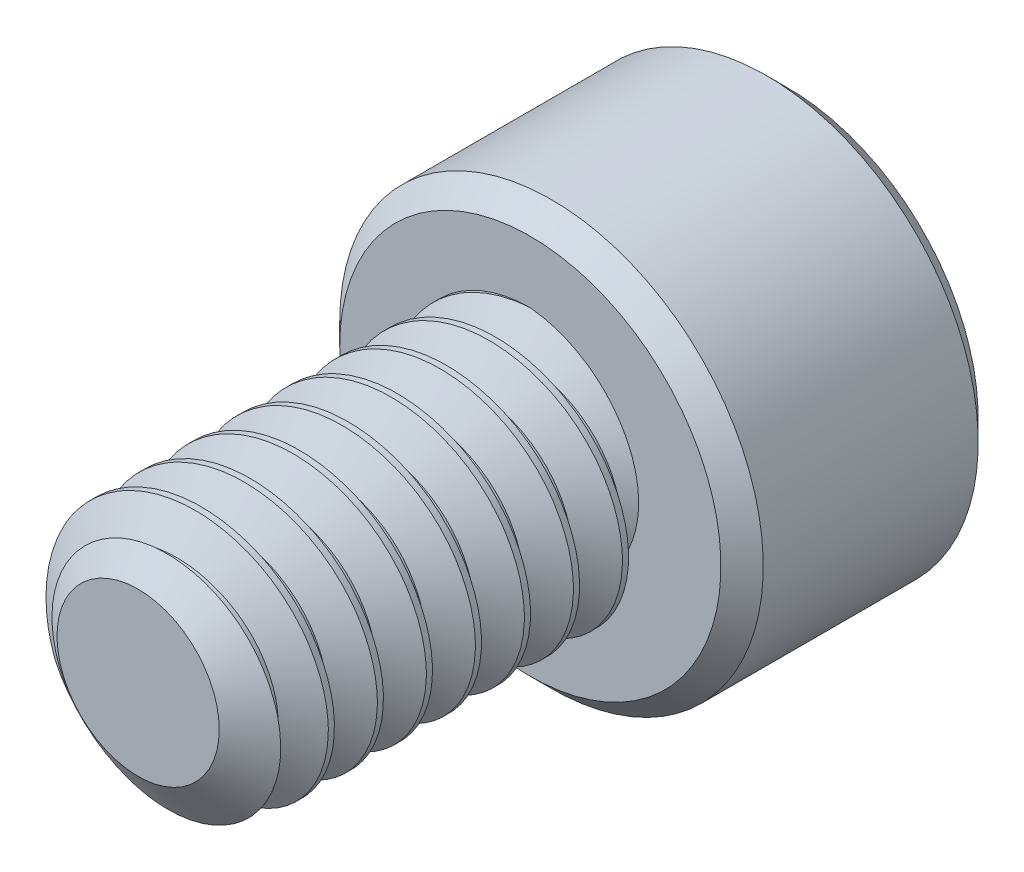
ISO-10303-21;
HEADER;
FILE_DESCRIPTION(('STEP AP214'),'2;1');
FILE_NAME('part.step','',(''),(''),'','','');
FILE_SCHEMA(('AUTOMOTIVE_DESIGN { 1 0 10303 214 1 1 1 1 }'));
ENDSEC;
DATA;
#1=APPLICATION_CONTEXT('core data for automotive mechanical design processes');
#2=APPLICATION_PROTOCOL_DEFINITION('international standard','automotive_design',2000,#1);
#3=PRODUCT_CONTEXT('',#1,'mechanical');
#4=PRODUCT('Part','Part','',(#3));
#5=PRODUCT_RELATED_PRODUCT_CATEGORY('part','',(#4));
#6=PRODUCT_DEFINITION_FORMATION('','',#4);
#7=PRODUCT_DEFINITION_CONTEXT('part definition',#1,'design');
#8=PRODUCT_DEFINITION('design','',#6,#7);
#9=PRODUCT_DEFINITION_SHAPE('','',#8);
#10=(LENGTH_UNIT() NAMED_UNIT(*) SI_UNIT(.MILLI.,.METRE.));
#11=(NAMED_UNIT(*) PLANE_ANGLE_UNIT() SI_UNIT($,.RADIAN.));
#12=(NAMED_UNIT(*) SI_UNIT($,.STERADIAN.) SOLID_ANGLE_UNIT());
#13=UNCERTAINTY_MEASURE_WITH_UNIT(LENGTH_MEASURE(1.E-05),#10,'distance_accuracy_value','');
#14=(GEOMETRIC_REPRESENTATION_CONTEXT(3) GLOBAL_UNCERTAINTY_ASSIGNED_CONTEXT((#13)) GLOBAL_UNIT_ASSIGNED_CONTEXT((#10,
#11,#12)) REPRESENTATION_CONTEXT('',''));
#15=CARTESIAN_POINT('',(0.,0.,0.));
#16=DIRECTION('',(0.,0.,1.));
#17=DIRECTION('',(1.,0.,0.));
#18=AXIS2_PLACEMENT_3D('',#15,#16,#17);
#19=CARTESIAN_POINT('',(0.,0.,-6.35));
#20=DIRECTION('',(0.,0.,1.));
#21=DIRECTION('',(1.,0.,0.));
#22=AXIS2_PLACEMENT_3D('',#19,#20,#21);
#23=CYLINDRICAL_SURFACE('',#22,2.0828);
#24=CARTESIAN_POINT('',(0.,2.0828,1.48828125));
#25=CARTESIAN_POINT('',(1.20250514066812,2.08280000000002,1.42213541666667));
#26=CARTESIAN_POINT('',(1.80375771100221,1.04140000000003,1.35598958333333));
#27=CARTESIAN_POINT('',(2.4050102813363,0.,1.28984375));
#28=CARTESIAN_POINT('',(1.80375771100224,-1.04139999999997,1.22369791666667));
#29=CARTESIAN_POINT('',(1.20250514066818,-2.08279999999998,1.15755208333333));
#30=CARTESIAN_POINT('',(0.,-2.0828,1.09140625));
#31=CARTESIAN_POINT('',(-1.20250514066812,-2.08280000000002,1.02526041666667));
#32=CARTESIAN_POINT('',(-1.80375771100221,-1.04140000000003,0.959114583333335));
#33=CARTESIAN_POINT('',(-2.4050102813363,0.,0.892968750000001));
#34=CARTESIAN_POINT('',(-1.80375771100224,1.04139999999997,0.826822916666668));
#35=CARTESIAN_POINT('',(-1.20250514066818,2.08279999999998,0.760677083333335));
#36=CARTESIAN_POINT('',(0.,2.0828,0.694531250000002));
#37=CARTESIAN_POINT('',(1.20250514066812,2.08280000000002,0.628385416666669));
#38=CARTESIAN_POINT('',(1.80375771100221,1.04140000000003,0.562239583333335));
#39=CARTESIAN_POINT('',(2.4050102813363,0.,0.496093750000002));
#40=CARTESIAN_POINT('',(1.80375771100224,-1.04139999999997,0.429947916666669));
#41=CARTESIAN_POINT('',(1.20250514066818,-2.08279999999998,0.363802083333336));
#42=CARTESIAN_POINT('',(0.,-2.0828,0.297656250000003));
#43=CARTESIAN_POINT('',(-1.20250514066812,-2.08280000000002,0.231510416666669));
#44=CARTESIAN_POINT('',(-1.80375771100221,-1.04140000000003,0.165364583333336));
#45=CARTESIAN_POINT('',(-2.4050102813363,0.,0.099218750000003));
#46=CARTESIAN_POINT('',(-1.80375771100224,1.04139999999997,0.0330729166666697));
#47=CARTESIAN_POINT('',(-1.20250514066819,2.08279999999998,-0.0330729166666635));
#48=CARTESIAN_POINT('',(0.,2.0828,-0.0992187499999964));
#49=CARTESIAN_POINT('',(1.20250514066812,2.08280000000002,-0.16536458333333));
#50=CARTESIAN_POINT('',(1.80375771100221,1.04140000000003,-0.231510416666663));
#51=CARTESIAN_POINT('',(2.4050102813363,0.,-0.297656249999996));
#52=CARTESIAN_POINT('',(1.80375771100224,-1.04139999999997,-0.363802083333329));
#53=CARTESIAN_POINT('',(1.20250514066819,-2.08279999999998,-0.429947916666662));
#54=CARTESIAN_POINT('',(0.,-2.0828,-0.496093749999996));
#55=CARTESIAN_POINT('',(-1.20250514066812,-2.08280000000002,-0.562239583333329));
#56=CARTESIAN_POINT('',(-1.80375771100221,-1.04140000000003,-0.628385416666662));
#57=CARTESIAN_POINT('',(-2.4050102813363,0.,-0.694531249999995));
#58=CARTESIAN_POINT('',(-1.80375771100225,1.04139999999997,-0.760677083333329));
#59=CARTESIAN_POINT('',(-1.20250514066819,2.08279999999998,-0.826822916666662));
#60=CARTESIAN_POINT('',(0.,2.0828,-0.892968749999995));
#61=CARTESIAN_POINT('',(1.20250514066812,2.08280000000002,-0.959114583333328));
#62=CARTESIAN_POINT('',(1.80375771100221,1.04140000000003,-1.02526041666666));
#63=CARTESIAN_POINT('',(2.4050102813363,0.,-1.09140624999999));
#64=CARTESIAN_POINT('',(1.80375771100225,-1.04139999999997,-1.15755208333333));
#65=CARTESIAN_POINT('',(1.20250514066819,-2.08279999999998,-1.22369791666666));
#66=CARTESIAN_POINT('',(0.,-2.0828,-1.28984374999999));
#67=CARTESIAN_POINT('',(-1.20250514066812,-2.08280000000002,-1.35598958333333));
#68=CARTESIAN_POINT('',(-1.80375771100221,-1.04140000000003,-1.42213541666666));
#69=CARTESIAN_POINT('',(-2.4050102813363,0.,-1.48828124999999));
#70=CARTESIAN_POINT('',(-1.80375771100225,1.04139999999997,-1.55442708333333));
#71=CARTESIAN_POINT('',(-1.20250514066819,2.08279999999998,-1.62057291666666));
#72=CARTESIAN_POINT('',(0.,2.0828,-1.68671874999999));
#73=CARTESIAN_POINT('',(1.20250514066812,2.08280000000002,-1.75286458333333));
#74=CARTESIAN_POINT('',(1.80375771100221,1.04140000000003,-1.81901041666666));
#75=CARTESIAN_POINT('',(2.4050102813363,0.,-1.88515624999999));
#76=CARTESIAN_POINT('',(1.80375771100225,-1.04139999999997,-1.95130208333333));
#77=CARTESIAN_POINT('',(1.20250514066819,-2.08279999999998,-2.01744791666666));
#78=CARTESIAN_POINT('',(0.,-2.0828,-2.08359374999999));
#79=CARTESIAN_POINT('',(-1.20250514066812,-2.08280000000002,-2.14973958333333));
#80=CARTESIAN_POINT('',(-1.80375771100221,-1.04140000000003,-2.21588541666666));
#81=CARTESIAN_POINT('',(-2.4050102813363,0.,-2.28203124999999));
#82=CARTESIAN_POINT('',(-1.80375771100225,1.04139999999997,-2.34817708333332));
#83=CARTESIAN_POINT('',(-1.20250514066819,2.08279999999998,-2.41432291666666));
#84=CARTESIAN_POINT('',(0.,2.0828,-2.48046874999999));
#85=CARTESIAN_POINT('',(1.20250514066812,2.08280000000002,-2.54661458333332));
#86=CARTESIAN_POINT('',(1.80375771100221,1.04140000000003,-2.61276041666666));
#87=CARTESIAN_POINT('',(2.4050102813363,0.,-2.67890624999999));
#88=CARTESIAN_POINT('',(1.80375771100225,-1.04139999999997,-2.74505208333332));
#89=CARTESIAN_POINT('',(1.20250514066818,-2.08279999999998,-2.81119791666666));
#90=CARTESIAN_POINT('',(0.,-2.0828,-2.87734374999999));
#91=CARTESIAN_POINT('',(-1.20250514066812,-2.08280000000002,-2.94348958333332));
#92=CARTESIAN_POINT('',(-1.80375771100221,-1.04140000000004,-3.00963541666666));
#93=CARTESIAN_POINT('',(-2.4050102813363,0.,-3.07578124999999));
#94=CARTESIAN_POINT('',(-1.80375771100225,1.04139999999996,-3.14192708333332));
#95=CARTESIAN_POINT('',(-1.20250514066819,2.08279999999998,-3.20807291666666));
#96=CARTESIAN_POINT('',(0.,2.0828,-3.27421874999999));
#97=CARTESIAN_POINT('',(1.20250514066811,2.08280000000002,-3.34036458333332));
#98=CARTESIAN_POINT('',(1.80375771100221,1.04140000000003,-3.40651041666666));
#99=CARTESIAN_POINT('',(2.4050102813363,0.,-3.47265624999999));
#100=CARTESIAN_POINT('',(1.80375771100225,-1.04139999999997,-3.53880208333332));
#101=CARTESIAN_POINT('',(1.20250514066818,-2.08279999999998,-3.60494791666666));
#102=CARTESIAN_POINT('',(0.,-2.0828,-3.67109374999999));
#103=CARTESIAN_POINT('',(-1.20250514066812,-2.08280000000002,-3.73723958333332));
#104=CARTESIAN_POINT('',(-1.80375771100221,-1.04140000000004,-3.80338541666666));
#105=CARTESIAN_POINT('',(-2.4050102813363,0.,-3.86953124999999));
#106=CARTESIAN_POINT('',(-1.80375771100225,1.04139999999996,-3.93567708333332));
#107=CARTESIAN_POINT('',(-1.20250514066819,2.08279999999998,-4.00182291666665));
#108=CARTESIAN_POINT('',(0.,2.0828,-4.06796874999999));
#109=CARTESIAN_POINT('',(1.20250514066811,2.08280000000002,-4.13411458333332));
#110=CARTESIAN_POINT('',(1.80375771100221,1.04140000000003,-4.20026041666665));
#111=CARTESIAN_POINT('',(2.4050102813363,0.,-4.26640624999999));
#112=CARTESIAN_POINT('',(1.80375771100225,-1.04139999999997,-4.33255208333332));
#113=CARTESIAN_POINT('',(1.2025051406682,-2.08279999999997,-4.39869791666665));
#114=CARTESIAN_POINT('',(0.,-2.0828,-4.46484374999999));
#115=CARTESIAN_POINT('',(-1.20250514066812,-2.08280000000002,-4.53098958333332));
#116=CARTESIAN_POINT('',(-1.80375771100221,-1.04140000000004,-4.59713541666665));
#117=CARTESIAN_POINT('',(-2.4050102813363,0.,-4.66328124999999));
#118=CARTESIAN_POINT('',(-1.80375771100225,1.04139999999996,-4.72942708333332));
#119=CARTESIAN_POINT('',(-1.20250514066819,2.08279999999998,-4.79557291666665));
#120=CARTESIAN_POINT('',(0.,2.0828,-4.86171874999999));
#121=CARTESIAN_POINT('',(1.20250514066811,2.08280000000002,-4.92786458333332));
#122=CARTESIAN_POINT('',(1.80375771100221,1.04140000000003,-4.99401041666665));
#123=CARTESIAN_POINT('',(2.4050102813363,0.,-5.06015624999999));
#124=CARTESIAN_POINT('',(1.80375771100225,-1.04139999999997,-5.12630208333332));
#125=CARTESIAN_POINT('',(1.2025051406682,-2.08279999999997,-5.19244791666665));
#126=CARTESIAN_POINT('',(0.,-2.0828,-5.25859374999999));
#127=CARTESIAN_POINT('',(-1.20250514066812,-2.08280000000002,-5.32473958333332));
#128=CARTESIAN_POINT('',(-1.80375771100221,-1.04140000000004,-5.39088541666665));
#129=CARTESIAN_POINT('',(-2.4050102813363,0.,-5.45703124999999));
#130=CARTESIAN_POINT('',(-1.80375771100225,1.04139999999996,-5.52317708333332));
#131=CARTESIAN_POINT('',(-1.20250514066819,2.08279999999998,-5.58932291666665));
#132=CARTESIAN_POINT('',(0.,2.0828,-5.65546874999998));
#133=CARTESIAN_POINT('',(1.20250514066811,2.08280000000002,-5.72161458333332));
#134=CARTESIAN_POINT('',(1.80375771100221,1.04140000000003,-5.78776041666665));
#135=CARTESIAN_POINT('',(2.4050102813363,0.,-5.85390624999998));
#136=CARTESIAN_POINT('',(1.80375771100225,-1.04139999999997,-5.92005208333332));
#137=CARTESIAN_POINT('',(1.2025051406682,-2.08279999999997,-5.98619791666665));
#138=CARTESIAN_POINT('',(0.,-2.0828,-6.05234374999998));
#139=CARTESIAN_POINT('',(-1.2025051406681,-2.08280000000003,-6.11848958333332));
#140=CARTESIAN_POINT('',(-1.80375771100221,-1.04140000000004,-6.18463541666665));
#141=CARTESIAN_POINT('',(-2.4050102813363,0.,-6.25078124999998));
#142=CARTESIAN_POINT('',(-1.80375771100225,1.04139999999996,-6.31692708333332));
#143=CARTESIAN_POINT('',(-1.20250514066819,2.08279999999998,-6.38307291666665));
#144=CARTESIAN_POINT('',(0.,2.0828,-6.44921874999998));
#145=CARTESIAN_POINT('',(1.20250514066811,2.08280000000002,-6.51536458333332));
#146=CARTESIAN_POINT('',(1.80375771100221,1.04140000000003,-6.58151041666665));
#147=CARTESIAN_POINT('',(2.4050102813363,0.,-6.64765624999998));
#148=CARTESIAN_POINT('',(1.80375771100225,-1.04139999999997,-6.71380208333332));
#149=CARTESIAN_POINT('',(1.20250514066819,-2.08279999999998,-6.77994791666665));
#150=CARTESIAN_POINT('',(0.,-2.0828,-6.84609374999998));
#151=CARTESIAN_POINT('',(-1.2025051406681,-2.08280000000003,-6.91223958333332));
#152=CARTESIAN_POINT('',(-1.80375771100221,-1.04140000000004,-6.97838541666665));
#153=CARTESIAN_POINT('',(-2.4050102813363,0.,-7.04453124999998));
#154=CARTESIAN_POINT('',(-1.80375771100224,1.04139999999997,-7.11067708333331));
#155=CARTESIAN_POINT('',(-1.20250514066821,2.08279999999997,-7.17682291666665));
#156=CARTESIAN_POINT('',(0.,2.0828,-7.24296874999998));
#157=(BOUNDED_CURVE() B_SPLINE_CURVE(2,(#24,#25,#26,#27,#28,#29,#30,#31,#32,#33,#34,#35,#36,#37,
#38,#39,#40,#41,#42,#43,#44,#45,#46,#47,#48,#49,#50,#51,#52,#53,#54,#55,#56,#57,#58,#59,#60,#61,
#62,#63,#64,#65,#66,#67,#68,#69,#70,#71,#72,#73,#74,#75,#76,#77,#78,#79,#80,#81,#82,#83,#84,#85,
#86,#87,#88,#89,#90,#91,#92,#93,#94,#95,#96,#97,#98,#99,#100,#101,#102,#103,#104,#105,#106,#107,
#108,#109,#110,#111,#112,#113,#114,#115,#116,#117,#118,#119,#120,#121,#122,#123,#124,#125,#126,
#127,#128,#129,#130,#131,#132,#133,#134,#135,#136,#137,#138,#139,#140,#141,#142,#143,#144,#145,
#146,#147,#148,#149,#150,#151,#152,#153,#154,#155,#156),.UNSPECIFIED.,.F.,
.F.) B_SPLINE_CURVE_WITH_KNOTS((3,2,2,2,2,2,2,2,2,2,2,2,2,2,2,2,2,2,2,2,2,2,2,2,2,2,2,2,2,2,2,2,
2,2,2,2,2,2,2,2,2,2,2,2,2,2,2,2,2,2,2,2,2,2,2,2,2,2,2,2,2,2,2,2,2,2,3),(0.,0.0151515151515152,
0.0303030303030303,0.0454545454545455,0.0606060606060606,0.0757575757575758,0.0909090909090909,
0.106060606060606,0.121212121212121,0.136363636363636,0.151515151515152,0.166666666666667,
0.181818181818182,0.196969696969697,0.212121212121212,0.227272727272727,0.242424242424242,
0.257575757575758,0.272727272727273,0.287878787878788,0.303030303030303,0.318181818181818,
0.333333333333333,0.348484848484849,0.363636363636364,0.378787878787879,0.393939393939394,
0.409090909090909,0.424242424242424,0.439393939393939,0.454545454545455,0.46969696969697,
0.484848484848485,0.5,0.515151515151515,0.53030303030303,0.545454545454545,0.560606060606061,
0.575757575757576,0.590909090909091,0.606060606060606,0.621212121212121,0.636363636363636,
0.651515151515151,0.666666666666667,0.681818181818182,0.696969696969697,0.712121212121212,
0.727272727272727,0.742424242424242,0.757575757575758,0.772727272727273,0.787878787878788,
0.803030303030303,0.818181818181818,0.833333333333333,0.848484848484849,0.863636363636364,
0.878787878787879,0.893939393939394,0.909090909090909,0.924242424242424,0.939393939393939,
0.954545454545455,0.96969696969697,0.984848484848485,1.),
.UNSPECIFIED.) CURVE() GEOMETRIC_REPRESENTATION_ITEM() RATIONAL_B_SPLINE_CURVE((1.,
0.866025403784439,1.,0.866025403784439,1.,0.866025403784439,1.,0.866025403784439,1.,
0.866025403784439,1.,0.866025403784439,1.,0.866025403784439,1.,0.866025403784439,1.,
0.866025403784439,1.,0.866025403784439,1.,0.866025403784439,1.,0.866025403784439,1.,
0.866025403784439,1.,0.866025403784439,1.,0.866025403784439,1.,0.866025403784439,1.,
0.866025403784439,1.,0.866025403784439,1.,0.866025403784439,1.,0.866025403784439,1.,
0.866025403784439,1.,0.866025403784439,1.,0.866025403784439,1.,0.866025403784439,1.,
0.866025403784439,1.,0.866025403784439,1.,0.866025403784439,1.,0.866025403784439,1.,
0.866025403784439,1.,0.866025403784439,1.,0.866025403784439,1.,0.866025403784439,1.,
0.866025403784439,1.,0.866025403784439,1.,0.866025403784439,1.,0.866025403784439,1.,
0.866025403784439,1.,0.866025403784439,1.,0.866025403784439,1.,0.866025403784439,1.,
0.866025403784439,1.,0.866025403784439,1.,0.866025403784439,1.,0.866025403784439,1.,
0.866025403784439,1.,0.866025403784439,1.,0.866025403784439,1.,0.866025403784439,1.,
0.866025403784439,1.,0.866025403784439,1.,0.866025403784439,1.,0.866025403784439,1.,
0.866025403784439,1.,0.866025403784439,1.,0.866025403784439,1.,0.866025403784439,1.,
0.866025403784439,1.,0.866025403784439,1.,0.866025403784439,1.,0.866025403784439,1.,
0.866025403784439,1.,0.866025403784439,1.,0.866025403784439,1.,0.866025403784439,1.,
0.866025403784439,1.,0.866025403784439,1.)) REPRESENTATION_ITEM(''));
#158=CARTESIAN_POINT('',(-0.706064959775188,-1.95947138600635,-0.538848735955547));
#159=VERTEX_POINT('',#158);
#160=CARTESIAN_POINT('',(-1.4592706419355,1.48613089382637,-6.35));
#161=VERTEX_POINT('',#160);
#162=EDGE_CURVE('E281',#159,#161,#157,.T.);
#163=ORIENTED_EDGE('',*,*,#162,.F.);
#164=CARTESIAN_POINT('',(0.,0.,-0.538848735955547));
#165=DIRECTION('',(0.,0.,1.));
#166=DIRECTION('',(1.,0.,0.));
#167=AXIS2_PLACEMENT_3D('',#164,#165,#166);
#168=CIRCLE('',#167,2.0828);
#169=CARTESIAN_POINT('',(-1.88355944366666,-0.888965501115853,-0.538848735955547));
#170=VERTEX_POINT('',#169);
#171=EDGE_CURVE('E274',#170,#159,#168,.T.);
#172=ORIENTED_EDGE('',*,*,#171,.F.);
#173=CARTESIAN_POINT('',(0.,2.0828,0.79375));
#174=CARTESIAN_POINT('',(1.20250514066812,2.08280000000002,0.727604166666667));
#175=CARTESIAN_POINT('',(1.80375771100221,1.04140000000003,0.661458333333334));
#176=CARTESIAN_POINT('',(2.4050102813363,0.,0.5953125));
#177=CARTESIAN_POINT('',(1.80375771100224,-1.04139999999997,0.529166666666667));
#178=CARTESIAN_POINT('',(1.20250514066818,-2.08279999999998,0.463020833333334));
#179=CARTESIAN_POINT('',(0.,-2.0828,0.396875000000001));
#180=CARTESIAN_POINT('',(-1.20250514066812,-2.08280000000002,0.330729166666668));
#181=CARTESIAN_POINT('',(-1.80375771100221,-1.04140000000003,0.264583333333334));
#182=CARTESIAN_POINT('',(-2.4050102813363,0.,0.198437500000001));
#183=CARTESIAN_POINT('',(-1.80375771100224,1.04139999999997,0.132291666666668));
#184=CARTESIAN_POINT('',(-1.20250514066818,2.08279999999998,0.0661458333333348));
#185=CARTESIAN_POINT('',(0.,2.0828,0.));
#186=CARTESIAN_POINT('',(1.20250514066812,2.08280000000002,-0.0661458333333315));
#187=CARTESIAN_POINT('',(1.80375771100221,1.04140000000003,-0.132291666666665));
#188=CARTESIAN_POINT('',(2.4050102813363,0.,-0.198437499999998));
#189=CARTESIAN_POINT('',(1.80375771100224,-1.04139999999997,-0.264583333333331));
#190=CARTESIAN_POINT('',(1.20250514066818,-2.08279999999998,-0.330729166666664));
#191=CARTESIAN_POINT('',(0.,-2.0828,-0.396874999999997));
#192=CARTESIAN_POINT('',(-1.20250514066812,-2.08280000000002,-0.463020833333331));
#193=CARTESIAN_POINT('',(-1.80375771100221,-1.04140000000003,-0.529166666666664));
#194=CARTESIAN_POINT('',(-2.4050102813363,0.,-0.595312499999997));
#195=CARTESIAN_POINT('',(-1.80375771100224,1.04139999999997,-0.66145833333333));
#196=CARTESIAN_POINT('',(-1.20250514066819,2.08279999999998,-0.727604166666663));
#197=CARTESIAN_POINT('',(0.,2.0828,-0.793749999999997));
#198=CARTESIAN_POINT('',(1.20250514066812,2.08280000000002,-0.85989583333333));
#199=CARTESIAN_POINT('',(1.80375771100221,1.04140000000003,-0.926041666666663));
#200=CARTESIAN_POINT('',(2.4050102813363,0.,-0.992187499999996));
#201=CARTESIAN_POINT('',(1.80375771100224,-1.04139999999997,-1.05833333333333));
#202=CARTESIAN_POINT('',(1.20250514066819,-2.08279999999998,-1.12447916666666));
#203=CARTESIAN_POINT('',(0.,-2.0828,-1.190625));
#204=CARTESIAN_POINT('',(-1.20250514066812,-2.08280000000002,-1.25677083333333));
#205=CARTESIAN_POINT('',(-1.80375771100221,-1.04140000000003,-1.32291666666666));
#206=CARTESIAN_POINT('',(-2.4050102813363,0.,-1.3890625));
#207=CARTESIAN_POINT('',(-1.80375771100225,1.04139999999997,-1.45520833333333));
#208=CARTESIAN_POINT('',(-1.20250514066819,2.08279999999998,-1.52135416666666));
#209=CARTESIAN_POINT('',(0.,2.0828,-1.5875));
#210=CARTESIAN_POINT('',(1.20250514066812,2.08280000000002,-1.65364583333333));
#211=CARTESIAN_POINT('',(1.80375771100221,1.04140000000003,-1.71979166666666));
#212=CARTESIAN_POINT('',(2.4050102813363,0.,-1.78593749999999));
#213=CARTESIAN_POINT('',(1.80375771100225,-1.04139999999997,-1.85208333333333));
#214=CARTESIAN_POINT('',(1.20250514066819,-2.08279999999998,-1.91822916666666));
#215=CARTESIAN_POINT('',(0.,-2.0828,-1.98437499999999));
#216=CARTESIAN_POINT('',(-1.20250514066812,-2.08280000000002,-2.05052083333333));
#217=CARTESIAN_POINT('',(-1.80375771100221,-1.04140000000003,-2.11666666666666));
#218=CARTESIAN_POINT('',(-2.4050102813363,0.,-2.18281249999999));
#219=CARTESIAN_POINT('',(-1.80375771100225,1.04139999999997,-2.24895833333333));
#220=CARTESIAN_POINT('',(-1.20250514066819,2.08279999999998,-2.31510416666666));
#221=CARTESIAN_POINT('',(0.,2.0828,-2.38124999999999));
#222=CARTESIAN_POINT('',(1.20250514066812,2.08280000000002,-2.44739583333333));
#223=CARTESIAN_POINT('',(1.80375771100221,1.04140000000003,-2.51354166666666));
#224=CARTESIAN_POINT('',(2.4050102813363,0.,-2.57968749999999));
#225=CARTESIAN_POINT('',(1.80375771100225,-1.04139999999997,-2.64583333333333));
#226=CARTESIAN_POINT('',(1.20250514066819,-2.08279999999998,-2.71197916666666));
#227=CARTESIAN_POINT('',(0.,-2.0828,-2.77812499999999));
#228=CARTESIAN_POINT('',(-1.20250514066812,-2.08280000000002,-2.84427083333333));
#229=CARTESIAN_POINT('',(-1.80375771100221,-1.04140000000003,-2.91041666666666));
#230=CARTESIAN_POINT('',(-2.4050102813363,0.,-2.97656249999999));
#231=CARTESIAN_POINT('',(-1.80375771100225,1.04139999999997,-3.04270833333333));
#232=CARTESIAN_POINT('',(-1.20250514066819,2.08279999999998,-3.10885416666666));
#233=CARTESIAN_POINT('',(0.,2.0828,-3.17499999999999));
#234=CARTESIAN_POINT('',(1.20250514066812,2.08280000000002,-3.24114583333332));
#235=CARTESIAN_POINT('',(1.80375771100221,1.04140000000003,-3.30729166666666));
#236=CARTESIAN_POINT('',(2.4050102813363,0.,-3.37343749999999));
#237=CARTESIAN_POINT('',(1.80375771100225,-1.04139999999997,-3.43958333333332));
#238=CARTESIAN_POINT('',(1.20250514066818,-2.08279999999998,-3.50572916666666));
#239=CARTESIAN_POINT('',(0.,-2.0828,-3.57187499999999));
#240=CARTESIAN_POINT('',(-1.20250514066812,-2.08280000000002,-3.63802083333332));
#241=CARTESIAN_POINT('',(-1.80375771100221,-1.04140000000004,-3.70416666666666));
#242=CARTESIAN_POINT('',(-2.4050102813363,0.,-3.77031249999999));
#243=CARTESIAN_POINT('',(-1.80375771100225,1.04139999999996,-3.83645833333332));
#244=CARTESIAN_POINT('',(-1.20250514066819,2.08279999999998,-3.90260416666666));
#245=CARTESIAN_POINT('',(0.,2.0828,-3.96874999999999));
#246=CARTESIAN_POINT('',(1.20250514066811,2.08280000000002,-4.03489583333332));
#247=CARTESIAN_POINT('',(1.80375771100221,1.04140000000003,-4.10104166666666));
#248=CARTESIAN_POINT('',(2.4050102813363,0.,-4.16718749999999));
#249=CARTESIAN_POINT('',(1.80375771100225,-1.04139999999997,-4.23333333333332));
#250=CARTESIAN_POINT('',(1.20250514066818,-2.08279999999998,-4.29947916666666));
#251=CARTESIAN_POINT('',(0.,-2.0828,-4.36562499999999));
#252=CARTESIAN_POINT('',(-1.20250514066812,-2.08280000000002,-4.43177083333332));
#253=CARTESIAN_POINT('',(-1.80375771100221,-1.04140000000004,-4.49791666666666));
#254=CARTESIAN_POINT('',(-2.4050102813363,0.,-4.56406249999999));
#255=CARTESIAN_POINT('',(-1.80375771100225,1.04139999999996,-4.63020833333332));
#256=CARTESIAN_POINT('',(-1.20250514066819,2.08279999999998,-4.69635416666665));
#257=CARTESIAN_POINT('',(0.,2.0828,-4.76249999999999));
#258=CARTESIAN_POINT('',(1.20250514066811,2.08280000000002,-4.82864583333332));
#259=CARTESIAN_POINT('',(1.80375771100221,1.04140000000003,-4.89479166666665));
#260=CARTESIAN_POINT('',(2.4050102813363,0.,-4.96093749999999));
#261=CARTESIAN_POINT('',(1.80375771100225,-1.04139999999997,-5.02708333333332));
#262=CARTESIAN_POINT('',(1.2025051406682,-2.08279999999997,-5.09322916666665));
#263=CARTESIAN_POINT('',(0.,-2.0828,-5.15937499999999));
#264=CARTESIAN_POINT('',(-1.20250514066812,-2.08280000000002,-5.22552083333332));
#265=CARTESIAN_POINT('',(-1.80375771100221,-1.04140000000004,-5.29166666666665));
#266=CARTESIAN_POINT('',(-2.4050102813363,0.,-5.35781249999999));
#267=CARTESIAN_POINT('',(-1.80375771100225,1.04139999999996,-5.42395833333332));
#268=CARTESIAN_POINT('',(-1.20250514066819,2.08279999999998,-5.49010416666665));
#269=CARTESIAN_POINT('',(0.,2.0828,-5.55624999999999));
#270=CARTESIAN_POINT('',(1.20250514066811,2.08280000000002,-5.62239583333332));
#271=CARTESIAN_POINT('',(1.80375771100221,1.04140000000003,-5.68854166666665));
#272=CARTESIAN_POINT('',(2.4050102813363,0.,-5.75468749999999));
#273=CARTESIAN_POINT('',(1.80375771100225,-1.04139999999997,-5.82083333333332));
#274=CARTESIAN_POINT('',(1.2025051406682,-2.08279999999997,-5.88697916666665));
#275=CARTESIAN_POINT('',(0.,-2.0828,-5.95312499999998));
#276=CARTESIAN_POINT('',(-1.20250514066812,-2.08280000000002,-6.01927083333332));
#277=CARTESIAN_POINT('',(-1.80375771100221,-1.04140000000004,-6.08541666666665));
#278=CARTESIAN_POINT('',(-2.4050102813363,0.,-6.15156249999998));
#279=CARTESIAN_POINT('',(-1.80375771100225,1.04139999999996,-6.21770833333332));
#280=CARTESIAN_POINT('',(-1.20250514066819,2.08279999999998,-6.28385416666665));
#281=CARTESIAN_POINT('',(0.,2.0828,-6.34999999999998));
#282=CARTESIAN_POINT('',(1.20250514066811,2.08280000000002,-6.41614583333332));
#283=CARTESIAN_POINT('',(1.80375771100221,1.04140000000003,-6.48229166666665));
#284=CARTESIAN_POINT('',(2.4050102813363,0.,-6.54843749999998));
#285=CARTESIAN_POINT('',(1.80375771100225,-1.04139999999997,-6.61458333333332));
#286=CARTESIAN_POINT('',(1.2025051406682,-2.08279999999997,-6.68072916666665));
#287=CARTESIAN_POINT('',(0.,-2.0828,-6.74687499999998));
#288=CARTESIAN_POINT('',(-1.2025051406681,-2.08280000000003,-6.81302083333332));
#289=CARTESIAN_POINT('',(-1.80375771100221,-1.04140000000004,-6.87916666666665));
#290=CARTESIAN_POINT('',(-2.4050102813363,0.,-6.94531249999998));
#291=CARTESIAN_POINT('',(-1.80375771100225,1.04139999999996,-7.01145833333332));
#292=CARTESIAN_POINT('',(-1.20250514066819,2.08279999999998,-7.07760416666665));
#293=CARTESIAN_POINT('',(0.,2.0828,-7.14374999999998));
#294=CARTESIAN_POINT('',(1.20250514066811,2.08280000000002,-7.20989583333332));
#295=CARTESIAN_POINT('',(1.80375771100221,1.04140000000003,-7.27604166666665));
#296=CARTESIAN_POINT('',(2.4050102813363,0.,-7.34218749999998));
#297=CARTESIAN_POINT('',(1.80375771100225,-1.04139999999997,-7.40833333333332));
#298=CARTESIAN_POINT('',(1.20250514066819,-2.08279999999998,-7.47447916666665));
#299=CARTESIAN_POINT('',(0.,-2.0828,-7.54062499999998));
#300=CARTESIAN_POINT('',(-1.2025051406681,-2.08280000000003,-7.60677083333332));
#301=CARTESIAN_POINT('',(-1.80375771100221,-1.04140000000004,-7.67291666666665));
#302=CARTESIAN_POINT('',(-2.4050102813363,0.,-7.73906249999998));
#303=CARTESIAN_POINT('',(-1.80375771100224,1.04139999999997,-7.80520833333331));
#304=CARTESIAN_POINT('',(-1.20250514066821,2.08279999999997,-7.87135416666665));
#305=CARTESIAN_POINT('',(0.,2.0828,-7.93749999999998));
#306=(BOUNDED_CURVE() B_SPLINE_CURVE(2,(#173,#174,#175,#176,#177,#178,#179,#180,#181,#182,#183,
#184,#185,#186,#187,#188,#189,#190,#191,#192,#193,#194,#195,#196,#197,#198,#199,#200,#201,#202,
#203,#204,#205,#206,#207,#208,#209,#210,#211,#212,#213,#214,#215,#216,#217,#218,#219,#220,#221,
#222,#223,#224,#225,#226,#227,#228,#229,#230,#231,#232,#233,#234,#235,#236,#237,#238,#239,#240,
#241,#242,#243,#244,#245,#246,#247,#248,#249,#250,#251,#252,#253,#254,#255,#256,#257,#258,#259,
#260,#261,#262,#263,#264,#265,#266,#267,#268,#269,#270,#271,#272,#273,#274,#275,#276,#277,#278,
#279,#280,#281,#282,#283,#284,#285,#286,#287,#288,#289,#290,#291,#292,#293,#294,#295,#296,#297,
#298,#299,#300,#301,#302,#303,#304,#305),.UNSPECIFIED.,.F.,.F.) B_SPLINE_CURVE_WITH_KNOTS((3,2,
2,2,2,2,2,2,2,2,2,2,2,2,2,2,2,2,2,2,2,2,2,2,2,2,2,2,2,2,2,2,2,2,2,2,2,2,2,2,2,2,2,2,2,2,2,2,2,2,
2,2,2,2,2,2,2,2,2,2,2,2,2,2,2,2,3),(0.,0.0151515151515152,0.0303030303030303,0.0454545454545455,
0.0606060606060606,0.0757575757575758,0.0909090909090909,0.106060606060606,0.121212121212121,
0.136363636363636,0.151515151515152,0.166666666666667,0.181818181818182,0.196969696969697,
0.212121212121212,0.227272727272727,0.242424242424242,0.257575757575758,0.272727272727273,
0.287878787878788,0.303030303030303,0.318181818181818,0.333333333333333,0.348484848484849,
0.363636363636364,0.378787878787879,0.393939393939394,0.409090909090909,0.424242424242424,
0.439393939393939,0.454545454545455,0.46969696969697,0.484848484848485,0.5,0.515151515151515,
0.53030303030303,0.545454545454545,0.560606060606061,0.575757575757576,0.590909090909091,
0.606060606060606,0.621212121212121,0.636363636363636,0.651515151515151,0.666666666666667,
0.681818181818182,0.696969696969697,0.712121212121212,0.727272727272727,0.742424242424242,
0.757575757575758,0.772727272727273,0.787878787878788,0.803030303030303,0.818181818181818,
0.833333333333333,0.848484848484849,0.863636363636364,0.878787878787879,0.893939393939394,
0.909090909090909,0.924242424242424,0.939393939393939,0.954545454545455,0.96969696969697,
0.984848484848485,1.),
.UNSPECIFIED.) CURVE() GEOMETRIC_REPRESENTATION_ITEM() RATIONAL_B_SPLINE_CURVE((1.,
0.866025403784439,1.,0.866025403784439,1.,0.866025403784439,1.,0.866025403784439,1.,
0.866025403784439,1.,0.866025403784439,1.,0.866025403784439,1.,0.866025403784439,1.,
0.866025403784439,1.,0.866025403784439,1.,0.866025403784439,1.,0.866025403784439,1.,
0.866025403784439,1.,0.866025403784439,1.,0.866025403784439,1.,0.866025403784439,1.,
0.866025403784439,1.,0.866025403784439,1.,0.866025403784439,1.,0.866025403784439,1.,
0.866025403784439,1.,0.866025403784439,1.,0.866025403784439,1.,0.866025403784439,1.,
0.866025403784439,1.,0.866025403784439,1.,0.866025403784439,1.,0.866025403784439,1.,
0.866025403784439,1.,0.866025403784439,1.,0.866025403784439,1.,0.866025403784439,1.,
0.866025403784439,1.,0.866025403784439,1.,0.866025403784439,1.,0.866025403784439,1.,
0.866025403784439,1.,0.866025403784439,1.,0.866025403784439,1.,0.866025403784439,1.,
0.866025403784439,1.,0.866025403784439,1.,0.866025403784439,1.,0.866025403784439,1.,
0.866025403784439,1.,0.866025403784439,1.,0.866025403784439,1.,0.866025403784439,1.,
0.866025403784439,1.,0.866025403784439,1.,0.866025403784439,1.,0.866025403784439,1.,
0.866025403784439,1.,0.866025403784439,1.,0.866025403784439,1.,0.866025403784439,1.,
0.866025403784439,1.,0.866025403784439,1.,0.866025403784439,1.,0.866025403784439,1.,
0.866025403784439,1.,0.866025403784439,1.,0.866025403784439,1.,0.866025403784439,1.,
0.866025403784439,1.,0.866025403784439,1.)) REPRESENTATION_ITEM(''));
#307=CARTESIAN_POINT('',(0.,2.0828,-6.34999999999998));
#308=VERTEX_POINT('',#307);
#309=EDGE_CURVE('E273',#170,#308,#306,.T.);
#310=ORIENTED_EDGE('',*,*,#309,.T.);
#311=CARTESIAN_POINT('',(0.,0.,-6.35));
#312=DIRECTION('',(0.,0.,1.));
#313=DIRECTION('',(1.,0.,0.));
#314=AXIS2_PLACEMENT_3D('',#311,#312,#313);
#315=CIRCLE('',#314,2.0828);
#316=EDGE_CURVE('E254',#308,#161,#315,.T.);
#317=ORIENTED_EDGE('',*,*,#316,.T.);
#318=EDGE_LOOP('',(#163,#172,#310,#317));
#319=FACE_BOUND('',#318,.T.);
#320=ADVANCED_FACE('F34',(#319),#23,.T.);
#321=CARTESIAN_POINT('',(0.,2.0828,1.48828125));
#322=CARTESIAN_POINT('',(1.20250514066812,2.08280000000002,1.42213541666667));
#323=CARTESIAN_POINT('',(1.80375771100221,1.04140000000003,1.35598958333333));
#324=CARTESIAN_POINT('',(2.4050102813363,0.,1.28984375));
#325=CARTESIAN_POINT('',(1.80375771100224,-1.04139999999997,1.22369791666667));
#326=CARTESIAN_POINT('',(1.20250514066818,-2.08279999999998,1.15755208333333));
#327=CARTESIAN_POINT('',(0.,-2.0828,1.09140625));
#328=CARTESIAN_POINT('',(-1.20250514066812,-2.08280000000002,1.02526041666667));
#329=CARTESIAN_POINT('',(-1.80375771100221,-1.04140000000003,0.959114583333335));
#330=CARTESIAN_POINT('',(-2.4050102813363,0.,0.892968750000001));
#331=CARTESIAN_POINT('',(-1.80375771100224,1.04139999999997,0.826822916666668));
#332=CARTESIAN_POINT('',(-1.20250514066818,2.08279999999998,0.760677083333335));
#333=CARTESIAN_POINT('',(0.,2.0828,0.694531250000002));
#334=CARTESIAN_POINT('',(1.20250514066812,2.08280000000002,0.628385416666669));
#335=CARTESIAN_POINT('',(1.80375771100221,1.04140000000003,0.562239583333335));
#336=CARTESIAN_POINT('',(2.4050102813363,0.,0.496093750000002));
#337=CARTESIAN_POINT('',(1.80375771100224,-1.04139999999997,0.429947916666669));
#338=CARTESIAN_POINT('',(1.20250514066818,-2.08279999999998,0.363802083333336));
#339=CARTESIAN_POINT('',(0.,-2.0828,0.297656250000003));
#340=CARTESIAN_POINT('',(-1.20250514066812,-2.08280000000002,0.231510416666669));
#341=CARTESIAN_POINT('',(-1.80375771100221,-1.04140000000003,0.165364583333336));
#342=CARTESIAN_POINT('',(-2.4050102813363,0.,0.099218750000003));
#343=CARTESIAN_POINT('',(-1.80375771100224,1.04139999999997,0.0330729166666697));
#344=CARTESIAN_POINT('',(-1.20250514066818,2.08279999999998,-0.0330729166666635));
#345=CARTESIAN_POINT('',(0.,2.0828,-0.0992187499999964));
#346=CARTESIAN_POINT('',(1.20250514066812,2.08280000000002,-0.16536458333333));
#347=CARTESIAN_POINT('',(1.80375771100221,1.04140000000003,-0.231510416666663));
#348=CARTESIAN_POINT('',(2.4050102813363,0.,-0.297656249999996));
#349=CARTESIAN_POINT('',(1.80375771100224,-1.04139999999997,-0.363802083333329));
#350=CARTESIAN_POINT('',(1.20250514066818,-2.08279999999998,-0.429947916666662));
#351=CARTESIAN_POINT('',(0.,-2.0828,-0.496093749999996));
#352=CARTESIAN_POINT('',(-1.20250514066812,-2.08280000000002,-0.562239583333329));
#353=CARTESIAN_POINT('',(-1.80375771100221,-1.04140000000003,-0.628385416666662));
#354=CARTESIAN_POINT('',(-2.4050102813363,0.,-0.694531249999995));
#355=CARTESIAN_POINT('',(-1.80375771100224,1.04139999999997,-0.760677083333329));
#356=CARTESIAN_POINT('',(-1.20250514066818,2.08279999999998,-0.826822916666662));
#357=CARTESIAN_POINT('',(0.,2.0828,-0.892968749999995));
#358=CARTESIAN_POINT('',(1.20250514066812,2.08280000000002,-0.959114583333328));
#359=CARTESIAN_POINT('',(1.80375771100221,1.04140000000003,-1.02526041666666));
#360=CARTESIAN_POINT('',(2.4050102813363,0.,-1.09140624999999));
#361=CARTESIAN_POINT('',(1.80375771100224,-1.04139999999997,-1.15755208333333));
#362=CARTESIAN_POINT('',(1.20250514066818,-2.08279999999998,-1.22369791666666));
#363=CARTESIAN_POINT('',(0.,-2.0828,-1.28984374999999));
#364=CARTESIAN_POINT('',(-1.20250514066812,-2.08280000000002,-1.35598958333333));
#365=CARTESIAN_POINT('',(-1.80375771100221,-1.04140000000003,-1.42213541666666));
#366=CARTESIAN_POINT('',(-2.4050102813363,0.,-1.48828124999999));
#367=CARTESIAN_POINT('',(-1.80375771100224,1.04139999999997,-1.55442708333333));
#368=CARTESIAN_POINT('',(-1.20250514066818,2.08279999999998,-1.62057291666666));
#369=CARTESIAN_POINT('',(0.,2.0828,-1.68671874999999));
#370=CARTESIAN_POINT('',(1.20250514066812,2.08280000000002,-1.75286458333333));
#371=CARTESIAN_POINT('',(1.80375771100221,1.04140000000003,-1.81901041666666));
#372=CARTESIAN_POINT('',(2.4050102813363,0.,-1.88515624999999));
#373=CARTESIAN_POINT('',(1.80375771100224,-1.04139999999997,-1.95130208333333));
#374=CARTESIAN_POINT('',(1.20250514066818,-2.08279999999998,-2.01744791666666));
#375=CARTESIAN_POINT('',(0.,-2.0828,-2.08359374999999));
#376=CARTESIAN_POINT('',(-1.20250514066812,-2.08280000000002,-2.14973958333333));
#377=CARTESIAN_POINT('',(-1.80375771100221,-1.04140000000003,-2.21588541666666));
#378=CARTESIAN_POINT('',(-2.4050102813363,0.,-2.28203124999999));
#379=CARTESIAN_POINT('',(-1.80375771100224,1.04139999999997,-2.34817708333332));
#380=CARTESIAN_POINT('',(-1.20250514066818,2.08279999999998,-2.41432291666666));
#381=CARTESIAN_POINT('',(0.,2.0828,-2.48046874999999));
#382=CARTESIAN_POINT('',(1.20250514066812,2.08280000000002,-2.54661458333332));
#383=CARTESIAN_POINT('',(1.80375771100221,1.04140000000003,-2.61276041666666));
#384=CARTESIAN_POINT('',(2.4050102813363,0.,-2.67890624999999));
#385=CARTESIAN_POINT('',(1.80375771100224,-1.04139999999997,-2.74505208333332));
#386=CARTESIAN_POINT('',(1.20250514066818,-2.08279999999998,-2.81119791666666));
#387=CARTESIAN_POINT('',(0.,-2.0828,-2.87734374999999));
#388=CARTESIAN_POINT('',(-1.20250514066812,-2.08280000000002,-2.94348958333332));
#389=CARTESIAN_POINT('',(-1.80375771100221,-1.04140000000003,-3.00963541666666));
#390=CARTESIAN_POINT('',(-2.4050102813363,0.,-3.07578124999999));
#391=CARTESIAN_POINT('',(-1.80375771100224,1.04139999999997,-3.14192708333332));
#392=CARTESIAN_POINT('',(-1.20250514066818,2.08279999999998,-3.20807291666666));
#393=CARTESIAN_POINT('',(0.,2.0828,-3.27421874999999));
#394=CARTESIAN_POINT('',(1.20250514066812,2.08280000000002,-3.34036458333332));
#395=CARTESIAN_POINT('',(1.80375771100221,1.04140000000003,-3.40651041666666));
#396=CARTESIAN_POINT('',(2.4050102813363,0.,-3.47265624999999));
#397=CARTESIAN_POINT('',(1.80375771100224,-1.04139999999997,-3.53880208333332));
#398=CARTESIAN_POINT('',(1.20250514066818,-2.08279999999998,-3.60494791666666));
#399=CARTESIAN_POINT('',(0.,-2.0828,-3.67109374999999));
#400=CARTESIAN_POINT('',(-1.20250514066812,-2.08280000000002,-3.73723958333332));
#401=CARTESIAN_POINT('',(-1.80375771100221,-1.04140000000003,-3.80338541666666));
#402=CARTESIAN_POINT('',(-2.4050102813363,0.,-3.86953124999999));
#403=CARTESIAN_POINT('',(-1.80375771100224,1.04139999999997,-3.93567708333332));
#404=CARTESIAN_POINT('',(-1.20250514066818,2.08279999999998,-4.00182291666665));
#405=CARTESIAN_POINT('',(0.,2.0828,-4.06796874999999));
#406=CARTESIAN_POINT('',(1.20250514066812,2.08280000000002,-4.13411458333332));
#407=CARTESIAN_POINT('',(1.80375771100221,1.04140000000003,-4.20026041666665));
#408=CARTESIAN_POINT('',(2.4050102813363,0.,-4.26640624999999));
#409=CARTESIAN_POINT('',(1.80375771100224,-1.04139999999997,-4.33255208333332));
#410=CARTESIAN_POINT('',(1.20250514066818,-2.08279999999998,-4.39869791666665));
#411=CARTESIAN_POINT('',(0.,-2.0828,-4.46484374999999));
#412=CARTESIAN_POINT('',(-1.20250514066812,-2.08280000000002,-4.53098958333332));
#413=CARTESIAN_POINT('',(-1.80375771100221,-1.04140000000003,-4.59713541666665));
#414=CARTESIAN_POINT('',(-2.4050102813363,0.,-4.66328124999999));
#415=CARTESIAN_POINT('',(-1.80375771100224,1.04139999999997,-4.72942708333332));
#416=CARTESIAN_POINT('',(-1.20250514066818,2.08279999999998,-4.79557291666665));
#417=CARTESIAN_POINT('',(0.,2.0828,-4.86171874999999));
#418=CARTESIAN_POINT('',(1.20250514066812,2.08280000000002,-4.92786458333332));
#419=CARTESIAN_POINT('',(1.80375771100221,1.04140000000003,-4.99401041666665));
#420=CARTESIAN_POINT('',(2.4050102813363,0.,-5.06015624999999));
#421=CARTESIAN_POINT('',(1.80375771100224,-1.04139999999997,-5.12630208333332));
#422=CARTESIAN_POINT('',(1.20250514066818,-2.08279999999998,-5.19244791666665));
#423=CARTESIAN_POINT('',(0.,-2.0828,-5.25859374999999));
#424=CARTESIAN_POINT('',(-1.20250514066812,-2.08280000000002,-5.32473958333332));
#425=CARTESIAN_POINT('',(-1.80375771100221,-1.04140000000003,-5.39088541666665));
#426=CARTESIAN_POINT('',(-2.4050102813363,0.,-5.45703124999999));
#427=CARTESIAN_POINT('',(-1.80375771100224,1.04139999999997,-5.52317708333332));
#428=CARTESIAN_POINT('',(-1.20250514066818,2.08279999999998,-5.58932291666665));
#429=CARTESIAN_POINT('',(0.,2.0828,-5.65546874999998));
#430=CARTESIAN_POINT('',(1.20250514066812,2.08280000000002,-5.72161458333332));
#431=CARTESIAN_POINT('',(1.80375771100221,1.04140000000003,-5.78776041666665));
#432=CARTESIAN_POINT('',(2.4050102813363,0.,-5.85390624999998));
#433=CARTESIAN_POINT('',(1.80375771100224,-1.04139999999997,-5.92005208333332));
#434=CARTESIAN_POINT('',(1.20250514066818,-2.08279999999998,-5.98619791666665));
#435=CARTESIAN_POINT('',(0.,-2.0828,-6.05234374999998));
#436=CARTESIAN_POINT('',(-1.20250514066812,-2.08280000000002,-6.11848958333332));
#437=CARTESIAN_POINT('',(-1.80375771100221,-1.04140000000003,-6.18463541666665));
#438=CARTESIAN_POINT('',(-2.4050102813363,0.,-6.25078124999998));
#439=CARTESIAN_POINT('',(-1.80375771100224,1.04139999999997,-6.31692708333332));
#440=CARTESIAN_POINT('',(-1.20250514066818,2.08279999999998,-6.38307291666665));
#441=CARTESIAN_POINT('',(0.,2.0828,-6.44921874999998));
#442=CARTESIAN_POINT('',(1.20250514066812,2.08280000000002,-6.51536458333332));
#443=CARTESIAN_POINT('',(1.80375771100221,1.04140000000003,-6.58151041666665));
#444=CARTESIAN_POINT('',(2.4050102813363,0.,-6.64765624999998));
#445=CARTESIAN_POINT('',(1.80375771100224,-1.04139999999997,-6.71380208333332));
#446=CARTESIAN_POINT('',(1.20250514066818,-2.08279999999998,-6.77994791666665));
#447=CARTESIAN_POINT('',(0.,-2.0828,-6.84609374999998));
#448=CARTESIAN_POINT('',(-1.20250514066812,-2.08280000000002,-6.91223958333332));
#449=CARTESIAN_POINT('',(-1.80375771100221,-1.04140000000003,-6.97838541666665));
#450=CARTESIAN_POINT('',(-2.4050102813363,0.,-7.04453124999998));
#451=CARTESIAN_POINT('',(-1.80375771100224,1.04139999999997,-7.11067708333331));
#452=CARTESIAN_POINT('',(-1.20250514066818,2.08279999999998,-7.17682291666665));
#453=CARTESIAN_POINT('',(0.,2.0828,-7.24296874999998));
#454=CARTESIAN_POINT('',(0.,1.56724425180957,1.190625));
#455=CARTESIAN_POINT('',(0.904848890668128,1.56724425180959,1.12447916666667));
#456=CARTESIAN_POINT('',(1.35727333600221,0.783622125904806,1.05833333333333));
#457=CARTESIAN_POINT('',(1.8096977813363,0.,0.9921875));
#458=CARTESIAN_POINT('',(1.35727333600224,-0.783622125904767,0.926041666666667));
#459=CARTESIAN_POINT('',(0.904848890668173,-1.56724425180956,0.859895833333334));
#460=CARTESIAN_POINT('',(0.,-1.56724425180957,0.793750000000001));
#461=CARTESIAN_POINT('',(-0.904848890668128,-1.56724425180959,0.727604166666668));
#462=CARTESIAN_POINT('',(-1.35727333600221,-0.783622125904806,0.661458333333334));
#463=CARTESIAN_POINT('',(-1.8096977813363,0.,0.595312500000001));
#464=CARTESIAN_POINT('',(-1.35727333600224,0.783622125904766,0.529166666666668));
#465=CARTESIAN_POINT('',(-0.904848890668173,1.56724425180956,0.463020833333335));
#466=CARTESIAN_POINT('',(0.,1.56724425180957,0.396875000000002));
#467=CARTESIAN_POINT('',(0.904848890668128,1.56724425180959,0.330729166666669));
#468=CARTESIAN_POINT('',(1.35727333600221,0.783622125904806,0.264583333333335));
#469=CARTESIAN_POINT('',(1.8096977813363,0.,0.198437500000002));
#470=CARTESIAN_POINT('',(1.35727333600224,-0.783622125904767,0.132291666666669));
#471=CARTESIAN_POINT('',(0.904848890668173,-1.56724425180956,0.0661458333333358));
#472=CARTESIAN_POINT('',(0.,-1.56724425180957,0.));
#473=CARTESIAN_POINT('',(-0.904848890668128,-1.56724425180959,-0.0661458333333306));
#474=CARTESIAN_POINT('',(-1.35727333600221,-0.783622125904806,-0.132291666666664));
#475=CARTESIAN_POINT('',(-1.8096977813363,0.,-0.198437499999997));
#476=CARTESIAN_POINT('',(-1.35727333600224,0.783622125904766,-0.26458333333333));
#477=CARTESIAN_POINT('',(-0.904848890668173,1.56724425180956,-0.330729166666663));
#478=CARTESIAN_POINT('',(0.,1.56724425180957,-0.396874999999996));
#479=CARTESIAN_POINT('',(0.904848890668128,1.56724425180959,-0.46302083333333));
#480=CARTESIAN_POINT('',(1.35727333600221,0.783622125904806,-0.529166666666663));
#481=CARTESIAN_POINT('',(1.8096977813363,0.,-0.595312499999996));
#482=CARTESIAN_POINT('',(1.35727333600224,-0.783622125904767,-0.661458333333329));
#483=CARTESIAN_POINT('',(0.904848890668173,-1.56724425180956,-0.727604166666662));
#484=CARTESIAN_POINT('',(0.,-1.56724425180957,-0.793749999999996));
#485=CARTESIAN_POINT('',(-0.904848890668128,-1.56724425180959,-0.859895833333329));
#486=CARTESIAN_POINT('',(-1.35727333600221,-0.783622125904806,-0.926041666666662));
#487=CARTESIAN_POINT('',(-1.8096977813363,0.,-0.992187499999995));
#488=CARTESIAN_POINT('',(-1.35727333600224,0.783622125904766,-1.05833333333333));
#489=CARTESIAN_POINT('',(-0.904848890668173,1.56724425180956,-1.12447916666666));
#490=CARTESIAN_POINT('',(0.,1.56724425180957,-1.19062499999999));
#491=CARTESIAN_POINT('',(0.904848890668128,1.56724425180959,-1.25677083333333));
#492=CARTESIAN_POINT('',(1.35727333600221,0.783622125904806,-1.32291666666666));
#493=CARTESIAN_POINT('',(1.8096977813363,0.,-1.38906249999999));
#494=CARTESIAN_POINT('',(1.35727333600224,-0.783622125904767,-1.45520833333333));
#495=CARTESIAN_POINT('',(0.904848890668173,-1.56724425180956,-1.52135416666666));
#496=CARTESIAN_POINT('',(0.,-1.56724425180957,-1.58749999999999));
#497=CARTESIAN_POINT('',(-0.904848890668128,-1.56724425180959,-1.65364583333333));
#498=CARTESIAN_POINT('',(-1.35727333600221,-0.783622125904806,-1.71979166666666));
#499=CARTESIAN_POINT('',(-1.8096977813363,0.,-1.78593749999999));
#500=CARTESIAN_POINT('',(-1.35727333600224,0.783622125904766,-1.85208333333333));
#501=CARTESIAN_POINT('',(-0.904848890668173,1.56724425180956,-1.91822916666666));
#502=CARTESIAN_POINT('',(0.,1.56724425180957,-1.98437499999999));
#503=CARTESIAN_POINT('',(0.904848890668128,1.56724425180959,-2.05052083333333));
#504=CARTESIAN_POINT('',(1.35727333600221,0.783622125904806,-2.11666666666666));
#505=CARTESIAN_POINT('',(1.8096977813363,0.,-2.18281249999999));
#506=CARTESIAN_POINT('',(1.35727333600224,-0.783622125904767,-2.24895833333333));
#507=CARTESIAN_POINT('',(0.904848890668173,-1.56724425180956,-2.31510416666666));
#508=CARTESIAN_POINT('',(0.,-1.56724425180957,-2.38124999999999));
#509=CARTESIAN_POINT('',(-0.904848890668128,-1.56724425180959,-2.44739583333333));
#510=CARTESIAN_POINT('',(-1.35727333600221,-0.783622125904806,-2.51354166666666));
#511=CARTESIAN_POINT('',(-1.8096977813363,0.,-2.57968749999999));
#512=CARTESIAN_POINT('',(-1.35727333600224,0.783622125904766,-2.64583333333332));
#513=CARTESIAN_POINT('',(-0.904848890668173,1.56724425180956,-2.71197916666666));
#514=CARTESIAN_POINT('',(0.,1.56724425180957,-2.77812499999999));
#515=CARTESIAN_POINT('',(0.904848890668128,1.56724425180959,-2.84427083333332));
#516=CARTESIAN_POINT('',(1.35727333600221,0.783622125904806,-2.91041666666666));
#517=CARTESIAN_POINT('',(1.8096977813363,0.,-2.97656249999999));
#518=CARTESIAN_POINT('',(1.35727333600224,-0.783622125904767,-3.04270833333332));
#519=CARTESIAN_POINT('',(0.904848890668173,-1.56724425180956,-3.10885416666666));
#520=CARTESIAN_POINT('',(0.,-1.56724425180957,-3.17499999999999));
#521=CARTESIAN_POINT('',(-0.904848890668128,-1.56724425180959,-3.24114583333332));
#522=CARTESIAN_POINT('',(-1.35727333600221,-0.783622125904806,-3.30729166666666));
#523=CARTESIAN_POINT('',(-1.8096977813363,0.,-3.37343749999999));
#524=CARTESIAN_POINT('',(-1.35727333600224,0.783622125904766,-3.43958333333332));
#525=CARTESIAN_POINT('',(-0.904848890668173,1.56724425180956,-3.50572916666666));
#526=CARTESIAN_POINT('',(0.,1.56724425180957,-3.57187499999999));
#527=CARTESIAN_POINT('',(0.904848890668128,1.56724425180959,-3.63802083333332));
#528=CARTESIAN_POINT('',(1.35727333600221,0.783622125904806,-3.70416666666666));
#529=CARTESIAN_POINT('',(1.8096977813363,0.,-3.77031249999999));
#530=CARTESIAN_POINT('',(1.35727333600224,-0.783622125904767,-3.83645833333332));
#531=CARTESIAN_POINT('',(0.904848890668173,-1.56724425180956,-3.90260416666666));
#532=CARTESIAN_POINT('',(0.,-1.56724425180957,-3.96874999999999));
#533=CARTESIAN_POINT('',(-0.904848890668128,-1.56724425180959,-4.03489583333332));
#534=CARTESIAN_POINT('',(-1.35727333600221,-0.783622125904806,-4.10104166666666));
#535=CARTESIAN_POINT('',(-1.8096977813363,0.,-4.16718749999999));
#536=CARTESIAN_POINT('',(-1.35727333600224,0.783622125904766,-4.23333333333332));
#537=CARTESIAN_POINT('',(-0.904848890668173,1.56724425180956,-4.29947916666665));
#538=CARTESIAN_POINT('',(0.,1.56724425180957,-4.36562499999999));
#539=CARTESIAN_POINT('',(0.904848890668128,1.56724425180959,-4.43177083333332));
#540=CARTESIAN_POINT('',(1.35727333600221,0.783622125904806,-4.49791666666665));
#541=CARTESIAN_POINT('',(1.8096977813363,0.,-4.56406249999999));
#542=CARTESIAN_POINT('',(1.35727333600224,-0.783622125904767,-4.63020833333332));
#543=CARTESIAN_POINT('',(0.904848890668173,-1.56724425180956,-4.69635416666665));
#544=CARTESIAN_POINT('',(0.,-1.56724425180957,-4.76249999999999));
#545=CARTESIAN_POINT('',(-0.904848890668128,-1.56724425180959,-4.82864583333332));
#546=CARTESIAN_POINT('',(-1.35727333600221,-0.783622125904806,-4.89479166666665));
#547=CARTESIAN_POINT('',(-1.8096977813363,0.,-4.96093749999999));
#548=CARTESIAN_POINT('',(-1.35727333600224,0.783622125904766,-5.02708333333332));
#549=CARTESIAN_POINT('',(-0.904848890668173,1.56724425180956,-5.09322916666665));
#550=CARTESIAN_POINT('',(0.,1.56724425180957,-5.15937499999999));
#551=CARTESIAN_POINT('',(0.904848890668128,1.56724425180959,-5.22552083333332));
#552=CARTESIAN_POINT('',(1.35727333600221,0.783622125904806,-5.29166666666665));
#553=CARTESIAN_POINT('',(1.8096977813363,0.,-5.35781249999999));
#554=CARTESIAN_POINT('',(1.35727333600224,-0.783622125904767,-5.42395833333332));
#555=CARTESIAN_POINT('',(0.904848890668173,-1.56724425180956,-5.49010416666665));
#556=CARTESIAN_POINT('',(0.,-1.56724425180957,-5.55624999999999));
#557=CARTESIAN_POINT('',(-0.904848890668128,-1.56724425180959,-5.62239583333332));
#558=CARTESIAN_POINT('',(-1.35727333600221,-0.783622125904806,-5.68854166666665));
#559=CARTESIAN_POINT('',(-1.8096977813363,0.,-5.75468749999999));
#560=CARTESIAN_POINT('',(-1.35727333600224,0.783622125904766,-5.82083333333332));
#561=CARTESIAN_POINT('',(-0.904848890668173,1.56724425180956,-5.88697916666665));
#562=CARTESIAN_POINT('',(0.,1.56724425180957,-5.95312499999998));
#563=CARTESIAN_POINT('',(0.904848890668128,1.56724425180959,-6.01927083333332));
#564=CARTESIAN_POINT('',(1.35727333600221,0.783622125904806,-6.08541666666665));
#565=CARTESIAN_POINT('',(1.8096977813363,0.,-6.15156249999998));
#566=CARTESIAN_POINT('',(1.35727333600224,-0.783622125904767,-6.21770833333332));
#567=CARTESIAN_POINT('',(0.904848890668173,-1.56724425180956,-6.28385416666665));
#568=CARTESIAN_POINT('',(0.,-1.56724425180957,-6.34999999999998));
#569=CARTESIAN_POINT('',(-0.904848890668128,-1.56724425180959,-6.41614583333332));
#570=CARTESIAN_POINT('',(-1.35727333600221,-0.783622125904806,-6.48229166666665));
#571=CARTESIAN_POINT('',(-1.8096977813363,0.,-6.54843749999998));
#572=CARTESIAN_POINT('',(-1.35727333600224,0.783622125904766,-6.61458333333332));
#573=CARTESIAN_POINT('',(-0.904848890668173,1.56724425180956,-6.68072916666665));
#574=CARTESIAN_POINT('',(0.,1.56724425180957,-6.74687499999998));
#575=CARTESIAN_POINT('',(0.904848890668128,1.56724425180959,-6.81302083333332));
#576=CARTESIAN_POINT('',(1.35727333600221,0.783622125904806,-6.87916666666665));
#577=CARTESIAN_POINT('',(1.8096977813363,0.,-6.94531249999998));
#578=CARTESIAN_POINT('',(1.35727333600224,-0.783622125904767,-7.01145833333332));
#579=CARTESIAN_POINT('',(0.904848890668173,-1.56724425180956,-7.07760416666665));
#580=CARTESIAN_POINT('',(0.,-1.56724425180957,-7.14374999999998));
#581=CARTESIAN_POINT('',(-0.904848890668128,-1.56724425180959,-7.20989583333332));
#582=CARTESIAN_POINT('',(-1.35727333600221,-0.783622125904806,-7.27604166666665));
#583=CARTESIAN_POINT('',(-1.8096977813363,0.,-7.34218749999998));
#584=CARTESIAN_POINT('',(-1.35727333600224,0.783622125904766,-7.40833333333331));
#585=CARTESIAN_POINT('',(-0.904848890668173,1.56724425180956,-7.47447916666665));
#586=CARTESIAN_POINT('',(0.,1.56724425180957,-7.54062499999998));
#587=(BOUNDED_SURFACE() B_SPLINE_SURFACE(1,2,((#321,#322,#323,#324,#325,#326,#327,#328,#329,
#330,#331,#332,#333,#334,#335,#336,#337,#338,#339,#340,#341,#342,#343,#344,#345,#346,#347,#348,
#349,#350,#351,#352,#353,#354,#355,#356,#357,#358,#359,#360,#361,#362,#363,#364,#365,#366,#367,
#368,#369,#370,#371,#372,#373,#374,#375,#376,#377,#378,#379,#380,#381,#382,#383,#384,#385,#386,
#387,#388,#389,#390,#391,#392,#393,#394,#395,#396,#397,#398,#399,#400,#401,#402,#403,#404,#405,
#406,#407,#408,#409,#410,#411,#412,#413,#414,#415,#416,#417,#418,#419,#420,#421,#422,#423,#424,
#425,#426,#427,#428,#429,#430,#431,#432,#433,#434,#435,#436,#437,#438,#439,#440,#441,#442,#443,
#444,#445,#446,#447,#448,#449,#450,#451,#452,#453),(#454,#455,#456,#457,#458,#459,#460,#461,
#462,#463,#464,#465,#466,#467,#468,#469,#470,#471,#472,#473,#474,#475,#476,#477,#478,#479,#480,
#481,#482,#483,#484,#485,#486,#487,#488,#489,#490,#491,#492,#493,#494,#495,#496,#497,#498,#499,
#500,#501,#502,#503,#504,#505,#506,#507,#508,#509,#510,#511,#512,#513,#514,#515,#516,#517,#518,
#519,#520,#521,#522,#523,#524,#525,#526,#527,#528,#529,#530,#531,#532,#533,#534,#535,#536,#537,
#538,#539,#540,#541,#542,#543,#544,#545,#546,#547,#548,#549,#550,#551,#552,#553,#554,#555,#556,
#557,#558,#559,#560,#561,#562,#563,#564,#565,#566,#567,#568,#569,#570,#571,#572,#573,#574,#575,
#576,#577,#578,#579,#580,#581,#582,#583,#584,#585,#586)),.UNSPECIFIED.,.F.,.F.,
.F.) B_SPLINE_SURFACE_WITH_KNOTS((2,2),(3,2,2,2,2,2,2,2,2,2,2,2,2,2,2,2,2,2,2,2,2,2,2,2,2,2,2,2,
2,2,2,2,2,2,2,2,2,2,2,2,2,2,2,2,2,2,2,2,2,2,2,2,2,2,2,2,2,2,2,2,2,2,2,2,2,2,3),(0.,1.),(0.,
0.0151515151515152,0.0303030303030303,0.0454545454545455,0.0606060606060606,0.0757575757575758,
0.0909090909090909,0.106060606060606,0.121212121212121,0.136363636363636,0.151515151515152,
0.166666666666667,0.181818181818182,0.196969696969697,0.212121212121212,0.227272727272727,
0.242424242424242,0.257575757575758,0.272727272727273,0.287878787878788,0.303030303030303,
0.318181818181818,0.333333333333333,0.348484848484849,0.363636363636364,0.378787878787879,
0.393939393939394,0.409090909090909,0.424242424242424,0.439393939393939,0.454545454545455,
0.46969696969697,0.484848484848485,0.5,0.515151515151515,0.53030303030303,0.545454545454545,
0.560606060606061,0.575757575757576,0.590909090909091,0.606060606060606,0.621212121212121,
0.636363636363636,0.651515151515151,0.666666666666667,0.681818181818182,0.696969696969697,
0.712121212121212,0.727272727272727,0.742424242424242,0.757575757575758,0.772727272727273,
0.787878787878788,0.803030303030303,0.818181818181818,0.833333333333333,0.848484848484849,
0.863636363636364,0.878787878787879,0.893939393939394,0.909090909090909,0.924242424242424,
0.939393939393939,0.954545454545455,0.96969696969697,0.984848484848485,1.),
.UNSPECIFIED.) GEOMETRIC_REPRESENTATION_ITEM() RATIONAL_B_SPLINE_SURFACE(((1.,0.866025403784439,
1.,0.866025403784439,1.,0.866025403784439,1.,0.866025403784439,1.,0.866025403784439,1.,
0.866025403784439,1.,0.866025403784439,1.,0.866025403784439,1.,0.866025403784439,1.,
0.866025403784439,1.,0.866025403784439,1.,0.866025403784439,1.,0.866025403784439,1.,
0.866025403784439,1.,0.866025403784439,1.,0.866025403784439,1.,0.866025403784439,1.,
0.866025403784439,1.,0.866025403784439,1.,0.866025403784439,1.,0.866025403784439,1.,
0.866025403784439,1.,0.866025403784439,1.,0.866025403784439,1.,0.866025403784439,1.,
0.866025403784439,1.,0.866025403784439,1.,0.866025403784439,1.,0.866025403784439,1.,
0.866025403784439,1.,0.866025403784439,1.,0.866025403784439,1.,0.866025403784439,1.,
0.866025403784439,1.,0.866025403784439,1.,0.866025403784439,1.,0.866025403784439,1.,
0.866025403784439,1.,0.866025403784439,1.,0.866025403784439,1.,0.866025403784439,1.,
0.866025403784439,1.,0.866025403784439,1.,0.866025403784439,1.,0.866025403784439,1.,
0.866025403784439,1.,0.866025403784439,1.,0.866025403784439,1.,0.866025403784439,1.,
0.866025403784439,1.,0.866025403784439,1.,0.866025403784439,1.,0.866025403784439,1.,
0.866025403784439,1.,0.866025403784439,1.,0.866025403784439,1.,0.866025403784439,1.,
0.866025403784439,1.,0.866025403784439,1.,0.866025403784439,1.,0.866025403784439,1.,
0.866025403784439,1.,0.866025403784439,1.,0.866025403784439,1.,0.866025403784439,1.,
0.866025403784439,1.),(1.,0.866025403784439,1.,0.866025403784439,1.,0.866025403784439,1.,
0.866025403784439,1.,0.866025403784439,1.,0.866025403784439,1.,0.866025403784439,1.,
0.866025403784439,1.,0.866025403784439,1.,0.866025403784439,1.,0.866025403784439,1.,
0.866025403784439,1.,0.866025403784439,1.,0.866025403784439,1.,0.866025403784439,1.,
0.866025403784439,1.,0.866025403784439,1.,0.866025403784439,1.,0.866025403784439,1.,
0.866025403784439,1.,0.866025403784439,1.,0.866025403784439,1.,0.866025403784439,1.,
0.866025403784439,1.,0.866025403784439,1.,0.866025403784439,1.,0.866025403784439,1.,
0.866025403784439,1.,0.866025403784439,1.,0.866025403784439,1.,0.866025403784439,1.,
0.866025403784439,1.,0.866025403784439,1.,0.866025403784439,1.,0.866025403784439,1.,
0.866025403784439,1.,0.866025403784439,1.,0.866025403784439,1.,0.866025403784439,1.,
0.866025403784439,1.,0.866025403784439,1.,0.866025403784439,1.,0.866025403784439,1.,
0.866025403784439,1.,0.866025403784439,1.,0.866025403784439,1.,0.866025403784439,1.,
0.866025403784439,1.,0.866025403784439,1.,0.866025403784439,1.,0.866025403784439,1.,
0.866025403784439,1.,0.866025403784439,1.,0.866025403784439,1.,0.866025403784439,1.,
0.866025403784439,1.,0.866025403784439,1.,0.866025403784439,1.,0.866025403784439,1.,
0.866025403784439,1.,0.866025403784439,1.,0.866025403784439,1.,0.866025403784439,1.,
0.866025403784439,1.,0.866025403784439,1.,0.866025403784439,1.))) REPRESENTATION_ITEM('') SURFACE());
#588=CARTESIAN_POINT('',(-0.706064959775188,-1.95947138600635,-0.538848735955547));
#589=CARTESIAN_POINT('',(-0.652167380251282,-1.9759701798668,-0.536919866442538));
#590=CARTESIAN_POINT('',(-0.597602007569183,-1.99028720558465,-0.535000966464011));
#591=CARTESIAN_POINT('',(-0.487497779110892,-2.01448801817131,-0.531196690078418));
#592=CARTESIAN_POINT('',(-0.431958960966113,-2.02437197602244,-0.5293113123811));
#593=CARTESIAN_POINT('',(-0.320190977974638,-2.0396484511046,-0.525585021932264));
#594=CARTESIAN_POINT('',(-0.263960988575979,-2.04503493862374,-0.523744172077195));
#595=CARTESIAN_POINT('',(-0.151236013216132,-2.05125887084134,-0.520120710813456));
#596=CARTESIAN_POINT('',(-0.0947409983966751,-2.05209580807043,-0.518338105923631));
#597=CARTESIAN_POINT('',(-0.00871933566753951,-2.04990721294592,-0.515680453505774));
#598=CARTESIAN_POINT('',(0.0208563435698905,-2.04852915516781,-0.514776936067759));
#599=CARTESIAN_POINT('',(0.0799154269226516,-2.04445227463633,-0.512940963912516));
#600=CARTESIAN_POINT('',(0.109398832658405,-2.04175347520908,-0.512008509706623));
#601=CARTESIAN_POINT('',(0.197606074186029,-2.03169799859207,-0.509180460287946));
#602=CARTESIAN_POINT('',(0.256116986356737,-2.02238149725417,-0.507253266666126));
#603=CARTESIAN_POINT('',(0.371993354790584,-1.99860216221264,-0.503326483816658));
#604=CARTESIAN_POINT('',(0.429360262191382,-1.98414635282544,-0.501326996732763));
#605=CARTESIAN_POINT('',(0.542631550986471,-1.95019330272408,-0.497266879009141));
#606=CARTESIAN_POINT('',(0.598534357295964,-1.93069085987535,-0.495206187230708));
#607=CARTESIAN_POINT('',(0.757992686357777,-1.8669593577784,-0.489157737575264));
#608=CARTESIAN_POINT('',(0.859051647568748,-1.81629348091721,-0.485108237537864));
#609=CARTESIAN_POINT('',(1.05115590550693,-1.69864282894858,-0.476956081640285));
#610=CARTESIAN_POINT('',(1.14220249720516,-1.6316601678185,-0.472853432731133));
#611=CARTESIAN_POINT('',(1.26916332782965,-1.52057460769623,-0.466755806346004));
#612=CARTESIAN_POINT('',(1.30985139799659,-1.48181515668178,-0.464734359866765));
#613=CARTESIAN_POINT('',(1.38778109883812,-1.40105072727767,-0.460725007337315));
#614=CARTESIAN_POINT('',(1.42502591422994,-1.35904881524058,-0.458737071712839));
#615=CARTESIAN_POINT('',(1.5312657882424,-1.22849601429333,-0.452837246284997));
#616=CARTESIAN_POINT('',(1.5948090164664,-1.13536061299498,-0.448987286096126));
#617=CARTESIAN_POINT('',(1.67773618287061,-0.988697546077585,-0.443461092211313));
#618=CARTESIAN_POINT('',(1.70334451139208,-0.938565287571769,-0.441657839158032));
#619=CARTESIAN_POINT('',(1.74997729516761,-0.836197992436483,-0.437938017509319));
#620=CARTESIAN_POINT('',(1.77100240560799,-0.783963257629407,-0.43602146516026));
#621=CARTESIAN_POINT('',(1.80831424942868,-0.677856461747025,-0.432117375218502));
#622=CARTESIAN_POINT('',(1.82460277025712,-0.623985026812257,-0.430129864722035));
#623=CARTESIAN_POINT('',(1.85231981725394,-0.515018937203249,-0.426090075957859));
#624=CARTESIAN_POINT('',(1.86374806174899,-0.459924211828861,-0.424037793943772));
#625=CARTESIAN_POINT('',(1.88973514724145,-0.298721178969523,-0.418005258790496));
#626=CARTESIAN_POINT('',(1.89779618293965,-0.191489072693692,-0.413958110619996));
#627=CARTESIAN_POINT('',(1.89567226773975,0.0227400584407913,-0.405796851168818));
#628=CARTESIAN_POINT('',(1.88548428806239,0.129737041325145,-0.401682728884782));
#629=CARTESIAN_POINT('',(1.84726090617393,0.33984839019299,-0.393527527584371));
#630=CARTESIAN_POINT('',(1.81934217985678,0.442983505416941,-0.389486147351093));
#631=CARTESIAN_POINT('',(1.76482437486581,0.592977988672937,-0.383555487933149));
#632=CARTESIAN_POINT('',(1.7445305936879,0.642217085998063,-0.381599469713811));
#633=CARTESIAN_POINT('',(1.69986341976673,0.73881557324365,-0.377744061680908));
#634=CARTESIAN_POINT('',(1.67549137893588,0.786175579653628,-0.375844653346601));
#635=CARTESIAN_POINT('',(1.63598452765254,0.855593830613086,-0.373050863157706));
#636=CARTESIAN_POINT('',(1.62230410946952,0.878492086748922,-0.372127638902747));
#637=CARTESIAN_POINT('',(1.5939855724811,0.923683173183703,-0.37029723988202));
#638=CARTESIAN_POINT('',(1.57934766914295,0.945976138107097,-0.369390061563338));
#639=CARTESIAN_POINT('',(1.53395359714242,1.0118306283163,-0.366625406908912));
#640=CARTESIAN_POINT('',(1.50171085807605,1.05437875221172,-0.364724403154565));
#641=CARTESIAN_POINT('',(1.43357995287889,1.13640537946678,-0.360847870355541));
#642=CARTESIAN_POINT('',(1.39769347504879,1.17588528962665,-0.358872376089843));
#643=CARTESIAN_POINT('',(1.32254972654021,1.25147759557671,-0.35485299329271));
#644=CARTESIAN_POINT('',(1.28329225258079,1.28758978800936,-0.352809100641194));
#645=CARTESIAN_POINT('',(1.16474003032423,1.38721520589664,-0.346792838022));
#646=CARTESIAN_POINT('',(1.08135040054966,1.44596671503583,-0.342748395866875));
#647=CARTESIAN_POINT('',(0.905855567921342,1.54844241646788,-0.334577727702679));
#648=CARTESIAN_POINT('',(0.813748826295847,1.59216394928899,-0.330451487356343));
#649=CARTESIAN_POINT('',(0.624337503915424,1.66299780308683,-0.322272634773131));
#650=CARTESIAN_POINT('',(0.52709412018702,1.69027186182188,-0.31821969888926));
#651=CARTESIAN_POINT('',(0.378929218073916,1.7186396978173,-0.312259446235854));
#652=CARTESIAN_POINT('',(0.329129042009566,1.72600570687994,-0.310291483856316));
#653=CARTESIAN_POINT('',(0.229077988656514,1.73651840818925,-0.306410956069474));
#654=CARTESIAN_POINT('',(0.178827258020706,1.73966642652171,-0.304498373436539));
#655=CARTESIAN_POINT('',(0.103343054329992,1.7411995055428,-0.30167554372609));
#656=CARTESIAN_POINT('',(0.0781313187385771,1.74117696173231,-0.300741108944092));
#657=CARTESIAN_POINT('',(0.0277346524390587,1.74007827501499,-0.298899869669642));
#658=CARTESIAN_POINT('',(0.00254971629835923,1.73900241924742,-0.297993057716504));
#659=CARTESIAN_POINT('',(-0.0728859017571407,1.73409014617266,-0.295240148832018));
#660=CARTESIAN_POINT('',(-0.123028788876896,1.72856929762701,-0.293361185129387));
#661=CARTESIAN_POINT('',(-0.27234076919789,1.70528848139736,-0.287596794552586));
#662=CARTESIAN_POINT('',(-0.370542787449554,1.68081379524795,-0.283578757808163));
#663=CARTESIAN_POINT('',(-0.556518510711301,1.61628714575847,-0.275511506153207));
#664=CARTESIAN_POINT('',(-0.644564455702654,1.57700786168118,-0.27147232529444));
#665=CARTESIAN_POINT('',(-0.81270527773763,1.48402585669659,-0.263295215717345));
#666=CARTESIAN_POINT('',(-0.892798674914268,1.43032045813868,-0.259157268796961));
#667=CARTESIAN_POINT('',(-1.04165700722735,1.31083682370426,-0.250955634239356));
#668=CARTESIAN_POINT('',(-1.1105620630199,1.24523399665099,-0.24689170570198));
#669=CARTESIAN_POINT('',(-1.20487771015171,1.13892495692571,-0.240908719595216));
#670=CARTESIAN_POINT('',(-1.23482043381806,1.10215325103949,-0.23893236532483));
#671=CARTESIAN_POINT('',(-1.29149893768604,1.02621348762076,-0.235023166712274));
#672=CARTESIAN_POINT('',(-1.31823437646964,0.98704517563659,-0.233090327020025));
#673=CARTESIAN_POINT('',(-1.3934643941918,0.866249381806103,-0.227424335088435));
#674=CARTESIAN_POINT('',(-1.4369378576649,0.781381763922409,-0.223826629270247));
#675=CARTESIAN_POINT('',(-1.50787456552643,0.605237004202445,-0.216219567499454));
#676=CARTESIAN_POINT('',(-1.53534136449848,0.51396129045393,-0.212210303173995));
#677=CARTESIAN_POINT('',(-1.57264812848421,0.332222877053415,-0.204154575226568));
#678=CARTESIAN_POINT('',(-1.58322841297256,0.241909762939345,-0.200117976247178));
#679=CARTESIAN_POINT('',(-1.58874619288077,0.0608801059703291,-0.191931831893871));
#680=CARTESIAN_POINT('',(-1.58370951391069,-0.0298355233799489,-0.187782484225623));
#681=CARTESIAN_POINT('',(-1.56801674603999,-0.140235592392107,-0.18267626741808));
#682=CARTESIAN_POINT('',(-1.56462281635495,-0.161089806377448,-0.181709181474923));
#683=CARTESIAN_POINT('',(-1.5570074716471,-0.202612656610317,-0.179778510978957));
#684=CARTESIAN_POINT('',(-1.55278737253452,-0.223281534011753,-0.178814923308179));
#685=CARTESIAN_POINT('',(-1.54815506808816,-0.243865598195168,-0.177852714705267));
#686=B_SPLINE_CURVE_WITH_KNOTS('',3,(#588,#589,#590,#591,#592,#593,#594,#595,#596,#597,#598,
#599,#600,#601,#602,#603,#604,#605,#606,#607,#608,#609,#610,#611,#612,#613,#614,#615,#616,#617,
#618,#619,#620,#621,#622,#623,#624,#625,#626,#627,#628,#629,#630,#631,#632,#633,#634,#635,#636,
#637,#638,#639,#640,#641,#642,#643,#644,#645,#646,#647,#648,#649,#650,#651,#652,#653,#654,#655,
#656,#657,#658,#659,#660,#661,#662,#663,#664,#665,#666,#667,#668,#669,#670,#671,#672,#673,#674,
#675,#676,#677,#678,#679,#680,#681,#682,#683,#684,#685),.UNSPECIFIED.,.F.,.F.,(4,2,2,2,2,2,2,2,
2,2,2,2,2,2,2,2,2,2,2,2,2,2,2,2,2,2,2,2,2,2,2,2,2,2,2,2,2,2,2,2,2,2,2,2,2,2,2,2,4),(0.,
0.169152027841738,0.338297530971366,0.50766944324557,0.677060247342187,0.765900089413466,
0.85473836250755,1.03232500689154,1.20966985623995,1.38719824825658,1.72484578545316,
2.0624496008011,2.23096356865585,2.39932008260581,2.73586459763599,2.90467007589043,
3.07345140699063,3.24216896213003,3.41089629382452,3.73204260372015,4.05324221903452,
4.37234979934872,4.53207836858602,4.69175409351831,4.77180344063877,4.85183483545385,
5.01185984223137,5.17181103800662,5.33177188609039,5.63642505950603,5.94113211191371,
6.2427917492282,6.3937910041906,6.54474277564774,6.62041248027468,6.69606156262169,
6.84732564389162,7.14941105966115,7.43752710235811,7.72569665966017,8.00991976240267,
8.15215633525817,8.29440803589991,8.579112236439,8.86375318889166,9.13553396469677,
9.4068655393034,9.47030851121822,9.5336512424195),.UNSPECIFIED.);
#687=CARTESIAN_POINT('',(-1.54815506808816,-0.243865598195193,-0.177852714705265));
#688=VERTEX_POINT('',#687);
#689=EDGE_CURVE('E263',#159,#688,#686,.T.);
#690=CARTESIAN_POINT('',(0.,-1.56724425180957,-6.34999999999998));
#691=CARTESIAN_POINT('',(-0.0466117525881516,-1.57314604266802,-6.34999999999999));
#692=CARTESIAN_POINT('',(-0.0934503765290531,-1.57708114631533,-6.35));
#693=CARTESIAN_POINT('',(-0.187291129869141,-1.58099567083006,-6.35));
#694=CARTESIAN_POINT('',(-0.234293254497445,-1.58097520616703,-6.35));
#695=CARTESIAN_POINT('',(-0.375000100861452,-1.57495220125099,-6.35));
#696=CARTESIAN_POINT('',(-0.468519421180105,-1.56300241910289,-6.35));
#697=CARTESIAN_POINT('',(-0.652126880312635,-1.52354375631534,-6.35));
#698=CARTESIAN_POINT('',(-0.742216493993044,-1.49604164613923,-6.35));
#699=CARTESIAN_POINT('',(-0.916454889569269,-1.4263047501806,-6.35));
#700=CARTESIAN_POINT('',(-1.00060613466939,-1.38407611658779,-6.35));
#701=CARTESIAN_POINT('',(-1.16057872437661,-1.28611022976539,-6.35));
#702=CARTESIAN_POINT('',(-1.23640838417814,-1.23038664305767,-6.35));
#703=CARTESIAN_POINT('',(-1.34230254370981,-1.13796103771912,-6.35));
#704=CARTESIAN_POINT('',(-1.37630694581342,-1.10566113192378,-6.35));
#705=CARTESIAN_POINT('',(-1.44150433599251,-1.03832029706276,-6.35));
#706=CARTESIAN_POINT('',(-1.47269762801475,-1.00327966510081,-6.35));
#707=CARTESIAN_POINT('',(-1.51719667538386,-0.948852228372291,-6.35));
#708=CARTESIAN_POINT('',(-1.53165214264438,-0.930392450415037,-6.35));
#709=CARTESIAN_POINT('',(-1.55979414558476,-0.892895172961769,-6.35));
#710=CARTESIAN_POINT('',(-1.5734806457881,-0.87385764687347,-6.35));
#711=CARTESIAN_POINT('',(-1.61349086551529,-0.81601388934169,-6.35));
#712=CARTESIAN_POINT('',(-1.63876601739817,-0.776475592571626,-6.35));
#713=CARTESIAN_POINT('',(-1.68632568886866,-0.695602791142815,-6.35));
#714=CARTESIAN_POINT('',(-1.70860815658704,-0.654267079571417,-6.35));
#715=CARTESIAN_POINT('',(-1.75005044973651,-0.570077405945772,-6.35));
#716=CARTESIAN_POINT('',(-1.76921061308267,-0.52722360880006,-6.35));
#717=CARTESIAN_POINT('',(-1.82586769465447,-0.386698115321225,-6.35));
#718=CARTESIAN_POINT('',(-1.85697855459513,-0.286351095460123,-6.35));
#719=CARTESIAN_POINT('',(-1.90222400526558,-0.0819980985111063,-6.35));
#720=CARTESIAN_POINT('',(-1.9163619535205,0.0220071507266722,-6.35));
#721=CARTESIAN_POINT('',(-1.92742413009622,0.233054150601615,-6.35));
#722=CARTESIAN_POINT('',(-1.92400510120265,0.340115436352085,-6.35));
#723=CARTESIAN_POINT('',(-1.90549334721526,0.499031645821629,-6.35));
#724=CARTESIAN_POINT('',(-1.89708460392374,0.551750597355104,-6.35));
#725=CARTESIAN_POINT('',(-1.87587251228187,0.656300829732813,-6.35));
#726=CARTESIAN_POINT('',(-1.86306992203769,0.708132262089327,-6.35));
#727=CARTESIAN_POINT('',(-1.83314779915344,0.810584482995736,-6.35));
#728=CARTESIAN_POINT('',(-1.8160245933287,0.861204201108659,-6.35));
#729=CARTESIAN_POINT('',(-1.7872051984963,0.9359179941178,-6.35));
#730=CARTESIAN_POINT('',(-1.77707371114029,0.960625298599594,-6.35));
#731=CARTESIAN_POINT('',(-1.75578550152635,1.00959477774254,-6.35));
#732=CARTESIAN_POINT('',(-1.74462872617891,1.03385692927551,-6.35));
#733=CARTESIAN_POINT('',(-1.70983653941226,1.10596293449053,-6.35));
#734=CARTESIAN_POINT('',(-1.68486280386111,1.15316810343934,-6.35));
#735=CARTESIAN_POINT('',(-1.63144337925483,1.24554405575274,-6.35));
#736=CARTESIAN_POINT('',(-1.60299923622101,1.29071573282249,-6.35));
#737=CARTESIAN_POINT('',(-1.55508105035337,1.36083564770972,-6.35));
#738=CARTESIAN_POINT('',(-1.53667714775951,1.38652141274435,-6.35));
#739=CARTESIAN_POINT('',(-1.49878532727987,1.43699505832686,-6.35));
#740=CARTESIAN_POINT('',(-1.47929979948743,1.46178473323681,-6.35));
#741=CARTESIAN_POINT('',(-1.45927064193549,1.48613089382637,-6.35));
#742=B_SPLINE_CURVE_WITH_KNOTS('',3,(#690,#691,#692,#693,#694,#695,#696,#697,#698,#699,#700,
#701,#702,#703,#704,#705,#706,#707,#708,#709,#710,#711,#712,#713,#714,#715,#716,#717,#718,#719,
#720,#721,#722,#723,#724,#725,#726,#727,#728,#729,#730,#731,#732,#733,#734,#735,#736,#737,#738,
#739,#740,#741),.UNSPECIFIED.,.F.,.F.,(4,2,2,2,2,2,2,2,2,2,2,2,2,2,2,2,2,2,2,2,2,2,2,2,2,4),(0.,
0.140866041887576,0.281728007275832,0.563111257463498,0.844372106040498,1.1255155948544,
1.40637554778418,1.54694336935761,1.68749597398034,1.75781737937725,1.82814202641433,
1.96878791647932,2.10952975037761,2.25025634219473,2.56384600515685,2.87737362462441,
3.19705409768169,3.35705582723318,3.51702996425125,3.67714056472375,3.75723135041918,
3.83732628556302,3.99738182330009,4.15736631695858,4.25213317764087,4.3466983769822),.UNSPECIFIED.);
#743=CARTESIAN_POINT('',(0.,-1.56724425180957,-6.34999999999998));
#744=VERTEX_POINT('',#743);
#745=EDGE_CURVE('E248',#744,#161,#742,.T.);
#746=CARTESIAN_POINT('',(0.,1.56724425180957,1.190625));
#747=CARTESIAN_POINT('',(0.904848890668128,1.56724425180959,1.12447916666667));
#748=CARTESIAN_POINT('',(1.35727333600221,0.783622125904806,1.05833333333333));
#749=CARTESIAN_POINT('',(1.8096977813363,0.,0.9921875));
#750=CARTESIAN_POINT('',(1.35727333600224,-0.783622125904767,0.926041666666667));
#751=CARTESIAN_POINT('',(0.904848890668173,-1.56724425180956,0.859895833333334));
#752=CARTESIAN_POINT('',(0.,-1.56724425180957,0.793750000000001));
#753=CARTESIAN_POINT('',(-0.904848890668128,-1.56724425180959,0.727604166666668));
#754=CARTESIAN_POINT('',(-1.35727333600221,-0.783622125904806,0.661458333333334));
#755=CARTESIAN_POINT('',(-1.8096977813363,0.,0.595312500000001));
#756=CARTESIAN_POINT('',(-1.35727333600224,0.783622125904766,0.529166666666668));
#757=CARTESIAN_POINT('',(-0.904848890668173,1.56724425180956,0.463020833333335));
#758=CARTESIAN_POINT('',(0.,1.56724425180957,0.396875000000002));
#759=CARTESIAN_POINT('',(0.904848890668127,1.56724425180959,0.330729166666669));
#760=CARTESIAN_POINT('',(1.35727333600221,0.783622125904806,0.264583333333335));
#761=CARTESIAN_POINT('',(1.8096977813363,0.,0.198437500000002));
#762=CARTESIAN_POINT('',(1.35727333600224,-0.783622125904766,0.132291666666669));
#763=CARTESIAN_POINT('',(0.904848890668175,-1.56724425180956,0.0661458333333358));
#764=CARTESIAN_POINT('',(0.,-1.56724425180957,0.));
#765=CARTESIAN_POINT('',(-0.904848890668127,-1.56724425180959,-0.0661458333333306));
#766=CARTESIAN_POINT('',(-1.35727333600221,-0.783622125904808,-0.132291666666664));
#767=CARTESIAN_POINT('',(-1.8096977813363,0.,-0.198437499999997));
#768=CARTESIAN_POINT('',(-1.35727333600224,0.783622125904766,-0.26458333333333));
#769=CARTESIAN_POINT('',(-0.904848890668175,1.56724425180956,-0.330729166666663));
#770=CARTESIAN_POINT('',(0.,1.56724425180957,-0.396874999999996));
#771=CARTESIAN_POINT('',(0.904848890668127,1.56724425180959,-0.46302083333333));
#772=CARTESIAN_POINT('',(1.35727333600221,0.783622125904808,-0.529166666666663));
#773=CARTESIAN_POINT('',(1.8096977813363,0.,-0.595312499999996));
#774=CARTESIAN_POINT('',(1.35727333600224,-0.783622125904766,-0.661458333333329));
#775=CARTESIAN_POINT('',(0.904848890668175,-1.56724425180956,-0.727604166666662));
#776=CARTESIAN_POINT('',(0.,-1.56724425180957,-0.793749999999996));
#777=CARTESIAN_POINT('',(-0.904848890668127,-1.56724425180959,-0.859895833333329));
#778=CARTESIAN_POINT('',(-1.35727333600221,-0.783622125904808,-0.926041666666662));
#779=CARTESIAN_POINT('',(-1.8096977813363,0.,-0.992187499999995));
#780=CARTESIAN_POINT('',(-1.35727333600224,0.783622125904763,-1.05833333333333));
#781=CARTESIAN_POINT('',(-0.904848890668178,1.56724425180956,-1.12447916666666));
#782=CARTESIAN_POINT('',(0.,1.56724425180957,-1.19062499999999));
#783=CARTESIAN_POINT('',(0.904848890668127,1.56724425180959,-1.25677083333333));
#784=CARTESIAN_POINT('',(1.35727333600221,0.783622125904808,-1.32291666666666));
#785=CARTESIAN_POINT('',(1.8096977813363,0.,-1.38906249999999));
#786=CARTESIAN_POINT('',(1.35727333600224,-0.783622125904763,-1.45520833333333));
#787=CARTESIAN_POINT('',(0.904848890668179,-1.56724425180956,-1.52135416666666));
#788=CARTESIAN_POINT('',(0.,-1.56724425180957,-1.58749999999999));
#789=CARTESIAN_POINT('',(-0.904848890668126,-1.56724425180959,-1.65364583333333));
#790=CARTESIAN_POINT('',(-1.35727333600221,-0.783622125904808,-1.71979166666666));
#791=CARTESIAN_POINT('',(-1.8096977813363,0.,-1.78593749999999));
#792=CARTESIAN_POINT('',(-1.35727333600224,0.783622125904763,-1.85208333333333));
#793=CARTESIAN_POINT('',(-0.904848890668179,1.56724425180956,-1.91822916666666));
#794=CARTESIAN_POINT('',(0.,1.56724425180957,-1.98437499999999));
#795=CARTESIAN_POINT('',(0.904848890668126,1.56724425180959,-2.05052083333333));
#796=CARTESIAN_POINT('',(1.35727333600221,0.783622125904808,-2.11666666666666));
#797=CARTESIAN_POINT('',(1.8096977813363,0.,-2.18281249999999));
#798=CARTESIAN_POINT('',(1.35727333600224,-0.783622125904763,-2.24895833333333));
#799=CARTESIAN_POINT('',(0.904848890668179,-1.56724425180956,-2.31510416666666));
#800=CARTESIAN_POINT('',(0.,-1.56724425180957,-2.38124999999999));
#801=CARTESIAN_POINT('',(-0.904848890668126,-1.56724425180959,-2.44739583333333));
#802=CARTESIAN_POINT('',(-1.35727333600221,-0.783622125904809,-2.51354166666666));
#803=CARTESIAN_POINT('',(-1.8096977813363,0.,-2.57968749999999));
#804=CARTESIAN_POINT('',(-1.35727333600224,0.783622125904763,-2.64583333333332));
#805=CARTESIAN_POINT('',(-0.904848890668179,1.56724425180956,-2.71197916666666));
#806=CARTESIAN_POINT('',(0.,1.56724425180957,-2.77812499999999));
#807=CARTESIAN_POINT('',(0.904848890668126,1.56724425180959,-2.84427083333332));
#808=CARTESIAN_POINT('',(1.35727333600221,0.783622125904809,-2.91041666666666));
#809=CARTESIAN_POINT('',(1.8096977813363,0.,-2.97656249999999));
#810=CARTESIAN_POINT('',(1.35727333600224,-0.783622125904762,-3.04270833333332));
#811=CARTESIAN_POINT('',(0.904848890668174,-1.56724425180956,-3.10885416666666));
#812=CARTESIAN_POINT('',(0.,-1.56724425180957,-3.17499999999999));
#813=CARTESIAN_POINT('',(-0.904848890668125,-1.56724425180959,-3.24114583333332));
#814=CARTESIAN_POINT('',(-1.35727333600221,-0.783622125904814,-3.30729166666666));
#815=CARTESIAN_POINT('',(-1.8096977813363,0.,-3.37343749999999));
#816=CARTESIAN_POINT('',(-1.35727333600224,0.783622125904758,-3.43958333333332));
#817=CARTESIAN_POINT('',(-0.904848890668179,1.56724425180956,-3.50572916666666));
#818=CARTESIAN_POINT('',(0.,1.56724425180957,-3.57187499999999));
#819=CARTESIAN_POINT('',(0.90484889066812,1.56724425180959,-3.63802083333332));
#820=CARTESIAN_POINT('',(1.35727333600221,0.783622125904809,-3.70416666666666));
#821=CARTESIAN_POINT('',(1.8096977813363,0.,-3.77031249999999));
#822=CARTESIAN_POINT('',(1.35727333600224,-0.783622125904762,-3.83645833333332));
#823=CARTESIAN_POINT('',(0.904848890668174,-1.56724425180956,-3.90260416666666));
#824=CARTESIAN_POINT('',(0.,-1.56724425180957,-3.96874999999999));
#825=CARTESIAN_POINT('',(-0.904848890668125,-1.56724425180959,-4.03489583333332));
#826=CARTESIAN_POINT('',(-1.35727333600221,-0.783622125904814,-4.10104166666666));
#827=CARTESIAN_POINT('',(-1.8096977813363,0.,-4.16718749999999));
#828=CARTESIAN_POINT('',(-1.35727333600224,0.783622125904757,-4.23333333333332));
#829=CARTESIAN_POINT('',(-0.90484889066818,1.56724425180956,-4.29947916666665));
#830=CARTESIAN_POINT('',(0.,1.56724425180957,-4.36562499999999));
#831=CARTESIAN_POINT('',(0.904848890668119,1.56724425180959,-4.43177083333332));
#832=CARTESIAN_POINT('',(1.35727333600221,0.78362212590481,-4.49791666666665));
#833=CARTESIAN_POINT('',(1.8096977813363,0.,-4.56406249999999));
#834=CARTESIAN_POINT('',(1.35727333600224,-0.783622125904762,-4.63020833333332));
#835=CARTESIAN_POINT('',(0.904848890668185,-1.56724425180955,-4.69635416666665));
#836=CARTESIAN_POINT('',(0.,-1.56724425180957,-4.76249999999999));
#837=CARTESIAN_POINT('',(-0.904848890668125,-1.56724425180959,-4.82864583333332));
#838=CARTESIAN_POINT('',(-1.35727333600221,-0.783622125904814,-4.89479166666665));
#839=CARTESIAN_POINT('',(-1.8096977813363,0.,-4.96093749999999));
#840=CARTESIAN_POINT('',(-1.35727333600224,0.783622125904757,-5.02708333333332));
#841=CARTESIAN_POINT('',(-0.90484889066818,1.56724425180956,-5.09322916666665));
#842=CARTESIAN_POINT('',(0.,1.56724425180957,-5.15937499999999));
#843=CARTESIAN_POINT('',(0.904848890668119,1.56724425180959,-5.22552083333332));
#844=CARTESIAN_POINT('',(1.35727333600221,0.78362212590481,-5.29166666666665));
#845=CARTESIAN_POINT('',(1.8096977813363,0.,-5.35781249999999));
#846=CARTESIAN_POINT('',(1.35727333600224,-0.783622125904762,-5.42395833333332));
#847=CARTESIAN_POINT('',(0.904848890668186,-1.56724425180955,-5.49010416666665));
#848=CARTESIAN_POINT('',(0.,-1.56724425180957,-5.55624999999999));
#849=CARTESIAN_POINT('',(-0.904848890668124,-1.56724425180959,-5.62239583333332));
#850=CARTESIAN_POINT('',(-1.35727333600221,-0.783622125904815,-5.68854166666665));
#851=CARTESIAN_POINT('',(-1.8096977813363,0.,-5.75468749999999));
#852=CARTESIAN_POINT('',(-1.35727333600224,0.783622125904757,-5.82083333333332));
#853=CARTESIAN_POINT('',(-0.90484889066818,1.56724425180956,-5.88697916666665));
#854=CARTESIAN_POINT('',(0.,1.56724425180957,-5.95312499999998));
#855=CARTESIAN_POINT('',(0.904848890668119,1.56724425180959,-6.01927083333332));
#856=CARTESIAN_POINT('',(1.35727333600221,0.78362212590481,-6.08541666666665));
#857=CARTESIAN_POINT('',(1.8096977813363,0.,-6.15156249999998));
#858=CARTESIAN_POINT('',(1.35727333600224,-0.783622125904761,-6.21770833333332));
#859=CARTESIAN_POINT('',(0.904848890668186,-1.56724425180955,-6.28385416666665));
#860=CARTESIAN_POINT('',(0.,-1.56724425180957,-6.34999999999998));
#861=CARTESIAN_POINT('',(-0.904848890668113,-1.56724425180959,-6.41614583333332));
#862=CARTESIAN_POINT('',(-1.35727333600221,-0.783622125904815,-6.48229166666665));
#863=CARTESIAN_POINT('',(-1.8096977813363,0.,-6.54843749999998));
#864=CARTESIAN_POINT('',(-1.35727333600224,0.783622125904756,-6.61458333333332));
#865=CARTESIAN_POINT('',(-0.904848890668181,1.56724425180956,-6.68072916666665));
#866=CARTESIAN_POINT('',(0.,1.56724425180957,-6.74687499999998));
#867=CARTESIAN_POINT('',(0.904848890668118,1.56724425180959,-6.81302083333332));
#868=CARTESIAN_POINT('',(1.35727333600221,0.783622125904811,-6.87916666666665));
#869=CARTESIAN_POINT('',(1.8096977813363,0.,-6.94531249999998));
#870=CARTESIAN_POINT('',(1.35727333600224,-0.783622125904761,-7.01145833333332));
#871=CARTESIAN_POINT('',(0.904848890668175,-1.56724425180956,-7.07760416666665));
#872=CARTESIAN_POINT('',(0.,-1.56724425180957,-7.14374999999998));
#873=CARTESIAN_POINT('',(-0.904848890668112,-1.56724425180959,-7.20989583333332));
#874=CARTESIAN_POINT('',(-1.35727333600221,-0.783622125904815,-7.27604166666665));
#875=CARTESIAN_POINT('',(-1.8096977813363,0.,-7.34218749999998));
#876=CARTESIAN_POINT('',(-1.35727333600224,0.783622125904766,-7.40833333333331));
#877=CARTESIAN_POINT('',(-0.904848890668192,1.56724425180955,-7.47447916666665));
#878=CARTESIAN_POINT('',(0.,1.56724425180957,-7.54062499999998));
#879=(BOUNDED_CURVE() B_SPLINE_CURVE(2,(#746,#747,#748,#749,#750,#751,#752,#753,#754,#755,#756,
#757,#758,#759,#760,#761,#762,#763,#764,#765,#766,#767,#768,#769,#770,#771,#772,#773,#774,#775,
#776,#777,#778,#779,#780,#781,#782,#783,#784,#785,#786,#787,#788,#789,#790,#791,#792,#793,#794,
#795,#796,#797,#798,#799,#800,#801,#802,#803,#804,#805,#806,#807,#808,#809,#810,#811,#812,#813,
#814,#815,#816,#817,#818,#819,#820,#821,#822,#823,#824,#825,#826,#827,#828,#829,#830,#831,#832,
#833,#834,#835,#836,#837,#838,#839,#840,#841,#842,#843,#844,#845,#846,#847,#848,#849,#850,#851,
#852,#853,#854,#855,#856,#857,#858,#859,#860,#861,#862,#863,#864,#865,#866,#867,#868,#869,#870,
#871,#872,#873,#874,#875,#876,#877,#878),.UNSPECIFIED.,.F.,.F.) B_SPLINE_CURVE_WITH_KNOTS((3,2,
2,2,2,2,2,2,2,2,2,2,2,2,2,2,2,2,2,2,2,2,2,2,2,2,2,2,2,2,2,2,2,2,2,2,2,2,2,2,2,2,2,2,2,2,2,2,2,2,
2,2,2,2,2,2,2,2,2,2,2,2,2,2,2,2,3),(0.,0.0151515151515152,0.0303030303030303,0.0454545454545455,
0.0606060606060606,0.0757575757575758,0.0909090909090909,0.106060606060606,0.121212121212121,
0.136363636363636,0.151515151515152,0.166666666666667,0.181818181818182,0.196969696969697,
0.212121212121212,0.227272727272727,0.242424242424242,0.257575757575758,0.272727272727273,
0.287878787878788,0.303030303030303,0.318181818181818,0.333333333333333,0.348484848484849,
0.363636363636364,0.378787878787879,0.393939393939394,0.409090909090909,0.424242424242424,
0.439393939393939,0.454545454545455,0.46969696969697,0.484848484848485,0.5,0.515151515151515,
0.53030303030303,0.545454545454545,0.560606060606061,0.575757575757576,0.590909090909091,
0.606060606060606,0.621212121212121,0.636363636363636,0.651515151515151,0.666666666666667,
0.681818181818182,0.696969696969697,0.712121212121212,0.727272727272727,0.742424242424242,
0.757575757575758,0.772727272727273,0.787878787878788,0.803030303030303,0.818181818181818,
0.833333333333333,0.848484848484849,0.863636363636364,0.878787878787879,0.893939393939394,
0.909090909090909,0.924242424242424,0.939393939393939,0.954545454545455,0.96969696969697,
0.984848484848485,1.),
.UNSPECIFIED.) CURVE() GEOMETRIC_REPRESENTATION_ITEM() RATIONAL_B_SPLINE_CURVE((1.,
0.866025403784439,1.,0.866025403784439,1.,0.866025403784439,1.,0.866025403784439,1.,
0.866025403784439,1.,0.866025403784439,1.,0.866025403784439,1.,0.866025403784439,1.,
0.866025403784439,1.,0.866025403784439,1.,0.866025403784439,1.,0.866025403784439,1.,
0.866025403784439,1.,0.866025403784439,1.,0.866025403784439,1.,0.866025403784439,1.,
0.866025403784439,1.,0.866025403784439,1.,0.866025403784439,1.,0.866025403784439,1.,
0.866025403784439,1.,0.866025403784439,1.,0.866025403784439,1.,0.866025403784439,1.,
0.866025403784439,1.,0.866025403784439,1.,0.866025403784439,1.,0.866025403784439,1.,
0.866025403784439,1.,0.866025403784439,1.,0.866025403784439,1.,0.866025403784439,1.,
0.866025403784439,1.,0.866025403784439,1.,0.866025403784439,1.,0.866025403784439,1.,
0.866025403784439,1.,0.866025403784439,1.,0.866025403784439,1.,0.866025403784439,1.,
0.866025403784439,1.,0.866025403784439,1.,0.866025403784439,1.,0.866025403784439,1.,
0.866025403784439,1.,0.866025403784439,1.,0.866025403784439,1.,0.866025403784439,1.,
0.866025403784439,1.,0.866025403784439,1.,0.866025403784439,1.,0.866025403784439,1.,
0.866025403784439,1.,0.866025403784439,1.,0.866025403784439,1.,0.866025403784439,1.,
0.866025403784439,1.,0.866025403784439,1.,0.866025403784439,1.,0.866025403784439,1.,
0.866025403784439,1.,0.866025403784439,1.,0.866025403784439,1.,0.866025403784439,1.,
0.866025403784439,1.,0.866025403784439,1.)) REPRESENTATION_ITEM(''));
#880=EDGE_CURVE('E289',#688,#744,#879,.T.);
#881=ORIENTED_EDGE('',*,*,#689,.F.);
#882=ORIENTED_EDGE('',*,*,#162,.T.);
#883=ORIENTED_EDGE('',*,*,#745,.F.);
#884=ORIENTED_EDGE('',*,*,#880,.F.);
#885=EDGE_LOOP('',(#881,#882,#883,#884));
#886=FACE_BOUND('',#885,.T.);
#887=ADVANCED_FACE('F219',(#886),#587,.F.);
#888=CARTESIAN_POINT('',(0.,1.56724425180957,1.09140625));
#889=CARTESIAN_POINT('',(0.904848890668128,1.56724425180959,1.02526041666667));
#890=CARTESIAN_POINT('',(1.35727333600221,0.783622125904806,0.959114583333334));
#891=CARTESIAN_POINT('',(1.8096977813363,0.,0.89296875));
#892=CARTESIAN_POINT('',(1.35727333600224,-0.783622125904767,0.826822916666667));
#893=CARTESIAN_POINT('',(0.904848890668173,-1.56724425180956,0.760677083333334));
#894=CARTESIAN_POINT('',(0.,-1.56724425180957,0.694531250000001));
#895=CARTESIAN_POINT('',(-0.904848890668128,-1.56724425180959,0.628385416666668));
#896=CARTESIAN_POINT('',(-1.35727333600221,-0.783622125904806,0.562239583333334));
#897=CARTESIAN_POINT('',(-1.8096977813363,0.,0.496093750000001));
#898=CARTESIAN_POINT('',(-1.35727333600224,0.783622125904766,0.429947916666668));
#899=CARTESIAN_POINT('',(-0.904848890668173,1.56724425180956,0.363802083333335));
#900=CARTESIAN_POINT('',(0.,1.56724425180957,0.297656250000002));
#901=CARTESIAN_POINT('',(0.904848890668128,1.56724425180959,0.231510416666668));
#902=CARTESIAN_POINT('',(1.35727333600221,0.783622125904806,0.165364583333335));
#903=CARTESIAN_POINT('',(1.8096977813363,0.,0.0992187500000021));
#904=CARTESIAN_POINT('',(1.35727333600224,-0.783622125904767,0.0330729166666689));
#905=CARTESIAN_POINT('',(0.904848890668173,-1.56724425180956,-0.0330729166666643));
#906=CARTESIAN_POINT('',(0.,-1.56724425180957,-0.0992187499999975));
#907=CARTESIAN_POINT('',(-0.904848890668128,-1.56724425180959,-0.165364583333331));
#908=CARTESIAN_POINT('',(-1.35727333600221,-0.783622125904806,-0.231510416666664));
#909=CARTESIAN_POINT('',(-1.8096977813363,0.,-0.297656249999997));
#910=CARTESIAN_POINT('',(-1.35727333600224,0.783622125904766,-0.36380208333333));
#911=CARTESIAN_POINT('',(-0.904848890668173,1.56724425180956,-0.429947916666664));
#912=CARTESIAN_POINT('',(0.,1.56724425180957,-0.496093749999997));
#913=CARTESIAN_POINT('',(0.904848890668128,1.56724425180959,-0.56223958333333));
#914=CARTESIAN_POINT('',(1.35727333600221,0.783622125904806,-0.628385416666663));
#915=CARTESIAN_POINT('',(1.8096977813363,0.,-0.694531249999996));
#916=CARTESIAN_POINT('',(1.35727333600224,-0.783622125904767,-0.760677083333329));
#917=CARTESIAN_POINT('',(0.904848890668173,-1.56724425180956,-0.826822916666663));
#918=CARTESIAN_POINT('',(0.,-1.56724425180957,-0.892968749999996));
#919=CARTESIAN_POINT('',(-0.904848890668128,-1.56724425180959,-0.959114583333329));
#920=CARTESIAN_POINT('',(-1.35727333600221,-0.783622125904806,-1.02526041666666));
#921=CARTESIAN_POINT('',(-1.8096977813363,0.,-1.09140625));
#922=CARTESIAN_POINT('',(-1.35727333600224,0.783622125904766,-1.15755208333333));
#923=CARTESIAN_POINT('',(-0.904848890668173,1.56724425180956,-1.22369791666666));
#924=CARTESIAN_POINT('',(0.,1.56724425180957,-1.28984375));
#925=CARTESIAN_POINT('',(0.904848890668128,1.56724425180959,-1.35598958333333));
#926=CARTESIAN_POINT('',(1.35727333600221,0.783622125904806,-1.42213541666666));
#927=CARTESIAN_POINT('',(1.8096977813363,0.,-1.48828124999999));
#928=CARTESIAN_POINT('',(1.35727333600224,-0.783622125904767,-1.55442708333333));
#929=CARTESIAN_POINT('',(0.904848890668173,-1.56724425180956,-1.62057291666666));
#930=CARTESIAN_POINT('',(0.,-1.56724425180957,-1.68671874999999));
#931=CARTESIAN_POINT('',(-0.904848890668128,-1.56724425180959,-1.75286458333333));
#932=CARTESIAN_POINT('',(-1.35727333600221,-0.783622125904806,-1.81901041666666));
#933=CARTESIAN_POINT('',(-1.8096977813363,0.,-1.88515624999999));
#934=CARTESIAN_POINT('',(-1.35727333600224,0.783622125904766,-1.95130208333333));
#935=CARTESIAN_POINT('',(-0.904848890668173,1.56724425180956,-2.01744791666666));
#936=CARTESIAN_POINT('',(0.,1.56724425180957,-2.08359374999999));
#937=CARTESIAN_POINT('',(0.904848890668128,1.56724425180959,-2.14973958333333));
#938=CARTESIAN_POINT('',(1.35727333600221,0.783622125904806,-2.21588541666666));
#939=CARTESIAN_POINT('',(1.8096977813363,0.,-2.28203124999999));
#940=CARTESIAN_POINT('',(1.35727333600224,-0.783622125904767,-2.34817708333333));
#941=CARTESIAN_POINT('',(0.904848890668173,-1.56724425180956,-2.41432291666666));
#942=CARTESIAN_POINT('',(0.,-1.56724425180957,-2.48046874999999));
#943=CARTESIAN_POINT('',(-0.904848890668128,-1.56724425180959,-2.54661458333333));
#944=CARTESIAN_POINT('',(-1.35727333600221,-0.783622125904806,-2.61276041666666));
#945=CARTESIAN_POINT('',(-1.8096977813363,0.,-2.67890624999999));
#946=CARTESIAN_POINT('',(-1.35727333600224,0.783622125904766,-2.74505208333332));
#947=CARTESIAN_POINT('',(-0.904848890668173,1.56724425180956,-2.81119791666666));
#948=CARTESIAN_POINT('',(0.,1.56724425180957,-2.87734374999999));
#949=CARTESIAN_POINT('',(0.904848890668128,1.56724425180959,-2.94348958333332));
#950=CARTESIAN_POINT('',(1.35727333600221,0.783622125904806,-3.00963541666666));
#951=CARTESIAN_POINT('',(1.8096977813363,0.,-3.07578124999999));
#952=CARTESIAN_POINT('',(1.35727333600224,-0.783622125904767,-3.14192708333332));
#953=CARTESIAN_POINT('',(0.904848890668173,-1.56724425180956,-3.20807291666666));
#954=CARTESIAN_POINT('',(0.,-1.56724425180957,-3.27421874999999));
#955=CARTESIAN_POINT('',(-0.904848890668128,-1.56724425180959,-3.34036458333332));
#956=CARTESIAN_POINT('',(-1.35727333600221,-0.783622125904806,-3.40651041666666));
#957=CARTESIAN_POINT('',(-1.8096977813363,0.,-3.47265624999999));
#958=CARTESIAN_POINT('',(-1.35727333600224,0.783622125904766,-3.53880208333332));
#959=CARTESIAN_POINT('',(-0.904848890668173,1.56724425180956,-3.60494791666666));
#960=CARTESIAN_POINT('',(0.,1.56724425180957,-3.67109374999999));
#961=CARTESIAN_POINT('',(0.904848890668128,1.56724425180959,-3.73723958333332));
#962=CARTESIAN_POINT('',(1.35727333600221,0.783622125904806,-3.80338541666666));
#963=CARTESIAN_POINT('',(1.8096977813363,0.,-3.86953124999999));
#964=CARTESIAN_POINT('',(1.35727333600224,-0.783622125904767,-3.93567708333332));
#965=CARTESIAN_POINT('',(0.904848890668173,-1.56724425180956,-4.00182291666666));
#966=CARTESIAN_POINT('',(0.,-1.56724425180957,-4.06796874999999));
#967=CARTESIAN_POINT('',(-0.904848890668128,-1.56724425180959,-4.13411458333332));
#968=CARTESIAN_POINT('',(-1.35727333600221,-0.783622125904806,-4.20026041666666));
#969=CARTESIAN_POINT('',(-1.8096977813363,0.,-4.26640624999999));
#970=CARTESIAN_POINT('',(-1.35727333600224,0.783622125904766,-4.33255208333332));
#971=CARTESIAN_POINT('',(-0.904848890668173,1.56724425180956,-4.39869791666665));
#972=CARTESIAN_POINT('',(0.,1.56724425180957,-4.46484374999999));
#973=CARTESIAN_POINT('',(0.904848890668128,1.56724425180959,-4.53098958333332));
#974=CARTESIAN_POINT('',(1.35727333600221,0.783622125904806,-4.59713541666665));
#975=CARTESIAN_POINT('',(1.8096977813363,0.,-4.66328124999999));
#976=CARTESIAN_POINT('',(1.35727333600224,-0.783622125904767,-4.72942708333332));
#977=CARTESIAN_POINT('',(0.904848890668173,-1.56724425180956,-4.79557291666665));
#978=CARTESIAN_POINT('',(0.,-1.56724425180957,-4.86171874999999));
#979=CARTESIAN_POINT('',(-0.904848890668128,-1.56724425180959,-4.92786458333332));
#980=CARTESIAN_POINT('',(-1.35727333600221,-0.783622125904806,-4.99401041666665));
#981=CARTESIAN_POINT('',(-1.8096977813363,0.,-5.06015624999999));
#982=CARTESIAN_POINT('',(-1.35727333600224,0.783622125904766,-5.12630208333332));
#983=CARTESIAN_POINT('',(-0.904848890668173,1.56724425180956,-5.19244791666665));
#984=CARTESIAN_POINT('',(0.,1.56724425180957,-5.25859374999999));
#985=CARTESIAN_POINT('',(0.904848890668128,1.56724425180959,-5.32473958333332));
#986=CARTESIAN_POINT('',(1.35727333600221,0.783622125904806,-5.39088541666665));
#987=CARTESIAN_POINT('',(1.8096977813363,0.,-5.45703124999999));
#988=CARTESIAN_POINT('',(1.35727333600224,-0.783622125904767,-5.52317708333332));
#989=CARTESIAN_POINT('',(0.904848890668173,-1.56724425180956,-5.58932291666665));
#990=CARTESIAN_POINT('',(0.,-1.56724425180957,-5.65546874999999));
#991=CARTESIAN_POINT('',(-0.904848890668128,-1.56724425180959,-5.72161458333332));
#992=CARTESIAN_POINT('',(-1.35727333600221,-0.783622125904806,-5.78776041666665));
#993=CARTESIAN_POINT('',(-1.8096977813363,0.,-5.85390624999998));
#994=CARTESIAN_POINT('',(-1.35727333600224,0.783622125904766,-5.92005208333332));
#995=CARTESIAN_POINT('',(-0.904848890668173,1.56724425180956,-5.98619791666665));
#996=CARTESIAN_POINT('',(0.,1.56724425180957,-6.05234374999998));
#997=CARTESIAN_POINT('',(0.904848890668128,1.56724425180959,-6.11848958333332));
#998=CARTESIAN_POINT('',(1.35727333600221,0.783622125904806,-6.18463541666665));
#999=CARTESIAN_POINT('',(1.8096977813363,0.,-6.25078124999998));
#1000=CARTESIAN_POINT('',(1.35727333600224,-0.783622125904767,-6.31692708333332));
#1001=CARTESIAN_POINT('',(0.904848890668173,-1.56724425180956,-6.38307291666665));
#1002=CARTESIAN_POINT('',(0.,-1.56724425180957,-6.44921874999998));
#1003=CARTESIAN_POINT('',(-0.904848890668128,-1.56724425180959,-6.51536458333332));
#1004=CARTESIAN_POINT('',(-1.35727333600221,-0.783622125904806,-6.58151041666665));
#1005=CARTESIAN_POINT('',(-1.8096977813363,0.,-6.64765624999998));
#1006=CARTESIAN_POINT('',(-1.35727333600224,0.783622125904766,-6.71380208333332));
#1007=CARTESIAN_POINT('',(-0.904848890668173,1.56724425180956,-6.77994791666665));
#1008=CARTESIAN_POINT('',(0.,1.56724425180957,-6.84609374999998));
#1009=CARTESIAN_POINT('',(0.904848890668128,1.56724425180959,-6.91223958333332));
#1010=CARTESIAN_POINT('',(1.35727333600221,0.783622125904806,-6.97838541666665));
#1011=CARTESIAN_POINT('',(1.8096977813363,0.,-7.04453124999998));
#1012=CARTESIAN_POINT('',(1.35727333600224,-0.783622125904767,-7.11067708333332));
#1013=CARTESIAN_POINT('',(0.904848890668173,-1.56724425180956,-7.17682291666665));
#1014=CARTESIAN_POINT('',(0.,-1.56724425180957,-7.24296874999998));
#1015=CARTESIAN_POINT('',(-0.904848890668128,-1.56724425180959,-7.30911458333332));
#1016=CARTESIAN_POINT('',(-1.35727333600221,-0.783622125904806,-7.37526041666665));
#1017=CARTESIAN_POINT('',(-1.8096977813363,0.,-7.44140624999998));
#1018=CARTESIAN_POINT('',(-1.35727333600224,0.783622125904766,-7.50755208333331));
#1019=CARTESIAN_POINT('',(-0.904848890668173,1.56724425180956,-7.57369791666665));
#1020=CARTESIAN_POINT('',(0.,1.56724425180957,-7.63984374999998));
#1021=CARTESIAN_POINT('',(0.,2.0828,0.79375));
#1022=CARTESIAN_POINT('',(1.20250514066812,2.08280000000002,0.727604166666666));
#1023=CARTESIAN_POINT('',(1.80375771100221,1.04140000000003,0.661458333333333));
#1024=CARTESIAN_POINT('',(2.4050102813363,0.,0.5953125));
#1025=CARTESIAN_POINT('',(1.80375771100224,-1.04139999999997,0.529166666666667));
#1026=CARTESIAN_POINT('',(1.20250514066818,-2.08279999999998,0.463020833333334));
#1027=CARTESIAN_POINT('',(0.,-2.0828,0.396875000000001));
#1028=CARTESIAN_POINT('',(-1.20250514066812,-2.08280000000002,0.330729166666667));
#1029=CARTESIAN_POINT('',(-1.80375771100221,-1.04140000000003,0.264583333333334));
#1030=CARTESIAN_POINT('',(-2.4050102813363,0.,0.198437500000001));
#1031=CARTESIAN_POINT('',(-1.80375771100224,1.04139999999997,0.132291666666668));
#1032=CARTESIAN_POINT('',(-1.20250514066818,2.08279999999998,0.0661458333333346));
#1033=CARTESIAN_POINT('',(0.,2.0828,0.));
#1034=CARTESIAN_POINT('',(1.20250514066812,2.08280000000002,-0.0661458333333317));
#1035=CARTESIAN_POINT('',(1.80375771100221,1.04140000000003,-0.132291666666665));
#1036=CARTESIAN_POINT('',(2.4050102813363,0.,-0.198437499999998));
#1037=CARTESIAN_POINT('',(1.80375771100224,-1.04139999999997,-0.264583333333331));
#1038=CARTESIAN_POINT('',(1.20250514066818,-2.08279999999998,-0.330729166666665));
#1039=CARTESIAN_POINT('',(0.,-2.0828,-0.396874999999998));
#1040=CARTESIAN_POINT('',(-1.20250514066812,-2.08280000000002,-0.463020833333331));
#1041=CARTESIAN_POINT('',(-1.80375771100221,-1.04140000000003,-0.529166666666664));
#1042=CARTESIAN_POINT('',(-2.4050102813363,0.,-0.595312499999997));
#1043=CARTESIAN_POINT('',(-1.80375771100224,1.04139999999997,-0.66145833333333));
#1044=CARTESIAN_POINT('',(-1.20250514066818,2.08279999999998,-0.727604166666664));
#1045=CARTESIAN_POINT('',(0.,2.0828,-0.793749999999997));
#1046=CARTESIAN_POINT('',(1.20250514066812,2.08280000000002,-0.85989583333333));
#1047=CARTESIAN_POINT('',(1.80375771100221,1.04140000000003,-0.926041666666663));
#1048=CARTESIAN_POINT('',(2.4050102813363,0.,-0.992187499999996));
#1049=CARTESIAN_POINT('',(1.80375771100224,-1.04139999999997,-1.05833333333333));
#1050=CARTESIAN_POINT('',(1.20250514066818,-2.08279999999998,-1.12447916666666));
#1051=CARTESIAN_POINT('',(0.,-2.0828,-1.190625));
#1052=CARTESIAN_POINT('',(-1.20250514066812,-2.08280000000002,-1.25677083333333));
#1053=CARTESIAN_POINT('',(-1.80375771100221,-1.04140000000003,-1.32291666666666));
#1054=CARTESIAN_POINT('',(-2.4050102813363,0.,-1.3890625));
#1055=CARTESIAN_POINT('',(-1.80375771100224,1.04139999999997,-1.45520833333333));
#1056=CARTESIAN_POINT('',(-1.20250514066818,2.08279999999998,-1.52135416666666));
#1057=CARTESIAN_POINT('',(0.,2.0828,-1.5875));
#1058=CARTESIAN_POINT('',(1.20250514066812,2.08280000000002,-1.65364583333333));
#1059=CARTESIAN_POINT('',(1.80375771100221,1.04140000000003,-1.71979166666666));
#1060=CARTESIAN_POINT('',(2.4050102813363,0.,-1.78593749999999));
#1061=CARTESIAN_POINT('',(1.80375771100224,-1.04139999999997,-1.85208333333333));
#1062=CARTESIAN_POINT('',(1.20250514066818,-2.08279999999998,-1.91822916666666));
#1063=CARTESIAN_POINT('',(0.,-2.0828,-1.98437499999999));
#1064=CARTESIAN_POINT('',(-1.20250514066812,-2.08280000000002,-2.05052083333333));
#1065=CARTESIAN_POINT('',(-1.80375771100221,-1.04140000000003,-2.11666666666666));
#1066=CARTESIAN_POINT('',(-2.4050102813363,0.,-2.18281249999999));
#1067=CARTESIAN_POINT('',(-1.80375771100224,1.04139999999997,-2.24895833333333));
#1068=CARTESIAN_POINT('',(-1.20250514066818,2.08279999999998,-2.31510416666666));
#1069=CARTESIAN_POINT('',(0.,2.0828,-2.38124999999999));
#1070=CARTESIAN_POINT('',(1.20250514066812,2.08280000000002,-2.44739583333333));
#1071=CARTESIAN_POINT('',(1.80375771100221,1.04140000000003,-2.51354166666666));
#1072=CARTESIAN_POINT('',(2.4050102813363,0.,-2.57968749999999));
#1073=CARTESIAN_POINT('',(1.80375771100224,-1.04139999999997,-2.64583333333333));
#1074=CARTESIAN_POINT('',(1.20250514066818,-2.08279999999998,-2.71197916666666));
#1075=CARTESIAN_POINT('',(0.,-2.0828,-2.77812499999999));
#1076=CARTESIAN_POINT('',(-1.20250514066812,-2.08280000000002,-2.84427083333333));
#1077=CARTESIAN_POINT('',(-1.80375771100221,-1.04140000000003,-2.91041666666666));
#1078=CARTESIAN_POINT('',(-2.4050102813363,0.,-2.97656249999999));
#1079=CARTESIAN_POINT('',(-1.80375771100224,1.04139999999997,-3.04270833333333));
#1080=CARTESIAN_POINT('',(-1.20250514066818,2.08279999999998,-3.10885416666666));
#1081=CARTESIAN_POINT('',(0.,2.0828,-3.17499999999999));
#1082=CARTESIAN_POINT('',(1.20250514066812,2.08280000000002,-3.24114583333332));
#1083=CARTESIAN_POINT('',(1.80375771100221,1.04140000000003,-3.30729166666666));
#1084=CARTESIAN_POINT('',(2.4050102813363,0.,-3.37343749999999));
#1085=CARTESIAN_POINT('',(1.80375771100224,-1.04139999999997,-3.43958333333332));
#1086=CARTESIAN_POINT('',(1.20250514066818,-2.08279999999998,-3.50572916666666));
#1087=CARTESIAN_POINT('',(0.,-2.0828,-3.57187499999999));
#1088=CARTESIAN_POINT('',(-1.20250514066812,-2.08280000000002,-3.63802083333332));
#1089=CARTESIAN_POINT('',(-1.80375771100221,-1.04140000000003,-3.70416666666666));
#1090=CARTESIAN_POINT('',(-2.4050102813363,0.,-3.77031249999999));
#1091=CARTESIAN_POINT('',(-1.80375771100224,1.04139999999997,-3.83645833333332));
#1092=CARTESIAN_POINT('',(-1.20250514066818,2.08279999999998,-3.90260416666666));
#1093=CARTESIAN_POINT('',(0.,2.0828,-3.96874999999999));
#1094=CARTESIAN_POINT('',(1.20250514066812,2.08280000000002,-4.03489583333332));
#1095=CARTESIAN_POINT('',(1.80375771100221,1.04140000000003,-4.10104166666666));
#1096=CARTESIAN_POINT('',(2.4050102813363,0.,-4.16718749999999));
#1097=CARTESIAN_POINT('',(1.80375771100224,-1.04139999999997,-4.23333333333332));
#1098=CARTESIAN_POINT('',(1.20250514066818,-2.08279999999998,-4.29947916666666));
#1099=CARTESIAN_POINT('',(0.,-2.0828,-4.36562499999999));
#1100=CARTESIAN_POINT('',(-1.20250514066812,-2.08280000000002,-4.43177083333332));
#1101=CARTESIAN_POINT('',(-1.80375771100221,-1.04140000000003,-4.49791666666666));
#1102=CARTESIAN_POINT('',(-2.4050102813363,0.,-4.56406249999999));
#1103=CARTESIAN_POINT('',(-1.80375771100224,1.04139999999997,-4.63020833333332));
#1104=CARTESIAN_POINT('',(-1.20250514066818,2.08279999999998,-4.69635416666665));
#1105=CARTESIAN_POINT('',(0.,2.0828,-4.76249999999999));
#1106=CARTESIAN_POINT('',(1.20250514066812,2.08280000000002,-4.82864583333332));
#1107=CARTESIAN_POINT('',(1.80375771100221,1.04140000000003,-4.89479166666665));
#1108=CARTESIAN_POINT('',(2.4050102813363,0.,-4.96093749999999));
#1109=CARTESIAN_POINT('',(1.80375771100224,-1.04139999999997,-5.02708333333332));
#1110=CARTESIAN_POINT('',(1.20250514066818,-2.08279999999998,-5.09322916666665));
#1111=CARTESIAN_POINT('',(0.,-2.0828,-5.15937499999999));
#1112=CARTESIAN_POINT('',(-1.20250514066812,-2.08280000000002,-5.22552083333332));
#1113=CARTESIAN_POINT('',(-1.80375771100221,-1.04140000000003,-5.29166666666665));
#1114=CARTESIAN_POINT('',(-2.4050102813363,0.,-5.35781249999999));
#1115=CARTESIAN_POINT('',(-1.80375771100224,1.04139999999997,-5.42395833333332));
#1116=CARTESIAN_POINT('',(-1.20250514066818,2.08279999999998,-5.49010416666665));
#1117=CARTESIAN_POINT('',(0.,2.0828,-5.55624999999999));
#1118=CARTESIAN_POINT('',(1.20250514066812,2.08280000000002,-5.62239583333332));
#1119=CARTESIAN_POINT('',(1.80375771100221,1.04140000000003,-5.68854166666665));
#1120=CARTESIAN_POINT('',(2.4050102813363,0.,-5.75468749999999));
#1121=CARTESIAN_POINT('',(1.80375771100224,-1.04139999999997,-5.82083333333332));
#1122=CARTESIAN_POINT('',(1.20250514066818,-2.08279999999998,-5.88697916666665));
#1123=CARTESIAN_POINT('',(0.,-2.0828,-5.95312499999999));
#1124=CARTESIAN_POINT('',(-1.20250514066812,-2.08280000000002,-6.01927083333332));
#1125=CARTESIAN_POINT('',(-1.80375771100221,-1.04140000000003,-6.08541666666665));
#1126=CARTESIAN_POINT('',(-2.4050102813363,0.,-6.15156249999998));
#1127=CARTESIAN_POINT('',(-1.80375771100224,1.04139999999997,-6.21770833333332));
#1128=CARTESIAN_POINT('',(-1.20250514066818,2.08279999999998,-6.28385416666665));
#1129=CARTESIAN_POINT('',(0.,2.0828,-6.34999999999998));
#1130=CARTESIAN_POINT('',(1.20250514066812,2.08280000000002,-6.41614583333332));
#1131=CARTESIAN_POINT('',(1.80375771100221,1.04140000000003,-6.48229166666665));
#1132=CARTESIAN_POINT('',(2.4050102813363,0.,-6.54843749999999));
#1133=CARTESIAN_POINT('',(1.80375771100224,-1.04139999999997,-6.61458333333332));
#1134=CARTESIAN_POINT('',(1.20250514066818,-2.08279999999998,-6.68072916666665));
#1135=CARTESIAN_POINT('',(0.,-2.0828,-6.74687499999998));
#1136=CARTESIAN_POINT('',(-1.20250514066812,-2.08280000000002,-6.81302083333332));
#1137=CARTESIAN_POINT('',(-1.80375771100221,-1.04140000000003,-6.87916666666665));
#1138=CARTESIAN_POINT('',(-2.4050102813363,0.,-6.94531249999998));
#1139=CARTESIAN_POINT('',(-1.80375771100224,1.04139999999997,-7.01145833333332));
#1140=CARTESIAN_POINT('',(-1.20250514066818,2.08279999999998,-7.07760416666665));
#1141=CARTESIAN_POINT('',(0.,2.0828,-7.14374999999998));
#1142=CARTESIAN_POINT('',(1.20250514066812,2.08280000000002,-7.20989583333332));
#1143=CARTESIAN_POINT('',(1.80375771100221,1.04140000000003,-7.27604166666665));
#1144=CARTESIAN_POINT('',(2.4050102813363,0.,-7.34218749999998));
#1145=CARTESIAN_POINT('',(1.80375771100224,-1.04139999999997,-7.40833333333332));
#1146=CARTESIAN_POINT('',(1.20250514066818,-2.08279999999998,-7.47447916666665));
#1147=CARTESIAN_POINT('',(0.,-2.0828,-7.54062499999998));
#1148=CARTESIAN_POINT('',(-1.20250514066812,-2.08280000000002,-7.60677083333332));
#1149=CARTESIAN_POINT('',(-1.80375771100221,-1.04140000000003,-7.67291666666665));
#1150=CARTESIAN_POINT('',(-2.4050102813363,0.,-7.73906249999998));
#1151=CARTESIAN_POINT('',(-1.80375771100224,1.04139999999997,-7.80520833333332));
#1152=CARTESIAN_POINT('',(-1.20250514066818,2.08279999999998,-7.87135416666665));
#1153=CARTESIAN_POINT('',(0.,2.0828,-7.93749999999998));
#1154=(BOUNDED_SURFACE() B_SPLINE_SURFACE(1,2,((#888,#889,#890,#891,#892,#893,#894,#895,#896,
#897,#898,#899,#900,#901,#902,#903,#904,#905,#906,#907,#908,#909,#910,#911,#912,#913,#914,#915,
#916,#917,#918,#919,#920,#921,#922,#923,#924,#925,#926,#927,#928,#929,#930,#931,#932,#933,#934,
#935,#936,#937,#938,#939,#940,#941,#942,#943,#944,#945,#946,#947,#948,#949,#950,#951,#952,#953,
#954,#955,#956,#957,#958,#959,#960,#961,#962,#963,#964,#965,#966,#967,#968,#969,#970,#971,#972,
#973,#974,#975,#976,#977,#978,#979,#980,#981,#982,#983,#984,#985,#986,#987,#988,#989,#990,#991,
#992,#993,#994,#995,#996,#997,#998,#999,#1000,#1001,#1002,#1003,#1004,#1005,#1006,#1007,#1008,
#1009,#1010,#1011,#1012,#1013,#1014,#1015,#1016,#1017,#1018,#1019,#1020),(#1021,#1022,#1023,
#1024,#1025,#1026,#1027,#1028,#1029,#1030,#1031,#1032,#1033,#1034,#1035,#1036,#1037,#1038,#1039,
#1040,#1041,#1042,#1043,#1044,#1045,#1046,#1047,#1048,#1049,#1050,#1051,#1052,#1053,#1054,#1055,
#1056,#1057,#1058,#1059,#1060,#1061,#1062,#1063,#1064,#1065,#1066,#1067,#1068,#1069,#1070,#1071,
#1072,#1073,#1074,#1075,#1076,#1077,#1078,#1079,#1080,#1081,#1082,#1083,#1084,#1085,#1086,#1087,
#1088,#1089,#1090,#1091,#1092,#1093,#1094,#1095,#1096,#1097,#1098,#1099,#1100,#1101,#1102,#1103,
#1104,#1105,#1106,#1107,#1108,#1109,#1110,#1111,#1112,#1113,#1114,#1115,#1116,#1117,#1118,#1119,
#1120,#1121,#1122,#1123,#1124,#1125,#1126,#1127,#1128,#1129,#1130,#1131,#1132,#1133,#1134,#1135,
#1136,#1137,#1138,#1139,#1140,#1141,#1142,#1143,#1144,#1145,#1146,#1147,#1148,#1149,#1150,#1151,
#1152,#1153)),.UNSPECIFIED.,.F.,.F.,.F.) B_SPLINE_SURFACE_WITH_KNOTS((2,2),(3,2,2,2,2,2,2,2,2,2,
2,2,2,2,2,2,2,2,2,2,2,2,2,2,2,2,2,2,2,2,2,2,2,2,2,2,2,2,2,2,2,2,2,2,2,2,2,2,2,2,2,2,2,2,2,2,2,2,
2,2,2,2,2,2,2,2,3),(0.,1.),(0.,0.0151515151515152,0.0303030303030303,0.0454545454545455,
0.0606060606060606,0.0757575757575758,0.0909090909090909,0.106060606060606,0.121212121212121,
0.136363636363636,0.151515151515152,0.166666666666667,0.181818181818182,0.196969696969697,
0.212121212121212,0.227272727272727,0.242424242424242,0.257575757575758,0.272727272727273,
0.287878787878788,0.303030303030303,0.318181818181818,0.333333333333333,0.348484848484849,
0.363636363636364,0.378787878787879,0.393939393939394,0.409090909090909,0.424242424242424,
0.439393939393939,0.454545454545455,0.46969696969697,0.484848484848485,0.5,0.515151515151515,
0.53030303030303,0.545454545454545,0.560606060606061,0.575757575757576,0.590909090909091,
0.606060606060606,0.621212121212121,0.636363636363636,0.651515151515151,0.666666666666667,
0.681818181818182,0.696969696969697,0.712121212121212,0.727272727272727,0.742424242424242,
0.757575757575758,0.772727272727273,0.787878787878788,0.803030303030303,0.818181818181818,
0.833333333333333,0.848484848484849,0.863636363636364,0.878787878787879,0.893939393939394,
0.909090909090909,0.924242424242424,0.939393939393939,0.954545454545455,0.96969696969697,
0.984848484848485,1.),
.UNSPECIFIED.) GEOMETRIC_REPRESENTATION_ITEM() RATIONAL_B_SPLINE_SURFACE(((1.,0.866025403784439,
1.,0.866025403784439,1.,0.866025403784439,1.,0.866025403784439,1.,0.866025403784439,1.,
0.866025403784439,1.,0.866025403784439,1.,0.866025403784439,1.,0.866025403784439,1.,
0.866025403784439,1.,0.866025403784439,1.,0.866025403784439,1.,0.866025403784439,1.,
0.866025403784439,1.,0.866025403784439,1.,0.866025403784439,1.,0.866025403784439,1.,
0.866025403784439,1.,0.866025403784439,1.,0.866025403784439,1.,0.866025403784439,1.,
0.866025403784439,1.,0.866025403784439,1.,0.866025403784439,1.,0.866025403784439,1.,
0.866025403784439,1.,0.866025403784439,1.,0.866025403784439,1.,0.866025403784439,1.,
0.866025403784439,1.,0.866025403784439,1.,0.866025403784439,1.,0.866025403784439,1.,
0.866025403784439,1.,0.866025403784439,1.,0.866025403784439,1.,0.866025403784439,1.,
0.866025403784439,1.,0.866025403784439,1.,0.866025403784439,1.,0.866025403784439,1.,
0.866025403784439,1.,0.866025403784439,1.,0.866025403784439,1.,0.866025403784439,1.,
0.866025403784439,1.,0.866025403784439,1.,0.866025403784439,1.,0.866025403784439,1.,
0.866025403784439,1.,0.866025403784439,1.,0.866025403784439,1.,0.866025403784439,1.,
0.866025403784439,1.,0.866025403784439,1.,0.866025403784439,1.,0.866025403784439,1.,
0.866025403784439,1.,0.866025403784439,1.,0.866025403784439,1.,0.866025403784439,1.,
0.866025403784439,1.,0.866025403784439,1.,0.866025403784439,1.,0.866025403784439,1.,
0.866025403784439,1.),(1.,0.866025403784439,1.,0.866025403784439,1.,0.866025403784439,1.,
0.866025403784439,1.,0.866025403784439,1.,0.866025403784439,1.,0.866025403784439,1.,
0.866025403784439,1.,0.866025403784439,1.,0.866025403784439,1.,0.866025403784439,1.,
0.866025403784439,1.,0.866025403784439,1.,0.866025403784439,1.,0.866025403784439,1.,
0.866025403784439,1.,0.866025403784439,1.,0.866025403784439,1.,0.866025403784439,1.,
0.866025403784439,1.,0.866025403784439,1.,0.866025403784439,1.,0.866025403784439,1.,
0.866025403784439,1.,0.866025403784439,1.,0.866025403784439,1.,0.866025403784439,1.,
0.866025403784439,1.,0.866025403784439,1.,0.866025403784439,1.,0.866025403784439,1.,
0.866025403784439,1.,0.866025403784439,1.,0.866025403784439,1.,0.866025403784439,1.,
0.866025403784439,1.,0.866025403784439,1.,0.866025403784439,1.,0.866025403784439,1.,
0.866025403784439,1.,0.866025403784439,1.,0.866025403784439,1.,0.866025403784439,1.,
0.866025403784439,1.,0.866025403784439,1.,0.866025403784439,1.,0.866025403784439,1.,
0.866025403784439,1.,0.866025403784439,1.,0.866025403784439,1.,0.866025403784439,1.,
0.866025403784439,1.,0.866025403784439,1.,0.866025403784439,1.,0.866025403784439,1.,
0.866025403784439,1.,0.866025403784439,1.,0.866025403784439,1.,0.866025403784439,1.,
0.866025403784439,1.,0.866025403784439,1.,0.866025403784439,1.,0.866025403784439,1.,
0.866025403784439,1.,0.866025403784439,1.,0.866025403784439,1.))) REPRESENTATION_ITEM('') SURFACE());
#1155=CARTESIAN_POINT('',(-0.908247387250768,-1.27723969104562,-0.177852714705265));
#1156=CARTESIAN_POINT('',(-0.94993121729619,-1.27648353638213,-0.194332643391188));
#1157=CARTESIAN_POINT('',(-0.991674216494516,-1.27384675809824,-0.210563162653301));
#1158=CARTESIAN_POINT('',(-1.07497467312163,-1.26487894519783,-0.242518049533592));
#1159=CARTESIAN_POINT('',(-1.11653205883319,-1.25854658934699,-0.258242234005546));
#1160=CARTESIAN_POINT('',(-1.19963818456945,-1.24215444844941,-0.289356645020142));
#1161=CARTESIAN_POINT('',(-1.241180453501,-1.23204950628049,-0.304740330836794));
#1162=CARTESIAN_POINT('',(-1.32344015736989,-1.2082151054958,-0.334963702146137));
#1163=CARTESIAN_POINT('',(-1.36415714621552,-1.19448374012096,-0.349803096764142));
#1164=CARTESIAN_POINT('',(-1.444510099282,-1.16349501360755,-0.378941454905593));
#1165=CARTESIAN_POINT('',(-1.4841441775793,-1.14623189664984,-0.393239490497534));
#1166=CARTESIAN_POINT('',(-1.5619531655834,-1.10833354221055,-0.421245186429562));
#1167=CARTESIAN_POINT('',(-1.60012894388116,-1.08770035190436,-0.434953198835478));
#1168=CARTESIAN_POINT('',(-1.65913916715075,-1.05256286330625,-0.456166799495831));
#1169=CARTESIAN_POINT('',(-1.68053810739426,-1.03911244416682,-0.463864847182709));
#1170=CARTESIAN_POINT('',(-1.72269455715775,-1.01112077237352,-0.479036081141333));
#1171=CARTESIAN_POINT('',(-1.74345197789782,-0.996579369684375,-0.486509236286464));
#1172=CARTESIAN_POINT('',(-1.78440500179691,-0.96690119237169,-0.501459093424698));
#1173=CARTESIAN_POINT('',(-1.8046023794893,-0.95176678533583,-0.508935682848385));
#1174=CARTESIAN_POINT('',(-1.8444754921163,-0.920853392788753,-0.523893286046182));
#1175=CARTESIAN_POINT('',(-1.86415152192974,-0.905074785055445,-0.531374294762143));
#1176=CARTESIAN_POINT('',(-1.88355944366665,-0.888965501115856,-0.538848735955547));
#1177=B_SPLINE_CURVE_WITH_KNOTS('',3,(#1155,#1156,#1157,#1158,#1159,#1160,#1161,#1162,#1163,
#1164,#1165,#1166,#1167,#1168,#1169,#1170,#1171,#1172,#1173,#1174,#1175,#1176),.UNSPECIFIED.,
.F.,.F.,(4,2,2,2,2,2,2,2,2,2,4),(0.,0.134442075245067,0.268932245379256,0.405086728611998,
0.541312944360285,0.677762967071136,0.814130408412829,0.893365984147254,0.972612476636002,
1.05156963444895,1.13048113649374),.UNSPECIFIED.);
#1178=CARTESIAN_POINT('',(-0.9082473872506,-1.27723969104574,-0.177852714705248));
#1179=VERTEX_POINT('',#1178);
#1180=EDGE_CURVE('E260',#1179,#170,#1177,.T.);
#1181=CARTESIAN_POINT('',(0.,1.56724425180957,1.09140625));
#1182=CARTESIAN_POINT('',(0.904848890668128,1.56724425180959,1.02526041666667));
#1183=CARTESIAN_POINT('',(1.35727333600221,0.783622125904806,0.959114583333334));
#1184=CARTESIAN_POINT('',(1.8096977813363,0.,0.89296875));
#1185=CARTESIAN_POINT('',(1.35727333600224,-0.783622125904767,0.826822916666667));
#1186=CARTESIAN_POINT('',(0.904848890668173,-1.56724425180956,0.760677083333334));
#1187=CARTESIAN_POINT('',(0.,-1.56724425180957,0.694531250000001));
#1188=CARTESIAN_POINT('',(-0.904848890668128,-1.56724425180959,0.628385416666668));
#1189=CARTESIAN_POINT('',(-1.35727333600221,-0.783622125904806,0.562239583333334));
#1190=CARTESIAN_POINT('',(-1.8096977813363,0.,0.496093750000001));
#1191=CARTESIAN_POINT('',(-1.35727333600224,0.783622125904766,0.429947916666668));
#1192=CARTESIAN_POINT('',(-0.904848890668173,1.56724425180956,0.363802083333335));
#1193=CARTESIAN_POINT('',(0.,1.56724425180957,0.297656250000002));
#1194=CARTESIAN_POINT('',(0.904848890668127,1.56724425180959,0.231510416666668));
#1195=CARTESIAN_POINT('',(1.35727333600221,0.783622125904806,0.165364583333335));
#1196=CARTESIAN_POINT('',(1.8096977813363,0.,0.0992187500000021));
#1197=CARTESIAN_POINT('',(1.35727333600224,-0.783622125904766,0.0330729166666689));
#1198=CARTESIAN_POINT('',(0.904848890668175,-1.56724425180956,-0.0330729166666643));
#1199=CARTESIAN_POINT('',(0.,-1.56724425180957,-0.0992187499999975));
#1200=CARTESIAN_POINT('',(-0.904848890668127,-1.56724425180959,-0.165364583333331));
#1201=CARTESIAN_POINT('',(-1.35727333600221,-0.783622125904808,-0.231510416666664));
#1202=CARTESIAN_POINT('',(-1.8096977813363,0.,-0.297656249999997));
#1203=CARTESIAN_POINT('',(-1.35727333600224,0.783622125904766,-0.36380208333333));
#1204=CARTESIAN_POINT('',(-0.904848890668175,1.56724425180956,-0.429947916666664));
#1205=CARTESIAN_POINT('',(0.,1.56724425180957,-0.496093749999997));
#1206=CARTESIAN_POINT('',(0.904848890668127,1.56724425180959,-0.56223958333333));
#1207=CARTESIAN_POINT('',(1.35727333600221,0.783622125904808,-0.628385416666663));
#1208=CARTESIAN_POINT('',(1.8096977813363,0.,-0.694531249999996));
#1209=CARTESIAN_POINT('',(1.35727333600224,-0.783622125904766,-0.760677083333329));
#1210=CARTESIAN_POINT('',(0.904848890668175,-1.56724425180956,-0.826822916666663));
#1211=CARTESIAN_POINT('',(0.,-1.56724425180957,-0.892968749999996));
#1212=CARTESIAN_POINT('',(-0.904848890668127,-1.56724425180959,-0.959114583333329));
#1213=CARTESIAN_POINT('',(-1.35727333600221,-0.783622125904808,-1.02526041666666));
#1214=CARTESIAN_POINT('',(-1.8096977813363,0.,-1.09140625));
#1215=CARTESIAN_POINT('',(-1.35727333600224,0.783622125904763,-1.15755208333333));
#1216=CARTESIAN_POINT('',(-0.904848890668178,1.56724425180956,-1.22369791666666));
#1217=CARTESIAN_POINT('',(0.,1.56724425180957,-1.28984375));
#1218=CARTESIAN_POINT('',(0.904848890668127,1.56724425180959,-1.35598958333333));
#1219=CARTESIAN_POINT('',(1.35727333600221,0.783622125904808,-1.42213541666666));
#1220=CARTESIAN_POINT('',(1.8096977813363,0.,-1.48828124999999));
#1221=CARTESIAN_POINT('',(1.35727333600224,-0.783622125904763,-1.55442708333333));
#1222=CARTESIAN_POINT('',(0.904848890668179,-1.56724425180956,-1.62057291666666));
#1223=CARTESIAN_POINT('',(0.,-1.56724425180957,-1.68671874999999));
#1224=CARTESIAN_POINT('',(-0.904848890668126,-1.56724425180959,-1.75286458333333));
#1225=CARTESIAN_POINT('',(-1.35727333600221,-0.783622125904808,-1.81901041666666));
#1226=CARTESIAN_POINT('',(-1.8096977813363,0.,-1.88515624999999));
#1227=CARTESIAN_POINT('',(-1.35727333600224,0.783622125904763,-1.95130208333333));
#1228=CARTESIAN_POINT('',(-0.904848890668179,1.56724425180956,-2.01744791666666));
#1229=CARTESIAN_POINT('',(0.,1.56724425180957,-2.08359374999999));
#1230=CARTESIAN_POINT('',(0.904848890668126,1.56724425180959,-2.14973958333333));
#1231=CARTESIAN_POINT('',(1.35727333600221,0.783622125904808,-2.21588541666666));
#1232=CARTESIAN_POINT('',(1.8096977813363,0.,-2.28203124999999));
#1233=CARTESIAN_POINT('',(1.35727333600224,-0.783622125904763,-2.34817708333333));
#1234=CARTESIAN_POINT('',(0.904848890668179,-1.56724425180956,-2.41432291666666));
#1235=CARTESIAN_POINT('',(0.,-1.56724425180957,-2.48046874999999));
#1236=CARTESIAN_POINT('',(-0.904848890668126,-1.56724425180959,-2.54661458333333));
#1237=CARTESIAN_POINT('',(-1.35727333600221,-0.783622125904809,-2.61276041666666));
#1238=CARTESIAN_POINT('',(-1.8096977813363,0.,-2.67890624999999));
#1239=CARTESIAN_POINT('',(-1.35727333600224,0.783622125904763,-2.74505208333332));
#1240=CARTESIAN_POINT('',(-0.904848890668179,1.56724425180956,-2.81119791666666));
#1241=CARTESIAN_POINT('',(0.,1.56724425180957,-2.87734374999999));
#1242=CARTESIAN_POINT('',(0.904848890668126,1.56724425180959,-2.94348958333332));
#1243=CARTESIAN_POINT('',(1.35727333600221,0.783622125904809,-3.00963541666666));
#1244=CARTESIAN_POINT('',(1.8096977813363,0.,-3.07578124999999));
#1245=CARTESIAN_POINT('',(1.35727333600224,-0.783622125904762,-3.14192708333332));
#1246=CARTESIAN_POINT('',(0.904848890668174,-1.56724425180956,-3.20807291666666));
#1247=CARTESIAN_POINT('',(0.,-1.56724425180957,-3.27421874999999));
#1248=CARTESIAN_POINT('',(-0.904848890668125,-1.56724425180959,-3.34036458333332));
#1249=CARTESIAN_POINT('',(-1.35727333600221,-0.783622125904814,-3.40651041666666));
#1250=CARTESIAN_POINT('',(-1.8096977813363,0.,-3.47265624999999));
#1251=CARTESIAN_POINT('',(-1.35727333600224,0.783622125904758,-3.53880208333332));
#1252=CARTESIAN_POINT('',(-0.904848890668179,1.56724425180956,-3.60494791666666));
#1253=CARTESIAN_POINT('',(0.,1.56724425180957,-3.67109374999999));
#1254=CARTESIAN_POINT('',(0.90484889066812,1.56724425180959,-3.73723958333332));
#1255=CARTESIAN_POINT('',(1.35727333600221,0.783622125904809,-3.80338541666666));
#1256=CARTESIAN_POINT('',(1.8096977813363,0.,-3.86953124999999));
#1257=CARTESIAN_POINT('',(1.35727333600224,-0.783622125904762,-3.93567708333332));
#1258=CARTESIAN_POINT('',(0.904848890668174,-1.56724425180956,-4.00182291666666));
#1259=CARTESIAN_POINT('',(0.,-1.56724425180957,-4.06796874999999));
#1260=CARTESIAN_POINT('',(-0.904848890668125,-1.56724425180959,-4.13411458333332));
#1261=CARTESIAN_POINT('',(-1.35727333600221,-0.783622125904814,-4.20026041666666));
#1262=CARTESIAN_POINT('',(-1.8096977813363,0.,-4.26640624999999));
#1263=CARTESIAN_POINT('',(-1.35727333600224,0.783622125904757,-4.33255208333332));
#1264=CARTESIAN_POINT('',(-0.90484889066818,1.56724425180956,-4.39869791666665));
#1265=CARTESIAN_POINT('',(0.,1.56724425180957,-4.46484374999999));
#1266=CARTESIAN_POINT('',(0.904848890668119,1.56724425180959,-4.53098958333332));
#1267=CARTESIAN_POINT('',(1.35727333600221,0.78362212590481,-4.59713541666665));
#1268=CARTESIAN_POINT('',(1.8096977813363,0.,-4.66328124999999));
#1269=CARTESIAN_POINT('',(1.35727333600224,-0.783622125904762,-4.72942708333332));
#1270=CARTESIAN_POINT('',(0.904848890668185,-1.56724425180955,-4.79557291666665));
#1271=CARTESIAN_POINT('',(0.,-1.56724425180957,-4.86171874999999));
#1272=CARTESIAN_POINT('',(-0.904848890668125,-1.56724425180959,-4.92786458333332));
#1273=CARTESIAN_POINT('',(-1.35727333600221,-0.783622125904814,-4.99401041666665));
#1274=CARTESIAN_POINT('',(-1.8096977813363,0.,-5.06015624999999));
#1275=CARTESIAN_POINT('',(-1.35727333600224,0.783622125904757,-5.12630208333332));
#1276=CARTESIAN_POINT('',(-0.90484889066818,1.56724425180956,-5.19244791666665));
#1277=CARTESIAN_POINT('',(0.,1.56724425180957,-5.25859374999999));
#1278=CARTESIAN_POINT('',(0.904848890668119,1.56724425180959,-5.32473958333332));
#1279=CARTESIAN_POINT('',(1.35727333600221,0.78362212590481,-5.39088541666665));
#1280=CARTESIAN_POINT('',(1.8096977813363,0.,-5.45703124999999));
#1281=CARTESIAN_POINT('',(1.35727333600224,-0.783622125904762,-5.52317708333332));
#1282=CARTESIAN_POINT('',(0.904848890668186,-1.56724425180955,-5.58932291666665));
#1283=CARTESIAN_POINT('',(0.,-1.56724425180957,-5.65546874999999));
#1284=CARTESIAN_POINT('',(-0.904848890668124,-1.56724425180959,-5.72161458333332));
#1285=CARTESIAN_POINT('',(-1.35727333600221,-0.783622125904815,-5.78776041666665));
#1286=CARTESIAN_POINT('',(-1.8096977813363,0.,-5.85390624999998));
#1287=CARTESIAN_POINT('',(-1.35727333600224,0.783622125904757,-5.92005208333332));
#1288=CARTESIAN_POINT('',(-0.90484889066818,1.56724425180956,-5.98619791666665));
#1289=CARTESIAN_POINT('',(0.,1.56724425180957,-6.05234374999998));
#1290=CARTESIAN_POINT('',(0.904848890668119,1.56724425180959,-6.11848958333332));
#1291=CARTESIAN_POINT('',(1.35727333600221,0.78362212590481,-6.18463541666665));
#1292=CARTESIAN_POINT('',(1.8096977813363,0.,-6.25078124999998));
#1293=CARTESIAN_POINT('',(1.35727333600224,-0.783622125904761,-6.31692708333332));
#1294=CARTESIAN_POINT('',(0.904848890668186,-1.56724425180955,-6.38307291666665));
#1295=CARTESIAN_POINT('',(0.,-1.56724425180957,-6.44921874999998));
#1296=CARTESIAN_POINT('',(-0.904848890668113,-1.56724425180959,-6.51536458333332));
#1297=CARTESIAN_POINT('',(-1.35727333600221,-0.783622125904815,-6.58151041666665));
#1298=CARTESIAN_POINT('',(-1.8096977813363,0.,-6.64765624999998));
#1299=CARTESIAN_POINT('',(-1.35727333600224,0.783622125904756,-6.71380208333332));
#1300=CARTESIAN_POINT('',(-0.904848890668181,1.56724425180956,-6.77994791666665));
#1301=CARTESIAN_POINT('',(0.,1.56724425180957,-6.84609374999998));
#1302=CARTESIAN_POINT('',(0.904848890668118,1.56724425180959,-6.91223958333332));
#1303=CARTESIAN_POINT('',(1.35727333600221,0.783622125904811,-6.97838541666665));
#1304=CARTESIAN_POINT('',(1.8096977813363,0.,-7.04453124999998));
#1305=CARTESIAN_POINT('',(1.35727333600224,-0.783622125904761,-7.11067708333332));
#1306=CARTESIAN_POINT('',(0.904848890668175,-1.56724425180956,-7.17682291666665));
#1307=CARTESIAN_POINT('',(0.,-1.56724425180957,-7.24296874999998));
#1308=CARTESIAN_POINT('',(-0.904848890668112,-1.56724425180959,-7.30911458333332));
#1309=CARTESIAN_POINT('',(-1.35727333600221,-0.783622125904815,-7.37526041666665));
#1310=CARTESIAN_POINT('',(-1.8096977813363,0.,-7.44140624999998));
#1311=CARTESIAN_POINT('',(-1.35727333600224,0.783622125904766,-7.50755208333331));
#1312=CARTESIAN_POINT('',(-0.904848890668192,1.56724425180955,-7.57369791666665));
#1313=CARTESIAN_POINT('',(0.,1.56724425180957,-7.63984374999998));
#1314=(BOUNDED_CURVE() B_SPLINE_CURVE(2,(#1181,#1182,#1183,#1184,#1185,#1186,#1187,#1188,#1189,
#1190,#1191,#1192,#1193,#1194,#1195,#1196,#1197,#1198,#1199,#1200,#1201,#1202,#1203,#1204,#1205,
#1206,#1207,#1208,#1209,#1210,#1211,#1212,#1213,#1214,#1215,#1216,#1217,#1218,#1219,#1220,#1221,
#1222,#1223,#1224,#1225,#1226,#1227,#1228,#1229,#1230,#1231,#1232,#1233,#1234,#1235,#1236,#1237,
#1238,#1239,#1240,#1241,#1242,#1243,#1244,#1245,#1246,#1247,#1248,#1249,#1250,#1251,#1252,#1253,
#1254,#1255,#1256,#1257,#1258,#1259,#1260,#1261,#1262,#1263,#1264,#1265,#1266,#1267,#1268,#1269,
#1270,#1271,#1272,#1273,#1274,#1275,#1276,#1277,#1278,#1279,#1280,#1281,#1282,#1283,#1284,#1285,
#1286,#1287,#1288,#1289,#1290,#1291,#1292,#1293,#1294,#1295,#1296,#1297,#1298,#1299,#1300,#1301,
#1302,#1303,#1304,#1305,#1306,#1307,#1308,#1309,#1310,#1311,#1312,#1313),.UNSPECIFIED.,.F.,
.F.) B_SPLINE_CURVE_WITH_KNOTS((3,2,2,2,2,2,2,2,2,2,2,2,2,2,2,2,2,2,2,2,2,2,2,2,2,2,2,2,2,2,2,2,
2,2,2,2,2,2,2,2,2,2,2,2,2,2,2,2,2,2,2,2,2,2,2,2,2,2,2,2,2,2,2,2,2,2,3),(0.,0.0151515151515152,
0.0303030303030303,0.0454545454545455,0.0606060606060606,0.0757575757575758,0.0909090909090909,
0.106060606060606,0.121212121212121,0.136363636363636,0.151515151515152,0.166666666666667,
0.181818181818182,0.196969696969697,0.212121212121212,0.227272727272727,0.242424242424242,
0.257575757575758,0.272727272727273,0.287878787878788,0.303030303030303,0.318181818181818,
0.333333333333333,0.348484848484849,0.363636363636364,0.378787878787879,0.393939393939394,
0.409090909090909,0.424242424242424,0.439393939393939,0.454545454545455,0.46969696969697,
0.484848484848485,0.5,0.515151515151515,0.53030303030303,0.545454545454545,0.560606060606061,
0.575757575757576,0.590909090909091,0.606060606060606,0.621212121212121,0.636363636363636,
0.651515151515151,0.666666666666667,0.681818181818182,0.696969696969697,0.712121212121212,
0.727272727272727,0.742424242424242,0.757575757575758,0.772727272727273,0.787878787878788,
0.803030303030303,0.818181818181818,0.833333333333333,0.848484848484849,0.863636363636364,
0.878787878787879,0.893939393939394,0.909090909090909,0.924242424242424,0.939393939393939,
0.954545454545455,0.96969696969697,0.984848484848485,1.),
.UNSPECIFIED.) CURVE() GEOMETRIC_REPRESENTATION_ITEM() RATIONAL_B_SPLINE_CURVE((1.,
0.866025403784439,1.,0.866025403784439,1.,0.866025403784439,1.,0.866025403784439,1.,
0.866025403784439,1.,0.866025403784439,1.,0.866025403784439,1.,0.866025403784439,1.,
0.866025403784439,1.,0.866025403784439,1.,0.866025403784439,1.,0.866025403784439,1.,
0.866025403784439,1.,0.866025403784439,1.,0.866025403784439,1.,0.866025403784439,1.,
0.866025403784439,1.,0.866025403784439,1.,0.866025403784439,1.,0.866025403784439,1.,
0.866025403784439,1.,0.866025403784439,1.,0.866025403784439,1.,0.866025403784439,1.,
0.866025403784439,1.,0.866025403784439,1.,0.866025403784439,1.,0.866025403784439,1.,
0.866025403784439,1.,0.866025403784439,1.,0.866025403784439,1.,0.866025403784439,1.,
0.866025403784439,1.,0.866025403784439,1.,0.866025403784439,1.,0.866025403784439,1.,
0.866025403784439,1.,0.866025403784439,1.,0.866025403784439,1.,0.866025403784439,1.,
0.866025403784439,1.,0.866025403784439,1.,0.866025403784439,1.,0.866025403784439,1.,
0.866025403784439,1.,0.866025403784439,1.,0.866025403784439,1.,0.866025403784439,1.,
0.866025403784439,1.,0.866025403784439,1.,0.866025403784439,1.,0.866025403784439,1.,
0.866025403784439,1.,0.866025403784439,1.,0.866025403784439,1.,0.866025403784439,1.,
0.866025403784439,1.,0.866025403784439,1.,0.866025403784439,1.,0.866025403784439,1.,
0.866025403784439,1.,0.866025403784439,1.,0.866025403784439,1.,0.866025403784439,1.,
0.866025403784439,1.,0.866025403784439,1.)) REPRESENTATION_ITEM(''));
#1315=CARTESIAN_POINT('',(1.09805719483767,-1.11826872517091,-6.35));
#1316=VERTEX_POINT('',#1315);
#1317=EDGE_CURVE('E271',#1179,#1316,#1314,.T.);
#1318=CARTESIAN_POINT('',(0.,2.0828,-6.34999999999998));
#1319=CARTESIAN_POINT('',(0.0550397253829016,2.07755585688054,-6.35));
#1320=CARTESIAN_POINT('',(0.109832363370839,2.06999300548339,-6.35));
#1321=CARTESIAN_POINT('',(0.218584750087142,2.0502806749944,-6.35));
#1322=CARTESIAN_POINT('',(0.272544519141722,2.03813130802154,-6.35));
#1323=CARTESIAN_POINT('',(0.432461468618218,1.99493552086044,-6.35));
#1324=CARTESIAN_POINT('',(0.536674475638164,1.9571204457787,-6.35000000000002));
#1325=CARTESIAN_POINT('',(0.737152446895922,1.86451817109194,-6.35000000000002));
#1326=CARTESIAN_POINT('',(0.833420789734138,1.80973823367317,-6.35000000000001));
#1327=CARTESIAN_POINT('',(1.01535180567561,1.68475254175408,-6.34999999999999));
#1328=CARTESIAN_POINT('',(1.10101526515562,1.61454793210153,-6.35));
#1329=CARTESIAN_POINT('',(1.25900912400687,1.46093463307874,-6.35));
#1330=CARTESIAN_POINT('',(1.33138752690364,1.37757559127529,-6.35));
#1331=CARTESIAN_POINT('',(1.42866447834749,1.24440495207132,-6.35));
#1332=CARTESIAN_POINT('',(1.45922467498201,1.19862671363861,-6.35));
#1333=CARTESIAN_POINT('',(1.51637980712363,1.10463858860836,-6.35));
#1334=CARTESIAN_POINT('',(1.54297420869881,1.05642837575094,-6.35));
#1335=CARTESIAN_POINT('',(1.59220358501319,0.957712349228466,-6.35));
#1336=CARTESIAN_POINT('',(1.61481779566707,0.907196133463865,-6.35));
#1337=CARTESIAN_POINT('',(1.65508900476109,0.804225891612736,-6.35));
#1338=CARTESIAN_POINT('',(1.67274726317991,0.751772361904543,-6.35));
#1339=CARTESIAN_POINT('',(1.70296168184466,0.645491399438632,-6.35));
#1340=CARTESIAN_POINT('',(1.71552456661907,0.591665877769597,-6.35));
#1341=CARTESIAN_POINT('',(1.73545228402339,0.483068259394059,-6.35));
#1342=CARTESIAN_POINT('',(1.74281648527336,0.428296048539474,-6.35));
#1343=CARTESIAN_POINT('',(1.75600733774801,0.274604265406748,-6.35));
#1344=CARTESIAN_POINT('',(1.7559845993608,0.175116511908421,-6.35));
#1345=CARTESIAN_POINT('',(1.73887879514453,-0.0224009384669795,-6.35));
#1346=CARTESIAN_POINT('',(1.72178232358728,-0.120429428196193,-6.35));
#1347=CARTESIAN_POINT('',(1.67151136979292,-0.310157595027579,-6.35));
#1348=CARTESIAN_POINT('',(1.63867799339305,-0.401946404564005,-6.35));
#1349=CARTESIAN_POINT('',(1.57830120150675,-0.534360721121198,-6.35));
#1350=CARTESIAN_POINT('',(1.55632764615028,-0.577611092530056,-6.35));
#1351=CARTESIAN_POINT('',(1.50880840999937,-0.662130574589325,-6.35));
#1352=CARTESIAN_POINT('',(1.48326247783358,-0.703399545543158,-6.35));
#1353=CARTESIAN_POINT('',(1.443868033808,-0.761449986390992,-6.35));
#1354=CARTESIAN_POINT('',(1.43136000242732,-0.779156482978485,-6.35));
#1355=CARTESIAN_POINT('',(1.40567975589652,-0.814080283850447,-6.35));
#1356=CARTESIAN_POINT('',(1.39250760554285,-0.831297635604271,-6.35));
#1357=CARTESIAN_POINT('',(1.35189120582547,-0.882046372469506,-6.35));
#1358=CARTESIAN_POINT('',(1.32333209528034,-0.91469682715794,-6.35));
#1359=CARTESIAN_POINT('',(1.2634494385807,-0.977487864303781,-6.35));
#1360=CARTESIAN_POINT('',(1.23211977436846,-1.00762259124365,-6.35));
#1361=CARTESIAN_POINT('',(1.16692725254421,-1.06510746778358,-6.35));
#1362=CARTESIAN_POINT('',(1.13306102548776,-1.09245379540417,-6.35));
#1363=CARTESIAN_POINT('',(1.09805719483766,-1.11826872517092,-6.35));
#1364=B_SPLINE_CURVE_WITH_KNOTS('',3,(#1318,#1319,#1320,#1321,#1322,#1323,#1324,#1325,#1326,
#1327,#1328,#1329,#1330,#1331,#1332,#1333,#1334,#1335,#1336,#1337,#1338,#1339,#1340,#1341,#1342,
#1343,#1344,#1345,#1346,#1347,#1348,#1349,#1350,#1351,#1352,#1353,#1354,#1355,#1356,#1357,#1358,
#1359,#1360,#1361,#1362,#1363),.UNSPECIFIED.,.F.,.F.,(4,2,2,2,2,2,2,2,2,2,2,2,2,2,2,2,2,2,2,2,2,
2,4),(0.,0.165765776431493,0.331527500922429,0.662401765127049,0.993134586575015,
1.32384286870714,1.65333159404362,1.81829235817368,1.98327531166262,2.14909497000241,
2.31487243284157,2.48043039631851,2.64600846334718,2.94287918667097,3.23998318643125,
3.53092004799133,3.67631987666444,3.82172994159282,3.8867547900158,3.95177330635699,
4.0817299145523,4.21198102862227,4.34240833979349),.UNSPECIFIED.);
#1365=EDGE_CURVE('E241',#308,#1316,#1364,.T.);
#1366=ORIENTED_EDGE('',*,*,#1180,.F.);
#1367=ORIENTED_EDGE('',*,*,#1317,.T.);
#1368=ORIENTED_EDGE('',*,*,#1365,.F.);
#1369=ORIENTED_EDGE('',*,*,#309,.F.);
#1370=EDGE_LOOP('',(#1366,#1367,#1368,#1369));
#1371=FACE_BOUND('',#1370,.T.);
#1372=ADVANCED_FACE('F225',(#1371),#1154,.F.);
#1373=CARTESIAN_POINT('',(0.,0.,0.));
#1374=DIRECTION('',(0.,0.,-1.));
#1375=DIRECTION('',(-1.,0.,0.));
#1376=AXIS2_PLACEMENT_3D('',#1373,#1374,#1375);
#1377=CYLINDRICAL_SURFACE('',#1376,1.56724425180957);
#1378=CARTESIAN_POINT('',(0.,0.,-0.177852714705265));
#1379=DIRECTION('',(0.,0.,-1.));
#1380=DIRECTION('',(-1.,0.,0.));
#1381=AXIS2_PLACEMENT_3D('',#1378,#1379,#1380);
#1382=CIRCLE('',#1381,1.56724425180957);
#1383=EDGE_CURVE('E132',#688,#1179,#1382,.F.);
#1384=ORIENTED_EDGE('',*,*,#1383,.F.);
#1385=ORIENTED_EDGE('',*,*,#880,.T.);
#1386=CARTESIAN_POINT('',(0.,0.,-6.35));
#1387=DIRECTION('',(0.,0.,1.));
#1388=DIRECTION('',(1.,0.,0.));
#1389=AXIS2_PLACEMENT_3D('',#1386,#1387,#1388);
#1390=CIRCLE('',#1389,1.56724425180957);
#1391=EDGE_CURVE('E278',#1316,#744,#1390,.F.);
#1392=ORIENTED_EDGE('',*,*,#1391,.F.);
#1393=ORIENTED_EDGE('',*,*,#1317,.F.);
#1394=EDGE_LOOP('',(#1384,#1385,#1392,#1393));
#1395=FACE_BOUND('',#1394,.T.);
#1396=ADVANCED_FACE('F276',(#1395),#1377,.T.);
#1397=CARTESIAN_POINT('',(0.,0.,0.));
#1398=DIRECTION('',(0.,0.,-1.));
#1399=DIRECTION('',(-1.,0.,0.));
#1400=AXIS2_PLACEMENT_3D('',#1397,#1398,#1399);
#1401=CONICAL_SURFACE('',#1400,1.31324425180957,0.959931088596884);
#1402=CARTESIAN_POINT('',(0.,0.,0.));
#1403=DIRECTION('',(0.,0.,1.));
#1404=DIRECTION('',(1.,0.,0.));
#1405=AXIS2_PLACEMENT_3D('',#1402,#1403,#1404);
#1406=CIRCLE('',#1405,1.31324425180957);
#1407=CARTESIAN_POINT('',(1.31324425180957,0.,0.));
#1408=VERTEX_POINT('',#1407);
#1409=EDGE_CURVE('E390',#1408,#1408,#1406,.T.);
#1410=ORIENTED_EDGE('',*,*,#1409,.F.);
#1411=EDGE_LOOP('',(#1410));
#1412=FACE_BOUND('',#1411,.T.);
#1413=ORIENTED_EDGE('',*,*,#689,.T.);
#1414=ORIENTED_EDGE('',*,*,#1383,.T.);
#1415=ORIENTED_EDGE('',*,*,#1180,.T.);
#1416=ORIENTED_EDGE('',*,*,#171,.T.);
#1417=EDGE_LOOP('',(#1413,#1414,#1415,#1416));
#1418=FACE_BOUND('',#1417,.T.);
#1419=ADVANCED_FACE('F232',(#1412,#1418),#1401,.T.);
#1420=CARTESIAN_POINT('',(0.,0.,0.));
#1421=DIRECTION('',(0.,0.,1.));
#1422=DIRECTION('',(1.,0.,0.));
#1423=AXIS2_PLACEMENT_3D('',#1420,#1421,#1422);
#1424=PLANE('',#1423);
#1425=ORIENTED_EDGE('',*,*,#1409,.T.);
#1426=EDGE_LOOP('',(#1425));
#1427=FACE_BOUND('',#1426,.T.);
#1428=ADVANCED_FACE('F216',(#1427),#1424,.T.);
#1429=CARTESIAN_POINT('',(0.,0.,-10.5156));
#1430=DIRECTION('',(0.,0.,1.));
#1431=DIRECTION('',(1.,0.,0.));
#1432=AXIS2_PLACEMENT_3D('',#1429,#1430,#1431);
#1433=CYLINDRICAL_SURFACE('',#1432,3.429);
#1434=CARTESIAN_POINT('',(0.,0.,-10.1727));
#1435=DIRECTION('',(0.,0.,-1.));
#1436=DIRECTION('',(-1.,0.,0.));
#1437=AXIS2_PLACEMENT_3D('',#1434,#1435,#1436);
#1438=CIRCLE('',#1437,3.429);
#1439=CARTESIAN_POINT('',(-3.429,0.,-10.1727));
#1440=VERTEX_POINT('',#1439);
#1441=EDGE_CURVE('E42',#1440,#1440,#1438,.F.);
#1442=ORIENTED_EDGE('',*,*,#1441,.T.);
#1443=EDGE_LOOP('',(#1442));
#1444=FACE_BOUND('',#1443,.T.);
#1445=CARTESIAN_POINT('',(0.,0.,-6.6929));
#1446=DIRECTION('',(0.,0.,-1.));
#1447=DIRECTION('',(-1.,0.,0.));
#1448=AXIS2_PLACEMENT_3D('',#1445,#1446,#1447);
#1449=CIRCLE('',#1448,3.429);
#1450=CARTESIAN_POINT('',(-3.429,0.,-6.6929));
#1451=VERTEX_POINT('',#1450);
#1452=EDGE_CURVE('E195',#1451,#1451,#1449,.T.);
#1453=ORIENTED_EDGE('',*,*,#1452,.T.);
#1454=EDGE_LOOP('',(#1453));
#1455=FACE_BOUND('',#1454,.T.);
#1456=ADVANCED_FACE('F200',(#1444,#1455),#1433,.T.);
#1457=CARTESIAN_POINT('',(0.,0.,-10.5156));
#1458=DIRECTION('',(0.,0.,-1.));
#1459=DIRECTION('',(-1.,0.,0.));
#1460=AXIS2_PLACEMENT_3D('',#1457,#1458,#1459);
#1461=PLANE('',#1460);
#1462=CARTESIAN_POINT('',(0.,0.,-10.5156));
#1463=DIRECTION('',(0.,0.,-1.));
#1464=DIRECTION('',(-1.,0.,0.));
#1465=AXIS2_PLACEMENT_3D('',#1462,#1463,#1464);
#1466=CIRCLE('',#1465,3.0861);
#1467=CARTESIAN_POINT('',(-3.0861,0.,-10.5156));
#1468=VERTEX_POINT('',#1467);
#1469=EDGE_CURVE('E131',#1468,#1468,#1466,.T.);
#1470=ORIENTED_EDGE('',*,*,#1469,.T.);
#1471=EDGE_LOOP('',(#1470));
#1472=FACE_BOUND('',#1471,.T.);
#1473=CARTESIAN_POINT('',(0.,0.,-10.5156));
#1474=DIRECTION('',(0.,0.,-1.));
#1475=DIRECTION('',(-1.,0.,0.));
#1476=AXIS2_PLACEMENT_3D('',#1473,#1474,#1475);
#1477=CIRCLE('',#1476,2.06222299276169);
#1478=CARTESIAN_POINT('',(-1.7859375,1.03111149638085,-10.5156));
#1479=VERTEX_POINT('',#1478);
#1480=CARTESIAN_POINT('',(0.,2.06222299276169,-10.5156));
#1481=VERTEX_POINT('',#1480);
#1482=EDGE_CURVE('E112',#1479,#1481,#1477,.T.);
#1483=ORIENTED_EDGE('',*,*,#1482,.F.);
#1484=CARTESIAN_POINT('',(-1.7859375,-1.03111149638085,-10.5156));
#1485=VERTEX_POINT('',#1484);
#1486=EDGE_CURVE('E48',#1485,#1479,#1477,.T.);
#1487=ORIENTED_EDGE('',*,*,#1486,.F.);
#1488=CARTESIAN_POINT('',(0.,-2.06222299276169,-10.5156));
#1489=VERTEX_POINT('',#1488);
#1490=EDGE_CURVE('E449',#1489,#1485,#1477,.T.);
#1491=ORIENTED_EDGE('',*,*,#1490,.F.);
#1492=CARTESIAN_POINT('',(1.7859375,-1.03111149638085,-10.5156));
#1493=VERTEX_POINT('',#1492);
#1494=EDGE_CURVE('E55',#1493,#1489,#1477,.T.);
#1495=ORIENTED_EDGE('',*,*,#1494,.F.);
#1496=CARTESIAN_POINT('',(1.7859375,1.03111149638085,-10.5156));
#1497=VERTEX_POINT('',#1496);
#1498=EDGE_CURVE('E153',#1497,#1493,#1477,.T.);
#1499=ORIENTED_EDGE('',*,*,#1498,.F.);
#1500=EDGE_CURVE('E121',#1481,#1497,#1477,.T.);
#1501=ORIENTED_EDGE('',*,*,#1500,.F.);
#1502=EDGE_LOOP('',(#1483,#1487,#1491,#1495,#1499,#1501));
#1503=FACE_BOUND('',#1502,.T.);
#1504=ADVANCED_FACE('F152',(#1472,#1503),#1461,.T.);
#1505=CARTESIAN_POINT('',(0.,0.,-6.35));
#1506=DIRECTION('',(0.,0.,-1.));
#1507=DIRECTION('',(-1.,0.,0.));
#1508=AXIS2_PLACEMENT_3D('',#1505,#1506,#1507);
#1509=PLANE('',#1508);
#1510=CARTESIAN_POINT('',(0.,0.,-6.35));
#1511=DIRECTION('',(0.,0.,-1.));
#1512=DIRECTION('',(-1.,0.,0.));
#1513=AXIS2_PLACEMENT_3D('',#1510,#1511,#1512);
#1514=CIRCLE('',#1513,3.0861);
#1515=CARTESIAN_POINT('',(-3.0861,0.,-6.35));
#1516=VERTEX_POINT('',#1515);
#1517=EDGE_CURVE('E11',#1516,#1516,#1514,.F.);
#1518=ORIENTED_EDGE('',*,*,#1517,.T.);
#1519=EDGE_LOOP('',(#1518));
#1520=FACE_BOUND('',#1519,.T.);
#1521=ORIENTED_EDGE('',*,*,#316,.F.);
#1522=ORIENTED_EDGE('',*,*,#1365,.T.);
#1523=ORIENTED_EDGE('',*,*,#1391,.T.);
#1524=ORIENTED_EDGE('',*,*,#745,.T.);
#1525=EDGE_LOOP('',(#1521,#1522,#1523,#1524));
#1526=FACE_BOUND('',#1525,.T.);
#1527=ADVANCED_FACE('F209',(#1520,#1526),#1509,.F.);
#1528=CARTESIAN_POINT('',(0.,0.,-10.5156));
#1529=DIRECTION('',(0.,0.,-1.));
#1530=DIRECTION('',(-1.,0.,0.));
#1531=AXIS2_PLACEMENT_3D('',#1528,#1529,#1530);
#1532=CONICAL_SURFACE('',#1531,2.06222299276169,0.78539816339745);
#1533=ORIENTED_EDGE('',*,*,#1500,.T.);
#1534=CARTESIAN_POINT('',(-0.000199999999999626,2.06233846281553,-10.5157154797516));
#1535=CARTESIAN_POINT('',(0.0611956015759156,2.02689169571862,-10.4802968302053));
#1536=CARTESIAN_POINT('',(0.123617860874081,1.9908521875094,-10.4469581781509));
#1537=CARTESIAN_POINT('',(0.25090396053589,1.91736352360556,-10.3859155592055));
#1538=CARTESIAN_POINT('',(0.315779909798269,1.87990737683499,-10.3582455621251));
#1539=CARTESIAN_POINT('',(0.446599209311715,1.8043788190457,-10.3108461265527));
#1540=CARTESIAN_POINT('',(0.512509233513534,1.76632564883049,-10.2909975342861));
#1541=CARTESIAN_POINT('',(0.645780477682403,1.68938146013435,-10.2604164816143));
#1542=CARTESIAN_POINT('',(0.713137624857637,1.65049279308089,-10.2496611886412));
#1543=CARTESIAN_POINT('',(0.829220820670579,1.58347212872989,-10.2399572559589));
#1544=CARTESIAN_POINT('',(0.877796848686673,1.55542674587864,-10.238520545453));
#1545=CARTESIAN_POINT('',(0.974869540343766,1.49938180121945,-10.2409394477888));
#1546=CARTESIAN_POINT('',(1.02336617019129,1.4713822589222,-10.2447969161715));
#1547=CARTESIAN_POINT('',(1.11988817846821,1.4156552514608,-10.2575828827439));
#1548=CARTESIAN_POINT('',(1.16791312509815,1.38792803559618,-10.2665156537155));
#1549=CARTESIAN_POINT('',(1.26315922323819,1.33293767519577,-10.2889673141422));
#1550=CARTESIAN_POINT('',(1.31037998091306,1.30567475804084,-10.302488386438));
#1551=CARTESIAN_POINT('',(1.43132294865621,1.23584830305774,-10.3426273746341));
#1552=CARTESIAN_POINT('',(1.50429529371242,1.19371769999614,-10.3722707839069));
#1553=CARTESIAN_POINT('',(1.61159442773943,1.13176851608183,-10.422313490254));
#1554=CARTESIAN_POINT('',(1.64695424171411,1.11135351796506,-10.439896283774));
#1555=CARTESIAN_POINT('',(1.71701878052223,1.07090173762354,-10.4766647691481));
#1556=CARTESIAN_POINT('',(1.75172389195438,1.05086473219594,-10.495849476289));
#1557=CARTESIAN_POINT('',(1.7861375,1.03099602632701,-10.5157154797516));
#1558=B_SPLINE_CURVE_WITH_KNOTS('',3,(#1534,#1535,#1536,#1537,#1538,#1539,#1540,#1541,#1542,
#1543,#1544,#1545,#1546,#1547,#1548,#1549,#1550,#1551,#1552,#1553,#1554,#1555,#1556,#1557),
.UNSPECIFIED.,.F.,.F.,(4,2,2,2,2,2,2,2,2,2,2,4),(0.,0.2379111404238,0.477208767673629,
0.712705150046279,0.947608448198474,1.11569769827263,1.28384587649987,1.45213582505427,
1.62050594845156,1.88791495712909,2.02125696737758,2.15451760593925),.UNSPECIFIED.);
#1559=EDGE_CURVE('E126',#1481,#1497,#1558,.T.);
#1560=ORIENTED_EDGE('',*,*,#1559,.F.);
#1561=EDGE_LOOP('',(#1533,#1560));
#1562=FACE_BOUND('',#1561,.T.);
#1563=ADVANCED_FACE('F127',(#1562),#1532,.F.);
#1564=ORIENTED_EDGE('',*,*,#1498,.T.);
#1565=CARTESIAN_POINT('',(1.7859375,-2.0564571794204,-11.1770856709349));
#1566=CARTESIAN_POINT('',(1.7859375,-2.00638471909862,-11.1392880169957));
#1567=CARTESIAN_POINT('',(1.7859375,-1.9560318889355,-11.1018564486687));
#1568=CARTESIAN_POINT('',(1.7859375,-1.85465493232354,-11.0278876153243));
#1569=CARTESIAN_POINT('',(1.7859375,-1.80363064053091,-10.9913505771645));
#1570=CARTESIAN_POINT('',(1.7859375,-1.7004269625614,-10.9190731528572));
#1571=CARTESIAN_POINT('',(1.7859375,-1.64824168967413,-10.883341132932));
#1572=CARTESIAN_POINT('',(1.7859375,-1.54298521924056,-10.8132166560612));
#1573=CARTESIAN_POINT('',(1.7859375,-1.48991408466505,-10.7788241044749));
#1574=CARTESIAN_POINT('',(1.7859375,-1.32304925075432,-10.6742275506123));
#1575=CARTESIAN_POINT('',(1.7859375,-1.20747518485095,-10.6068130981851));
#1576=CARTESIAN_POINT('',(1.7859375,-0.970563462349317,-10.4834971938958));
#1577=CARTESIAN_POINT('',(1.7859375,-0.849247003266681,-10.4275569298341));
#1578=CARTESIAN_POINT('',(1.7859375,-0.667147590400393,-10.3591193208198));
#1579=CARTESIAN_POINT('',(1.7859375,-0.609061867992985,-10.3394772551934));
#1580=CARTESIAN_POINT('',(1.7859375,-0.491488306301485,-10.304856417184));
#1581=CARTESIAN_POINT('',(1.7859375,-0.43200037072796,-10.289877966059));
#1582=CARTESIAN_POINT('',(1.7859375,-0.312971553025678,-10.2656118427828));
#1583=CARTESIAN_POINT('',(1.7859375,-0.25345086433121,-10.2562266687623));
#1584=CARTESIAN_POINT('',(1.7859375,-0.133772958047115,-10.2433303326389));
#1585=CARTESIAN_POINT('',(1.7859375,-0.0736158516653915,-10.2398181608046));
#1586=CARTESIAN_POINT('',(1.7859375,0.0445641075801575,-10.2389283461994));
#1587=CARTESIAN_POINT('',(1.7859375,0.102585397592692,-10.2413332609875));
#1588=CARTESIAN_POINT('',(1.7859375,0.218130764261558,-10.2516652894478));
#1589=CARTESIAN_POINT('',(1.7859375,0.275654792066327,-10.2595929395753));
#1590=CARTESIAN_POINT('',(1.7859375,0.390762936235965,-10.2806721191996));
#1591=CARTESIAN_POINT('',(1.7859375,0.448330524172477,-10.2939125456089));
#1592=CARTESIAN_POINT('',(1.7859375,0.562208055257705,-10.3249135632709));
#1593=CARTESIAN_POINT('',(1.7859375,0.618518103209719,-10.3426737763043));
#1594=CARTESIAN_POINT('',(1.7859375,0.795802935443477,-10.4052710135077));
#1595=CARTESIAN_POINT('',(1.7859375,0.914253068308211,-10.4572371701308));
#1596=CARTESIAN_POINT('',(1.7859375,1.14559793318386,-10.5727773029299));
#1597=CARTESIAN_POINT('',(1.7859375,1.25847079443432,-10.6363929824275));
#1598=CARTESIAN_POINT('',(1.7859375,1.42161019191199,-10.7356649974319));
#1599=CARTESIAN_POINT('',(1.7859375,1.47364444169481,-10.7684728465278));
#1600=CARTESIAN_POINT('',(1.7859375,1.57681993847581,-10.8354743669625));
#1601=CARTESIAN_POINT('',(1.7859375,1.62796111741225,-10.8696681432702));
#1602=CARTESIAN_POINT('',(1.7859375,1.72905230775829,-10.9389049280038));
#1603=CARTESIAN_POINT('',(1.7859375,1.77900862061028,-10.9739387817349));
#1604=CARTESIAN_POINT('',(1.7859375,1.87823853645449,-11.0449329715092));
#1605=CARTESIAN_POINT('',(1.7859375,1.92751232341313,-11.0808930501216));
#1606=CARTESIAN_POINT('',(1.7859375,1.9765003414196,-11.1172325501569));
#1607=B_SPLINE_CURVE_WITH_KNOTS('',3,(#1565,#1566,#1567,#1568,#1569,#1570,#1571,#1572,#1573,
#1574,#1575,#1576,#1577,#1578,#1579,#1580,#1581,#1582,#1583,#1584,#1585,#1586,#1587,#1588,#1589,
#1590,#1591,#1592,#1593,#1594,#1595,#1596,#1597,#1598,#1599,#1600,#1601,#1602,#1603,#1604,#1605,
#1606),.UNSPECIFIED.,.F.,.F.,(4,2,2,2,2,2,2,2,2,2,2,2,2,2,2,2,2,2,2,2,4),(0.,0.188213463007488,
0.376474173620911,0.566193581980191,0.755899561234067,1.15694956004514,1.55661975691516,
1.74041450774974,1.92422191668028,2.104723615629,2.28519427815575,2.45913267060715,
2.63308796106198,2.81008419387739,2.9870656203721,3.37397665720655,3.76230085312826,
3.94682415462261,4.13136145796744,4.31439974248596,4.49738769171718),.UNSPECIFIED.);
#1608=EDGE_CURVE('E120',#1497,#1493,#1607,.F.);
#1609=ORIENTED_EDGE('',*,*,#1608,.F.);
#1610=EDGE_LOOP('',(#1564,#1609));
#1611=FACE_BOUND('',#1610,.T.);
#1612=ADVANCED_FACE('F455',(#1611),#1532,.F.);
#1613=ORIENTED_EDGE('',*,*,#1494,.T.);
#1614=CARTESIAN_POINT('',(1.7861375,-1.03099602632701,-10.5157154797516));
#1615=CARTESIAN_POINT('',(1.72474189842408,-1.06644279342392,-10.4802968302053));
#1616=CARTESIAN_POINT('',(1.66231963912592,-1.10248230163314,-10.4469581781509));
#1617=CARTESIAN_POINT('',(1.53503353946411,-1.17597096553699,-10.3859155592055));
#1618=CARTESIAN_POINT('',(1.47015759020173,-1.21342711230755,-10.3582455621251));
#1619=CARTESIAN_POINT('',(1.33933829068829,-1.28895567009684,-10.3108461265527));
#1620=CARTESIAN_POINT('',(1.27342826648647,-1.32700884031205,-10.2909975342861));
#1621=CARTESIAN_POINT('',(1.1401570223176,-1.40395302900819,-10.2604164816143));
#1622=CARTESIAN_POINT('',(1.07279987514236,-1.44284169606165,-10.2496611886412));
#1623=CARTESIAN_POINT('',(0.956716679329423,-1.50986236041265,-10.2399572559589));
#1624=CARTESIAN_POINT('',(0.908140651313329,-1.5379077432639,-10.238520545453));
#1625=CARTESIAN_POINT('',(0.811067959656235,-1.59395268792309,-10.2409394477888));
#1626=CARTESIAN_POINT('',(0.762571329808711,-1.62195223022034,-10.2447969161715));
#1627=CARTESIAN_POINT('',(0.666049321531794,-1.67767923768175,-10.2575828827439));
#1628=CARTESIAN_POINT('',(0.618024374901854,-1.70540645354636,-10.2665156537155));
#1629=CARTESIAN_POINT('',(0.522778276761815,-1.76039681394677,-10.2889673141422));
#1630=CARTESIAN_POINT('',(0.475557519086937,-1.7876597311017,-10.302488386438));
#1631=CARTESIAN_POINT('',(0.35461455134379,-1.8574861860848,-10.3426273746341));
#1632=CARTESIAN_POINT('',(0.281642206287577,-1.8996167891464,-10.3722707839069));
#1633=CARTESIAN_POINT('',(0.174343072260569,-1.96156597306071,-10.422313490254));
#1634=CARTESIAN_POINT('',(0.138983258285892,-1.98198097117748,-10.439896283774));
#1635=CARTESIAN_POINT('',(0.0689187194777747,-2.022432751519,-10.4766647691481));
#1636=CARTESIAN_POINT('',(0.0342136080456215,-2.04246975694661,-10.495849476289));
#1637=CARTESIAN_POINT('',(-0.00019999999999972,-2.06233846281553,-10.5157154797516));
#1638=B_SPLINE_CURVE_WITH_KNOTS('',3,(#1614,#1615,#1616,#1617,#1618,#1619,#1620,#1621,#1622,
#1623,#1624,#1625,#1626,#1627,#1628,#1629,#1630,#1631,#1632,#1633,#1634,#1635,#1636,#1637),
.UNSPECIFIED.,.F.,.F.,(4,2,2,2,2,2,2,2,2,2,2,4),(0.,0.2379111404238,0.477208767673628,
0.712705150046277,0.947608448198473,1.11569769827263,1.28384587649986,1.45213582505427,
1.62050594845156,1.88791495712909,2.02125696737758,2.15451760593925),.UNSPECIFIED.);
#1639=EDGE_CURVE('E163',#1493,#1489,#1638,.T.);
#1640=ORIENTED_EDGE('',*,*,#1639,.F.);
#1641=EDGE_LOOP('',(#1613,#1640));
#1642=FACE_BOUND('',#1641,.T.);
#1643=ADVANCED_FACE('F452',(#1642),#1532,.F.);
#1644=ORIENTED_EDGE('',*,*,#1490,.T.);
#1645=CARTESIAN_POINT('',(0.000200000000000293,-2.06233846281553,-10.5157154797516));
#1646=CARTESIAN_POINT('',(-0.0611956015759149,-2.02689169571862,-10.4802968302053));
#1647=CARTESIAN_POINT('',(-0.12361786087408,-1.9908521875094,-10.4469581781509));
#1648=CARTESIAN_POINT('',(-0.250903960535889,-1.91736352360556,-10.3859155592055));
#1649=CARTESIAN_POINT('',(-0.315779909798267,-1.87990737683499,-10.3582455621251));
#1650=CARTESIAN_POINT('',(-0.446599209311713,-1.8043788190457,-10.3108461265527));
#1651=CARTESIAN_POINT('',(-0.512509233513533,-1.76632564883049,-10.2909975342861));
#1652=CARTESIAN_POINT('',(-0.645780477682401,-1.68938146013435,-10.2604164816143));
#1653=CARTESIAN_POINT('',(-0.713137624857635,-1.65049279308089,-10.2496611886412));
#1654=CARTESIAN_POINT('',(-0.829220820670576,-1.58347212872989,-10.2399572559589));
#1655=CARTESIAN_POINT('',(-0.877796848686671,-1.55542674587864,-10.238520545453));
#1656=CARTESIAN_POINT('',(-0.974869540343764,-1.49938180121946,-10.2409394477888));
#1657=CARTESIAN_POINT('',(-1.02336617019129,-1.4713822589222,-10.2447969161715));
#1658=CARTESIAN_POINT('',(-1.1198881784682,-1.4156552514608,-10.2575828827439));
#1659=CARTESIAN_POINT('',(-1.16791312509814,-1.38792803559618,-10.2665156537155));
#1660=CARTESIAN_POINT('',(-1.26315922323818,-1.33293767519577,-10.2889673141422));
#1661=CARTESIAN_POINT('',(-1.31037998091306,-1.30567475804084,-10.302488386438));
#1662=CARTESIAN_POINT('',(-1.43132294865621,-1.23584830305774,-10.3426273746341));
#1663=CARTESIAN_POINT('',(-1.50429529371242,-1.19371769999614,-10.3722707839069));
#1664=CARTESIAN_POINT('',(-1.61159442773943,-1.13176851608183,-10.422313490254));
#1665=CARTESIAN_POINT('',(-1.64695424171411,-1.11135351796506,-10.439896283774));
#1666=CARTESIAN_POINT('',(-1.71701878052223,-1.07090173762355,-10.4766647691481));
#1667=CARTESIAN_POINT('',(-1.75172389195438,-1.05086473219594,-10.495849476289));
#1668=CARTESIAN_POINT('',(-1.7861375,-1.03099602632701,-10.5157154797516));
#1669=B_SPLINE_CURVE_WITH_KNOTS('',3,(#1645,#1646,#1647,#1648,#1649,#1650,#1651,#1652,#1653,
#1654,#1655,#1656,#1657,#1658,#1659,#1660,#1661,#1662,#1663,#1664,#1665,#1666,#1667,#1668),
.UNSPECIFIED.,.F.,.F.,(4,2,2,2,2,2,2,2,2,2,2,4),(0.,0.2379111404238,0.477208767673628,
0.712705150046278,0.947608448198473,1.11569769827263,1.28384587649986,1.45213582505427,
1.62050594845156,1.88791495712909,2.02125696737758,2.15451760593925),.UNSPECIFIED.);
#1670=EDGE_CURVE('E426',#1489,#1485,#1669,.T.);
#1671=ORIENTED_EDGE('',*,*,#1670,.F.);
#1672=EDGE_LOOP('',(#1644,#1671));
#1673=FACE_BOUND('',#1672,.T.);
#1674=ADVANCED_FACE('F451',(#1673),#1532,.F.);
#1675=ORIENTED_EDGE('',*,*,#1486,.T.);
#1676=CARTESIAN_POINT('',(-1.7859375,-2.0564571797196,-11.1770856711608));
#1677=CARTESIAN_POINT('',(-1.7859375,-2.00638471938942,-11.1392880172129));
#1678=CARTESIAN_POINT('',(-1.7859375,-1.95603188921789,-11.1018564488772));
#1679=CARTESIAN_POINT('',(-1.7859375,-1.854654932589,-11.0278876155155));
#1680=CARTESIAN_POINT('',(-1.7859375,-1.80363064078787,-10.9913505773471));
#1681=CARTESIAN_POINT('',(-1.7859375,-1.70042696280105,-10.9190731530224));
#1682=CARTESIAN_POINT('',(-1.7859375,-1.64824168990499,-10.8833411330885));
#1683=CARTESIAN_POINT('',(-1.7859375,-1.54298521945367,-10.8132166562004));
#1684=CARTESIAN_POINT('',(-1.7859375,-1.4899140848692,-10.7788241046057));
#1685=CARTESIAN_POINT('',(-1.7859375,-1.32304925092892,-10.6742275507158));
#1686=CARTESIAN_POINT('',(-1.7859375,-1.20747518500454,-10.6068130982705));
#1687=CARTESIAN_POINT('',(-1.7859375,-0.970563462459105,-10.4834971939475));
#1688=CARTESIAN_POINT('',(-1.7859375,-0.849247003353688,-10.4275569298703));
#1689=CARTESIAN_POINT('',(-1.7859375,-0.667147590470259,-10.3591193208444));
#1690=CARTESIAN_POINT('',(-1.7859375,-0.609061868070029,-10.3394772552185));
#1691=CARTESIAN_POINT('',(-1.7859375,-0.49148830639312,-10.3048564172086));
#1692=CARTESIAN_POINT('',(-1.7859375,-0.432000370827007,-10.2898779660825));
#1693=CARTESIAN_POINT('',(-1.7859375,-0.312971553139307,-10.2656118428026));
#1694=CARTESIAN_POINT('',(-1.7859375,-0.253450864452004,-10.2562266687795));
#1695=CARTESIAN_POINT('',(-1.7859375,-0.133772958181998,-10.2433303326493));
#1696=CARTESIAN_POINT('',(-1.7859375,-0.0736158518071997,-10.2398181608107));
#1697=CARTESIAN_POINT('',(-1.7859375,0.0445641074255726,-10.2389283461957));
#1698=CARTESIAN_POINT('',(-1.7859375,0.102585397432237,-10.2413332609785));
#1699=CARTESIAN_POINT('',(-1.7859375,0.218130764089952,-10.2516652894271));
#1700=CARTESIAN_POINT('',(-1.7859375,0.275654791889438,-10.2595929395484));
#1701=CARTESIAN_POINT('',(-1.7859375,0.390762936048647,-10.2806721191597));
#1702=CARTESIAN_POINT('',(-1.7859375,0.448330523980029,-10.2939125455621));
#1703=CARTESIAN_POINT('',(-1.7859375,0.562208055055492,-10.3249135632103));
#1704=CARTESIAN_POINT('',(-1.7859375,0.618518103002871,-10.3426737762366));
#1705=CARTESIAN_POINT('',(-1.7859375,0.79580293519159,-10.405271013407));
#1706=CARTESIAN_POINT('',(-1.7859375,0.914253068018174,-10.4572371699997));
#1707=CARTESIAN_POINT('',(-1.7859375,1.14559793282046,-10.5727773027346));
#1708=CARTESIAN_POINT('',(-1.7859375,1.25847079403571,-10.6363929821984));
#1709=CARTESIAN_POINT('',(-1.7859375,1.42161019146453,-10.7356649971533));
#1710=CARTESIAN_POINT('',(-1.7859375,1.47364444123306,-10.768472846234));
#1711=CARTESIAN_POINT('',(-1.7859375,1.57681993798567,-10.8354743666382));
#1712=CARTESIAN_POINT('',(-1.7859375,1.62796111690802,-10.8696681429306));
#1713=CARTESIAN_POINT('',(-1.7859375,1.72905230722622,-10.9389049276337));
#1714=CARTESIAN_POINT('',(-1.7859375,1.77900862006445,-10.9739387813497));
#1715=CARTESIAN_POINT('',(-1.7859375,1.87823853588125,-11.0449329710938));
#1716=CARTESIAN_POINT('',(-1.7859375,1.92751232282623,-11.0808930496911));
#1717=CARTESIAN_POINT('',(-1.7859375,1.97650034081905,-11.1172325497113));
#1718=B_SPLINE_CURVE_WITH_KNOTS('',3,(#1676,#1677,#1678,#1679,#1680,#1681,#1682,#1683,#1684,
#1685,#1686,#1687,#1688,#1689,#1690,#1691,#1692,#1693,#1694,#1695,#1696,#1697,#1698,#1699,#1700,
#1701,#1702,#1703,#1704,#1705,#1706,#1707,#1708,#1709,#1710,#1711,#1712,#1713,#1714,#1715,#1716,
#1717),.UNSPECIFIED.,.F.,.F.,(4,2,2,2,2,2,2,2,2,2,2,2,2,2,2,2,2,2,2,2,4),(0.,0.188213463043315,
0.376474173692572,0.566193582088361,0.755899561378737,1.15694956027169,1.5566197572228,
1.74041450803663,1.92422191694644,2.10472361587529,2.28519427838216,2.45913267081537,
2.63308796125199,2.8100841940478,2.98706562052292,3.37397665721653,3.76230085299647,
3.94682415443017,4.13136145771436,4.31439974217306,4.49738769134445),.UNSPECIFIED.);
#1719=EDGE_CURVE('E142',#1485,#1479,#1718,.T.);
#1720=ORIENTED_EDGE('',*,*,#1719,.F.);
#1721=EDGE_LOOP('',(#1675,#1720));
#1722=FACE_BOUND('',#1721,.T.);
#1723=ADVANCED_FACE('F463',(#1722),#1532,.F.);
#1724=ORIENTED_EDGE('',*,*,#1482,.T.);
#1725=CARTESIAN_POINT('',(-1.7861375,1.03099602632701,-10.5157154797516));
#1726=CARTESIAN_POINT('',(-1.72474189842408,1.06644279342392,-10.4802968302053));
#1727=CARTESIAN_POINT('',(-1.66231963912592,1.10248230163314,-10.4469581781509));
#1728=CARTESIAN_POINT('',(-1.53503353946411,1.17597096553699,-10.3859155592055));
#1729=CARTESIAN_POINT('',(-1.47015759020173,1.21342711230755,-10.3582455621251));
#1730=CARTESIAN_POINT('',(-1.33933829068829,1.28895567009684,-10.3108461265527));
#1731=CARTESIAN_POINT('',(-1.27342826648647,1.32700884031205,-10.2909975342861));
#1732=CARTESIAN_POINT('',(-1.1401570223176,1.40395302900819,-10.2604164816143));
#1733=CARTESIAN_POINT('',(-1.07279987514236,1.44284169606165,-10.2496611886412));
#1734=CARTESIAN_POINT('',(-0.956716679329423,1.50986236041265,-10.2399572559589));
#1735=CARTESIAN_POINT('',(-0.908140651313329,1.5379077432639,-10.238520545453));
#1736=CARTESIAN_POINT('',(-0.811067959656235,1.59395268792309,-10.2409394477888));
#1737=CARTESIAN_POINT('',(-0.762571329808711,1.62195223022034,-10.2447969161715));
#1738=CARTESIAN_POINT('',(-0.666049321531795,1.67767923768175,-10.2575828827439));
#1739=CARTESIAN_POINT('',(-0.618024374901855,1.70540645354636,-10.2665156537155));
#1740=CARTESIAN_POINT('',(-0.522778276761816,1.76039681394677,-10.2889673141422));
#1741=CARTESIAN_POINT('',(-0.475557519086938,1.7876597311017,-10.302488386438));
#1742=CARTESIAN_POINT('',(-0.35461455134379,1.8574861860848,-10.3426273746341));
#1743=CARTESIAN_POINT('',(-0.281642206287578,1.8996167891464,-10.3722707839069));
#1744=CARTESIAN_POINT('',(-0.174343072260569,1.96156597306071,-10.422313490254));
#1745=CARTESIAN_POINT('',(-0.138983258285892,1.98198097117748,-10.439896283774));
#1746=CARTESIAN_POINT('',(-0.0689187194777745,2.022432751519,-10.4766647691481));
#1747=CARTESIAN_POINT('',(-0.0342136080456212,2.04246975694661,-10.495849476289));
#1748=CARTESIAN_POINT('',(0.000200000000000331,2.06233846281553,-10.5157154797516));
#1749=B_SPLINE_CURVE_WITH_KNOTS('',3,(#1725,#1726,#1727,#1728,#1729,#1730,#1731,#1732,#1733,
#1734,#1735,#1736,#1737,#1738,#1739,#1740,#1741,#1742,#1743,#1744,#1745,#1746,#1747,#1748),
.UNSPECIFIED.,.F.,.F.,(4,2,2,2,2,2,2,2,2,2,2,4),(0.,0.2379111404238,0.477208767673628,
0.712705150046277,0.947608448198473,1.11569769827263,1.28384587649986,1.45213582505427,
1.62050594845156,1.88791495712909,2.02125696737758,2.15451760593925),.UNSPECIFIED.);
#1750=EDGE_CURVE('E116',#1479,#1481,#1749,.T.);
#1751=ORIENTED_EDGE('',*,*,#1750,.F.);
#1752=EDGE_LOOP('',(#1724,#1751));
#1753=FACE_BOUND('',#1752,.T.);
#1754=ADVANCED_FACE('F114',(#1753),#1532,.F.);
#1755=CARTESIAN_POINT('',(-1.7859375,1.03111149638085,-7.83669375));
#1756=DIRECTION('',(0.,0.,1.));
#1757=DIRECTION('',(1.,0.,0.));
#1758=AXIS2_PLACEMENT_3D('',#1755,#1756,#1757);
#1759=PLANE('',#1758);
#1760=DIRECTION('',(0.866025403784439,0.5,0.));
#1761=VECTOR('',#1760,1.);
#1762=CARTESIAN_POINT('',(-1.7859375,1.03111149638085,-7.83669375));
#1763=LINE('',#1762,#1761);
#1764=CARTESIAN_POINT('',(-1.7859375,1.03111149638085,-7.83669375));
#1765=VERTEX_POINT('',#1764);
#1766=CARTESIAN_POINT('',(0.,2.06222299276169,-7.83669375));
#1767=VERTEX_POINT('',#1766);
#1768=EDGE_CURVE('E141',#1765,#1767,#1763,.T.);
#1769=ORIENTED_EDGE('',*,*,#1768,.T.);
#1770=DIRECTION('',(0.866025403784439,-0.5,0.));
#1771=VECTOR('',#1770,1.);
#1772=CARTESIAN_POINT('',(0.,2.06222299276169,-7.83669375));
#1773=LINE('',#1772,#1771);
#1774=CARTESIAN_POINT('',(1.7859375,1.03111149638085,-7.83669375));
#1775=VERTEX_POINT('',#1774);
#1776=EDGE_CURVE('E146',#1767,#1775,#1773,.T.);
#1777=ORIENTED_EDGE('',*,*,#1776,.T.);
#1778=DIRECTION('',(0.,-1.,0.));
#1779=VECTOR('',#1778,1.);
#1780=CARTESIAN_POINT('',(1.7859375,1.03111149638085,-7.83669375));
#1781=LINE('',#1780,#1779);
#1782=CARTESIAN_POINT('',(1.7859375,-1.03111149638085,-7.83669375));
#1783=VERTEX_POINT('',#1782);
#1784=EDGE_CURVE('E412',#1775,#1783,#1781,.T.);
#1785=ORIENTED_EDGE('',*,*,#1784,.T.);
#1786=DIRECTION('',(-0.866025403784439,-0.5,0.));
#1787=VECTOR('',#1786,1.);
#1788=CARTESIAN_POINT('',(1.7859375,-1.03111149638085,-7.83669375));
#1789=LINE('',#1788,#1787);
#1790=CARTESIAN_POINT('',(0.,-2.06222299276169,-7.83669375));
#1791=VERTEX_POINT('',#1790);
#1792=EDGE_CURVE('E409',#1783,#1791,#1789,.T.);
#1793=ORIENTED_EDGE('',*,*,#1792,.T.);
#1794=DIRECTION('',(-0.866025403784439,0.5,0.));
#1795=VECTOR('',#1794,1.);
#1796=CARTESIAN_POINT('',(0.,-2.06222299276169,-7.83669375));
#1797=LINE('',#1796,#1795);
#1798=CARTESIAN_POINT('',(-1.7859375,-1.03111149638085,-7.83669375));
#1799=VERTEX_POINT('',#1798);
#1800=EDGE_CURVE('E406',#1791,#1799,#1797,.T.);
#1801=ORIENTED_EDGE('',*,*,#1800,.T.);
#1802=DIRECTION('',(0.,1.,0.));
#1803=VECTOR('',#1802,1.);
#1804=CARTESIAN_POINT('',(-1.7859375,-1.03111149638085,-7.83669375));
#1805=LINE('',#1804,#1803);
#1806=EDGE_CURVE('E149',#1799,#1765,#1805,.T.);
#1807=ORIENTED_EDGE('',*,*,#1806,.T.);
#1808=EDGE_LOOP('',(#1769,#1777,#1785,#1793,#1801,#1807));
#1809=FACE_BOUND('',#1808,.T.);
#1810=ADVANCED_FACE('F183',(#1809),#1759,.F.);
#1811=CARTESIAN_POINT('',(0.,2.06222299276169,-7.83669375));
#1812=DIRECTION('',(0.5,0.866025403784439,0.));
#1813=DIRECTION('',(-0.866025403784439,0.5,0.));
#1814=AXIS2_PLACEMENT_3D('',#1811,#1812,#1813);
#1815=PLANE('',#1814);
#1816=DIRECTION('',(0.,0.,-1.));
#1817=VECTOR('',#1816,1.);
#1818=CARTESIAN_POINT('',(0.,2.06222299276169,-7.83669375));
#1819=LINE('',#1818,#1817);
#1820=EDGE_CURVE('E138',#1767,#1481,#1819,.T.);
#1821=ORIENTED_EDGE('',*,*,#1820,.T.);
#1822=ORIENTED_EDGE('',*,*,#1559,.T.);
#1823=DIRECTION('',(0.,0.,-1.));
#1824=VECTOR('',#1823,1.);
#1825=CARTESIAN_POINT('',(1.7859375,1.03111149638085,-7.83669375));
#1826=LINE('',#1825,#1824);
#1827=EDGE_CURVE('E148',#1775,#1497,#1826,.T.);
#1828=ORIENTED_EDGE('',*,*,#1827,.F.);
#1829=ORIENTED_EDGE('',*,*,#1776,.F.);
#1830=EDGE_LOOP('',(#1821,#1822,#1828,#1829));
#1831=FACE_BOUND('',#1830,.T.);
#1832=ADVANCED_FACE('F144',(#1831),#1815,.F.);
#1833=CARTESIAN_POINT('',(1.7859375,1.03111149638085,-7.83669375));
#1834=DIRECTION('',(1.,0.,0.));
#1835=DIRECTION('',(0.,1.,0.));
#1836=AXIS2_PLACEMENT_3D('',#1833,#1834,#1835);
#1837=PLANE('',#1836);
#1838=ORIENTED_EDGE('',*,*,#1827,.T.);
#1839=ORIENTED_EDGE('',*,*,#1608,.T.);
#1840=DIRECTION('',(0.,0.,-1.));
#1841=VECTOR('',#1840,1.);
#1842=CARTESIAN_POINT('',(1.7859375,-1.03111149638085,-7.83669375));
#1843=LINE('',#1842,#1841);
#1844=EDGE_CURVE('E395',#1783,#1493,#1843,.T.);
#1845=ORIENTED_EDGE('',*,*,#1844,.F.);
#1846=ORIENTED_EDGE('',*,*,#1784,.F.);
#1847=EDGE_LOOP('',(#1838,#1839,#1845,#1846));
#1848=FACE_BOUND('',#1847,.T.);
#1849=ADVANCED_FACE('F172',(#1848),#1837,.F.);
#1850=CARTESIAN_POINT('',(1.7859375,-1.03111149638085,-7.83669375));
#1851=DIRECTION('',(0.5,-0.866025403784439,0.));
#1852=DIRECTION('',(0.866025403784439,0.5,0.));
#1853=AXIS2_PLACEMENT_3D('',#1850,#1851,#1852);
#1854=PLANE('',#1853);
#1855=ORIENTED_EDGE('',*,*,#1844,.T.);
#1856=ORIENTED_EDGE('',*,*,#1639,.T.);
#1857=DIRECTION('',(0.,0.,-1.));
#1858=VECTOR('',#1857,1.);
#1859=CARTESIAN_POINT('',(0.,-2.06222299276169,-7.83669375));
#1860=LINE('',#1859,#1858);
#1861=EDGE_CURVE('E398',#1791,#1489,#1860,.T.);
#1862=ORIENTED_EDGE('',*,*,#1861,.F.);
#1863=ORIENTED_EDGE('',*,*,#1792,.F.);
#1864=EDGE_LOOP('',(#1855,#1856,#1862,#1863));
#1865=FACE_BOUND('',#1864,.T.);
#1866=ADVANCED_FACE('F176',(#1865),#1854,.F.);
#1867=CARTESIAN_POINT('',(0.,-2.06222299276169,-7.83669375));
#1868=DIRECTION('',(-0.5,-0.866025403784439,0.));
#1869=DIRECTION('',(0.866025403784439,-0.5,0.));
#1870=AXIS2_PLACEMENT_3D('',#1867,#1868,#1869);
#1871=PLANE('',#1870);
#1872=ORIENTED_EDGE('',*,*,#1861,.T.);
#1873=ORIENTED_EDGE('',*,*,#1670,.T.);
#1874=DIRECTION('',(0.,0.,-1.));
#1875=VECTOR('',#1874,1.);
#1876=CARTESIAN_POINT('',(-1.7859375,-1.03111149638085,-7.83669375));
#1877=LINE('',#1876,#1875);
#1878=EDGE_CURVE('E401',#1799,#1485,#1877,.T.);
#1879=ORIENTED_EDGE('',*,*,#1878,.F.);
#1880=ORIENTED_EDGE('',*,*,#1800,.F.);
#1881=EDGE_LOOP('',(#1872,#1873,#1879,#1880));
#1882=FACE_BOUND('',#1881,.T.);
#1883=ADVANCED_FACE('F434',(#1882),#1871,.F.);
#1884=CARTESIAN_POINT('',(-1.7859375,-1.03111149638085,-7.83669375));
#1885=DIRECTION('',(-1.,0.,0.));
#1886=DIRECTION('',(0.,-1.,0.));
#1887=AXIS2_PLACEMENT_3D('',#1884,#1885,#1886);
#1888=PLANE('',#1887);
#1889=ORIENTED_EDGE('',*,*,#1878,.T.);
#1890=ORIENTED_EDGE('',*,*,#1719,.T.);
#1891=DIRECTION('',(0.,0.,-1.));
#1892=VECTOR('',#1891,1.);
#1893=CARTESIAN_POINT('',(-1.7859375,1.03111149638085,-7.83669375));
#1894=LINE('',#1893,#1892);
#1895=EDGE_CURVE('E140',#1765,#1479,#1894,.T.);
#1896=ORIENTED_EDGE('',*,*,#1895,.F.);
#1897=ORIENTED_EDGE('',*,*,#1806,.F.);
#1898=EDGE_LOOP('',(#1889,#1890,#1896,#1897));
#1899=FACE_BOUND('',#1898,.T.);
#1900=ADVANCED_FACE('F431',(#1899),#1888,.F.);
#1901=CARTESIAN_POINT('',(-1.7859375,1.03111149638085,-7.83669375));
#1902=DIRECTION('',(-0.5,0.866025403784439,0.));
#1903=DIRECTION('',(-0.866025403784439,-0.5,0.));
#1904=AXIS2_PLACEMENT_3D('',#1901,#1902,#1903);
#1905=PLANE('',#1904);
#1906=ORIENTED_EDGE('',*,*,#1895,.T.);
#1907=ORIENTED_EDGE('',*,*,#1750,.T.);
#1908=ORIENTED_EDGE('',*,*,#1820,.F.);
#1909=ORIENTED_EDGE('',*,*,#1768,.F.);
#1910=EDGE_LOOP('',(#1906,#1907,#1908,#1909));
#1911=FACE_BOUND('',#1910,.T.);
#1912=ADVANCED_FACE('F136',(#1911),#1905,.F.);
#1913=CARTESIAN_POINT('',(0.,0.,-10.5156));
#1914=DIRECTION('',(0.,0.,1.));
#1915=DIRECTION('',(1.,0.,0.));
#1916=AXIS2_PLACEMENT_3D('',#1913,#1914,#1915);
#1917=CONICAL_SURFACE('',#1916,3.0861,0.785398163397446);
#1918=ORIENTED_EDGE('',*,*,#1441,.F.);
#1919=EDGE_LOOP('',(#1918));
#1920=FACE_BOUND('',#1919,.T.);
#1921=ORIENTED_EDGE('',*,*,#1469,.F.);
#1922=EDGE_LOOP('',(#1921));
#1923=FACE_BOUND('',#1922,.T.);
#1924=ADVANCED_FACE('F203',(#1920,#1923),#1917,.T.);
#1925=CARTESIAN_POINT('',(0.,0.,-6.6929));
#1926=DIRECTION('',(0.,0.,-1.));
#1927=DIRECTION('',(-1.,0.,0.));
#1928=AXIS2_PLACEMENT_3D('',#1925,#1926,#1927);
#1929=CONICAL_SURFACE('',#1928,3.429,0.78539816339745);
#1930=ORIENTED_EDGE('',*,*,#1517,.F.);
#1931=EDGE_LOOP('',(#1930));
#1932=FACE_BOUND('',#1931,.T.);
#1933=ORIENTED_EDGE('',*,*,#1452,.F.);
#1934=EDGE_LOOP('',(#1933));
#1935=FACE_BOUND('',#1934,.T.);
#1936=ADVANCED_FACE('F36',(#1932,#1935),#1929,.T.);
#1937=CLOSED_SHELL('',(#320,#887,#1372,#1396,#1419,#1428,#1456,#1504,#1527,#1563,#1612,#1643,
#1674,#1723,#1754,#1810,#1832,#1849,#1866,#1883,#1900,#1912,#1924,#1936));
#1938=MANIFOLD_SOLID_BREP('B2',#1937);
#1939=ADVANCED_BREP_SHAPE_REPRESENTATION('',(#18,#1938),#14);
#1940=SHAPE_DEFINITION_REPRESENTATION(#9,#1939);
ENDSEC;
END-ISO-10303-21;
